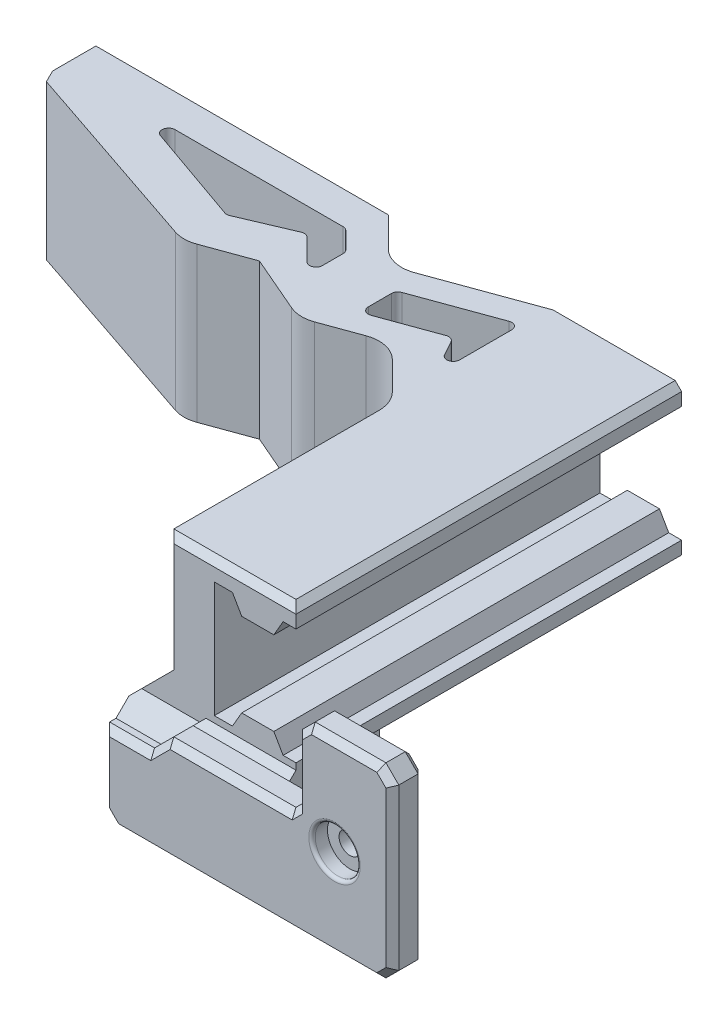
ISO-10303-21;
HEADER;
FILE_DESCRIPTION(('STEP AP214'),'2;1');
FILE_NAME('part.step','',(''),(''),'','','');
FILE_SCHEMA(('AUTOMOTIVE_DESIGN { 1 0 10303 214 1 1 1 1 }'));
ENDSEC;
DATA;
#1=APPLICATION_CONTEXT('core data for automotive mechanical design processes');
#2=APPLICATION_PROTOCOL_DEFINITION('international standard','automotive_design',2000,#1);
#3=PRODUCT_CONTEXT('',#1,'mechanical');
#4=PRODUCT('Part','Part','',(#3));
#5=PRODUCT_RELATED_PRODUCT_CATEGORY('part','',(#4));
#6=PRODUCT_DEFINITION_FORMATION('','',#4);
#7=PRODUCT_DEFINITION_CONTEXT('part definition',#1,'design');
#8=PRODUCT_DEFINITION('design','',#6,#7);
#9=PRODUCT_DEFINITION_SHAPE('','',#8);
#10=(LENGTH_UNIT() NAMED_UNIT(*) SI_UNIT(.MILLI.,.METRE.));
#11=(NAMED_UNIT(*) PLANE_ANGLE_UNIT() SI_UNIT($,.RADIAN.));
#12=(NAMED_UNIT(*) SI_UNIT($,.STERADIAN.) SOLID_ANGLE_UNIT());
#13=UNCERTAINTY_MEASURE_WITH_UNIT(LENGTH_MEASURE(1.E-05),#10,'distance_accuracy_value','');
#14=(GEOMETRIC_REPRESENTATION_CONTEXT(3) GLOBAL_UNCERTAINTY_ASSIGNED_CONTEXT((#13)) GLOBAL_UNIT_ASSIGNED_CONTEXT((#10,
#11,#12)) REPRESENTATION_CONTEXT('',''));
#15=CARTESIAN_POINT('',(0.,0.,0.));
#16=DIRECTION('',(0.,0.,1.));
#17=DIRECTION('',(1.,0.,0.));
#18=AXIS2_PLACEMENT_3D('',#15,#16,#17);
#19=CARTESIAN_POINT('',(0.,-11.0091180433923,0.));
#20=DIRECTION('',(0.,1.,0.));
#21=DIRECTION('',(0.,0.,1.));
#22=AXIS2_PLACEMENT_3D('',#19,#20,#21);
#23=PLANE('',#22);
#24=DIRECTION('',(0.,0.,-1.));
#25=VECTOR('',#24,1.);
#26=CARTESIAN_POINT('',(15.0942575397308,-11.0091180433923,0.));
#27=LINE('',#26,#25);
#28=CARTESIAN_POINT('',(15.0942575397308,-11.0091180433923,64.));
#29=VERTEX_POINT('',#28);
#30=CARTESIAN_POINT('',(15.0942575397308,-11.0091180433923,61.));
#31=VERTEX_POINT('',#30);
#32=EDGE_CURVE('E998',#29,#31,#27,.T.);
#33=ORIENTED_EDGE('',*,*,#32,.T.);
#34=DIRECTION('',(-1.,0.,0.));
#35=VECTOR('',#34,1.);
#36=CARTESIAN_POINT('',(0.,-11.0091180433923,61.));
#37=LINE('',#36,#35);
#38=CARTESIAN_POINT('',(11.0942575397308,-11.0091180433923,61.));
#39=VERTEX_POINT('',#38);
#40=EDGE_CURVE('E1060',#31,#39,#37,.T.);
#41=ORIENTED_EDGE('',*,*,#40,.T.);
#42=DIRECTION('',(-1.,0.,0.));
#43=VECTOR('',#42,1.);
#44=CARTESIAN_POINT('',(0.,-11.0091180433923,61.));
#45=LINE('',#44,#43);
#46=CARTESIAN_POINT('',(-3.90472001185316,-11.0091180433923,61.));
#47=VERTEX_POINT('',#46);
#48=EDGE_CURVE('E1031',#39,#47,#45,.T.);
#49=ORIENTED_EDGE('',*,*,#48,.T.);
#50=DIRECTION('',(0.,0.,1.));
#51=VECTOR('',#50,1.);
#52=CARTESIAN_POINT('',(-3.90472001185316,-11.0091180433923,65.));
#53=LINE('',#52,#51);
#54=CARTESIAN_POINT('',(-3.90472001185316,-11.0091180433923,64.));
#55=VERTEX_POINT('',#54);
#56=EDGE_CURVE('E810',#47,#55,#53,.T.);
#57=ORIENTED_EDGE('',*,*,#56,.T.);
#58=DIRECTION('',(1.,0.,0.));
#59=VECTOR('',#58,1.);
#60=CARTESIAN_POINT('',(15.0942575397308,-11.0091180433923,64.));
#61=LINE('',#60,#59);
#62=EDGE_CURVE('E2006',#55,#29,#61,.T.);
#63=ORIENTED_EDGE('',*,*,#62,.T.);
#64=EDGE_LOOP('',(#33,#41,#49,#57,#63));
#65=FACE_BOUND('',#64,.T.);
#66=ADVANCED_FACE('F37',(#65),#23,.T.);
#67=CARTESIAN_POINT('',(0.,0.,60.));
#68=DIRECTION('',(0.,0.,-1.));
#69=DIRECTION('',(-1.,0.,0.));
#70=AXIS2_PLACEMENT_3D('',#67,#68,#69);
#71=PLANE('',#70);
#72=DIRECTION('',(0.,-1.,0.));
#73=VECTOR('',#72,1.);
#74=CARTESIAN_POINT('',(-7.9057424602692,0.,60.));
#75=LINE('',#74,#73);
#76=CARTESIAN_POINT('',(-7.9057424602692,11.0091180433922,60.));
#77=VERTEX_POINT('',#76);
#78=CARTESIAN_POINT('',(-7.9057424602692,-6.00911804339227,60.));
#79=VERTEX_POINT('',#78);
#80=EDGE_CURVE('E945',#77,#79,#75,.T.);
#81=ORIENTED_EDGE('',*,*,#80,.T.);
#82=DIRECTION('',(0.707106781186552,0.707106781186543,0.));
#83=VECTOR('',#82,1.);
#84=CARTESIAN_POINT('',(-0.948312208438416,0.948312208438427,60.));
#85=LINE('',#84,#83);
#86=CARTESIAN_POINT('',(-12.9057424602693,-11.0091180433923,60.));
#87=VERTEX_POINT('',#86);
#88=EDGE_CURVE('E1315',#79,#87,#85,.F.);
#89=ORIENTED_EDGE('',*,*,#88,.T.);
#90=DIRECTION('',(1.,0.,0.));
#91=VECTOR('',#90,1.);
#92=CARTESIAN_POINT('',(-3.90472001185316,-11.0091180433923,60.));
#93=LINE('',#92,#91);
#94=CARTESIAN_POINT('',(-3.90472001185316,-11.0091180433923,60.));
#95=VERTEX_POINT('',#94);
#96=EDGE_CURVE('E986',#87,#95,#93,.T.);
#97=ORIENTED_EDGE('',*,*,#96,.T.);
#98=DIRECTION('',(-0.707106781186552,-0.707106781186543,0.));
#99=VECTOR('',#98,1.);
#100=CARTESIAN_POINT('',(-3.90472001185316,-11.0091180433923,60.));
#101=LINE('',#100,#99);
#102=CARTESIAN_POINT('',(-2.90472001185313,-10.0091180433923,60.));
#103=VERTEX_POINT('',#102);
#104=EDGE_CURVE('E1036',#95,#103,#101,.F.);
#105=ORIENTED_EDGE('',*,*,#104,.T.);
#106=DIRECTION('',(1.,0.,0.));
#107=VECTOR('',#106,1.);
#108=CARTESIAN_POINT('',(0.,-10.0091180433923,60.));
#109=LINE('',#108,#107);
#110=CARTESIAN_POINT('',(11.0942575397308,-10.0091180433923,60.));
#111=VERTEX_POINT('',#110);
#112=EDGE_CURVE('E1034',#103,#111,#109,.T.);
#113=ORIENTED_EDGE('',*,*,#112,.T.);
#114=DIRECTION('',(0.,1.,0.));
#115=VECTOR('',#114,1.);
#116=CARTESIAN_POINT('',(11.0942575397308,-9.00911804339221,60.));
#117=LINE('',#116,#115);
#118=CARTESIAN_POINT('',(11.0942575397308,-9.00911804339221,60.));
#119=VERTEX_POINT('',#118);
#120=EDGE_CURVE('E842',#111,#119,#117,.T.);
#121=ORIENTED_EDGE('',*,*,#120,.T.);
#122=DIRECTION('',(-1.,0.,0.));
#123=VECTOR('',#122,1.);
#124=CARTESIAN_POINT('',(11.0942575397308,-9.00911804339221,60.));
#125=LINE('',#124,#123);
#126=CARTESIAN_POINT('',(9.09425753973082,-9.00911804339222,60.));
#127=VERTEX_POINT('',#126);
#128=EDGE_CURVE('E846',#119,#127,#125,.T.);
#129=ORIENTED_EDGE('',*,*,#128,.T.);
#130=DIRECTION('',(-0.500000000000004,0.866025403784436,0.));
#131=VECTOR('',#130,1.);
#132=CARTESIAN_POINT('',(9.09425753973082,-9.00911804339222,60.));
#133=LINE('',#132,#131);
#134=CARTESIAN_POINT('',(7.65088186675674,-6.50911804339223,60.));
#135=VERTEX_POINT('',#134);
#136=EDGE_CURVE('E848',#127,#135,#133,.T.);
#137=ORIENTED_EDGE('',*,*,#136,.T.);
#138=DIRECTION('',(-1.,0.,0.));
#139=VECTOR('',#138,1.);
#140=CARTESIAN_POINT('',(7.65088186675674,-6.50911804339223,60.));
#141=LINE('',#140,#139);
#142=CARTESIAN_POINT('',(2.65088186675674,-6.50911804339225,60.));
#143=VERTEX_POINT('',#142);
#144=EDGE_CURVE('E850',#135,#143,#141,.T.);
#145=ORIENTED_EDGE('',*,*,#144,.T.);
#146=DIRECTION('',(-0.499999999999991,-0.866025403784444,0.));
#147=VECTOR('',#146,1.);
#148=CARTESIAN_POINT('',(2.65088186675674,-6.50911804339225,60.));
#149=LINE('',#148,#147);
#150=CARTESIAN_POINT('',(1.20750619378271,-9.00911804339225,60.));
#151=VERTEX_POINT('',#150);
#152=EDGE_CURVE('E821',#143,#151,#149,.T.);
#153=ORIENTED_EDGE('',*,*,#152,.T.);
#154=DIRECTION('',(-1.,0.,0.));
#155=VECTOR('',#154,1.);
#156=CARTESIAN_POINT('',(1.20750619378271,-9.00911804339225,60.));
#157=LINE('',#156,#155);
#158=CARTESIAN_POINT('',(-1.6106949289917,-9.00911804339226,60.));
#159=VERTEX_POINT('',#158);
#160=EDGE_CURVE('E824',#151,#159,#157,.T.);
#161=ORIENTED_EDGE('',*,*,#160,.T.);
#162=DIRECTION('',(0.,1.,0.));
#163=VECTOR('',#162,1.);
#164=CARTESIAN_POINT('',(-1.6106949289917,-9.00911804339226,60.));
#165=LINE('',#164,#163);
#166=CARTESIAN_POINT('',(-1.61069492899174,9.00911804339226,60.));
#167=VERTEX_POINT('',#166);
#168=EDGE_CURVE('E827',#159,#167,#165,.T.);
#169=ORIENTED_EDGE('',*,*,#168,.T.);
#170=DIRECTION('',(1.,0.,0.));
#171=VECTOR('',#170,1.);
#172=CARTESIAN_POINT('',(1.20750619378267,9.00911804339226,60.));
#173=LINE('',#172,#171);
#174=CARTESIAN_POINT('',(1.20750619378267,9.00911804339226,60.));
#175=VERTEX_POINT('',#174);
#176=EDGE_CURVE('E829',#167,#175,#173,.T.);
#177=ORIENTED_EDGE('',*,*,#176,.T.);
#178=DIRECTION('',(0.499999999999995,-0.866025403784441,0.));
#179=VECTOR('',#178,1.);
#180=CARTESIAN_POINT('',(2.65088186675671,6.50911804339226,60.));
#181=LINE('',#180,#179);
#182=CARTESIAN_POINT('',(2.65088186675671,6.50911804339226,60.));
#183=VERTEX_POINT('',#182);
#184=EDGE_CURVE('E831',#175,#183,#181,.T.);
#185=ORIENTED_EDGE('',*,*,#184,.T.);
#186=DIRECTION('',(1.,0.,0.));
#187=VECTOR('',#186,1.);
#188=CARTESIAN_POINT('',(7.65088186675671,6.50911804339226,60.));
#189=LINE('',#188,#187);
#190=CARTESIAN_POINT('',(7.65088186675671,6.50911804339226,60.));
#191=VERTEX_POINT('',#190);
#192=EDGE_CURVE('E833',#183,#191,#189,.T.);
#193=ORIENTED_EDGE('',*,*,#192,.T.);
#194=DIRECTION('',(0.500000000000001,0.866025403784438,0.));
#195=VECTOR('',#194,1.);
#196=CARTESIAN_POINT('',(9.09425753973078,9.00911804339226,60.));
#197=LINE('',#196,#195);
#198=CARTESIAN_POINT('',(9.09425753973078,9.00911804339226,60.));
#199=VERTEX_POINT('',#198);
#200=EDGE_CURVE('E835',#191,#199,#197,.T.);
#201=ORIENTED_EDGE('',*,*,#200,.T.);
#202=DIRECTION('',(1.,0.,0.));
#203=VECTOR('',#202,1.);
#204=CARTESIAN_POINT('',(11.0942575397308,9.00911804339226,60.));
#205=LINE('',#204,#203);
#206=CARTESIAN_POINT('',(11.0942575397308,9.00911804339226,60.));
#207=VERTEX_POINT('',#206);
#208=EDGE_CURVE('E837',#199,#207,#205,.T.);
#209=ORIENTED_EDGE('',*,*,#208,.T.);
#210=DIRECTION('',(0.,1.,0.));
#211=VECTOR('',#210,1.);
#212=CARTESIAN_POINT('',(11.0942575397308,9.00911804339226,60.));
#213=LINE('',#212,#211);
#214=CARTESIAN_POINT('',(11.0942575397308,11.0091180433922,60.));
#215=VERTEX_POINT('',#214);
#216=EDGE_CURVE('E839',#207,#215,#213,.T.);
#217=ORIENTED_EDGE('',*,*,#216,.T.);
#218=DIRECTION('',(-1.,0.,0.));
#219=VECTOR('',#218,1.);
#220=CARTESIAN_POINT('',(0.,11.0091180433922,60.));
#221=LINE('',#220,#219);
#222=EDGE_CURVE('E943',#215,#77,#221,.T.);
#223=ORIENTED_EDGE('',*,*,#222,.T.);
#224=EDGE_LOOP('',(#81,#89,#97,#105,#113,#121,#129,#137,#145,#153,#161,#169,#177,#185,#193,#201,
#209,#217,#223));
#225=FACE_BOUND('',#224,.T.);
#226=ADVANCED_FACE('F1401',(#225),#71,.F.);
#227=CARTESIAN_POINT('',(-13.9057424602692,-14.0091180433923,65.));
#228=DIRECTION('',(0.,-1.,0.));
#229=DIRECTION('',(0.,0.,-1.));
#230=AXIS2_PLACEMENT_3D('',#227,#228,#229);
#231=PLANE('',#230);
#232=DIRECTION('',(0.,0.,-1.));
#233=VECTOR('',#232,1.);
#234=CARTESIAN_POINT('',(-13.9057424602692,-14.0091180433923,65.));
#235=LINE('',#234,#233);
#236=CARTESIAN_POINT('',(-13.9057424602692,-14.0091180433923,64.));
#237=VERTEX_POINT('',#236);
#238=CARTESIAN_POINT('',(-13.9057424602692,-14.0091180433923,63.));
#239=VERTEX_POINT('',#238);
#240=EDGE_CURVE('E813',#237,#239,#235,.T.);
#241=ORIENTED_EDGE('',*,*,#240,.F.);
#242=DIRECTION('',(1.,0.,0.));
#243=VECTOR('',#242,1.);
#244=CARTESIAN_POINT('',(-13.9057424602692,-14.0091180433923,64.));
#245=LINE('',#244,#243);
#246=CARTESIAN_POINT('',(-6.90472001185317,-14.0091180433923,64.));
#247=VERTEX_POINT('',#246);
#248=EDGE_CURVE('E1999',#237,#247,#245,.T.);
#249=ORIENTED_EDGE('',*,*,#248,.T.);
#250=DIRECTION('',(0.,0.,-1.));
#251=VECTOR('',#250,1.);
#252=CARTESIAN_POINT('',(-6.90472001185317,-14.0091180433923,60.));
#253=LINE('',#252,#251);
#254=CARTESIAN_POINT('',(-6.90472001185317,-14.0091180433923,63.));
#255=VERTEX_POINT('',#254);
#256=EDGE_CURVE('E984',#247,#255,#253,.T.);
#257=ORIENTED_EDGE('',*,*,#256,.T.);
#258=DIRECTION('',(-1.,0.,0.));
#259=VECTOR('',#258,1.);
#260=CARTESIAN_POINT('',(-13.9057424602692,-14.0091180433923,63.));
#261=LINE('',#260,#259);
#262=EDGE_CURVE('E981',#255,#239,#261,.T.);
#263=ORIENTED_EDGE('',*,*,#262,.T.);
#264=EDGE_LOOP('',(#241,#249,#257,#263));
#265=FACE_BOUND('',#264,.T.);
#266=ADVANCED_FACE('F1406',(#265),#231,.F.);
#267=CARTESIAN_POINT('',(-8.90574246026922,12.0091180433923,60.));
#268=DIRECTION('',(1.,0.,0.));
#269=DIRECTION('',(0.,1.,0.));
#270=AXIS2_PLACEMENT_3D('',#267,#268,#269);
#271=PLANE('',#270);
#272=DIRECTION('',(0.,0.,-1.));
#273=VECTOR('',#272,1.);
#274=CARTESIAN_POINT('',(-8.90574246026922,12.0091180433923,60.));
#275=LINE('',#274,#273);
#276=CARTESIAN_POINT('',(-8.90574246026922,12.0091180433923,59.));
#277=VERTEX_POINT('',#276);
#278=CARTESIAN_POINT('',(-8.90574246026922,12.0091180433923,27.0710678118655));
#279=VERTEX_POINT('',#278);
#280=EDGE_CURVE('E901',#277,#279,#275,.T.);
#281=ORIENTED_EDGE('',*,*,#280,.T.);
#282=DIRECTION('',(0.,-1.,0.));
#283=VECTOR('',#282,1.);
#284=CARTESIAN_POINT('',(-8.90574246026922,-12.0091180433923,27.0710678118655));
#285=LINE('',#284,#283);
#286=CARTESIAN_POINT('',(-8.90574246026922,-12.0091180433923,27.0710678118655));
#287=VERTEX_POINT('',#286);
#288=EDGE_CURVE('E1211',#279,#287,#285,.T.);
#289=ORIENTED_EDGE('',*,*,#288,.T.);
#290=DIRECTION('',(0.,0.,-1.));
#291=VECTOR('',#290,1.);
#292=CARTESIAN_POINT('',(-8.90574246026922,-12.0091180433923,60.));
#293=LINE('',#292,#291);
#294=CARTESIAN_POINT('',(-8.90574246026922,-12.0091180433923,34.));
#295=VERTEX_POINT('',#294);
#296=EDGE_CURVE('E898',#295,#287,#293,.T.);
#297=ORIENTED_EDGE('',*,*,#296,.F.);
#298=DIRECTION('',(0.,1.,0.));
#299=VECTOR('',#298,1.);
#300=CARTESIAN_POINT('',(-8.90574246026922,-7.00911804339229,34.));
#301=LINE('',#300,#299);
#302=CARTESIAN_POINT('',(-8.90574246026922,-7.00911804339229,34.));
#303=VERTEX_POINT('',#302);
#304=EDGE_CURVE('E909',#295,#303,#301,.T.);
#305=ORIENTED_EDGE('',*,*,#304,.T.);
#306=DIRECTION('',(0.,0.,1.));
#307=VECTOR('',#306,1.);
#308=CARTESIAN_POINT('',(-8.90574246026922,-7.00911804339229,60.));
#309=LINE('',#308,#307);
#310=CARTESIAN_POINT('',(-8.90574246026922,-7.00911804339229,59.));
#311=VERTEX_POINT('',#310);
#312=EDGE_CURVE('E1320',#303,#311,#309,.T.);
#313=ORIENTED_EDGE('',*,*,#312,.T.);
#314=DIRECTION('',(0.,1.,0.));
#315=VECTOR('',#314,1.);
#316=CARTESIAN_POINT('',(-8.90574246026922,12.0091180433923,59.));
#317=LINE('',#316,#315);
#318=EDGE_CURVE('E948',#311,#277,#317,.T.);
#319=ORIENTED_EDGE('',*,*,#318,.T.);
#320=EDGE_LOOP('',(#281,#289,#297,#305,#313,#319));
#321=FACE_BOUND('',#320,.T.);
#322=ADVANCED_FACE('F1355',(#321),#271,.F.);
#323=CARTESIAN_POINT('',(-8.90574246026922,-12.0091180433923,60.));
#324=DIRECTION('',(0.,1.,0.));
#325=DIRECTION('',(0.,0.,1.));
#326=AXIS2_PLACEMENT_3D('',#323,#324,#325);
#327=PLANE('',#326);
#328=DIRECTION('',(0.939692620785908,0.,-0.34202014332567));
#329=VECTOR('',#328,1.);
#330=CARTESIAN_POINT('',(-24.9765396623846,-12.0091180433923,15.8458475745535));
#331=LINE('',#330,#329);
#332=CARTESIAN_POINT('',(-22.3575747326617,-12.0091180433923,14.8926222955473));
#333=VERTEX_POINT('',#332);
#334=CARTESIAN_POINT('',(-13.7746568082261,-12.0091180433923,11.7686956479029));
#335=VERTEX_POINT('',#334);
#336=EDGE_CURVE('E774',#333,#335,#331,.T.);
#337=ORIENTED_EDGE('',*,*,#336,.T.);
#338=CARTESIAN_POINT('',(-13.4326366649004,-12.0091180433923,12.7083882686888));
#339=DIRECTION('',(0.,1.,0.));
#340=DIRECTION('',(0.,0.,1.));
#341=AXIS2_PLACEMENT_3D('',#338,#339,#340);
#342=CIRCLE('',#341,1.);
#343=CARTESIAN_POINT('',(-12.5570358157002,-12.0091180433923,12.2253529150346));
#344=VERTEX_POINT('',#343);
#345=EDGE_CURVE('E1129',#335,#344,#342,.F.);
#346=ORIENTED_EDGE('',*,*,#345,.T.);
#347=DIRECTION('',(0.483035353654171,0.,0.875600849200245));
#348=VECTOR('',#347,1.);
#349=CARTESIAN_POINT('',(8.50099927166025,-12.0091180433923,50.397369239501));
#350=LINE('',#349,#348);
#351=CARTESIAN_POINT('',(-11.3171846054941,-12.0091180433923,14.4728380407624));
#352=VERTEX_POINT('',#351);
#353=EDGE_CURVE('E777',#344,#352,#350,.T.);
#354=ORIENTED_EDGE('',*,*,#353,.T.);
#355=CARTESIAN_POINT('',(-10.4415837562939,-12.0091180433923,13.9898026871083));
#356=DIRECTION('',(0.,1.,0.));
#357=DIRECTION('',(0.,0.,1.));
#358=AXIS2_PLACEMENT_3D('',#355,#356,#357);
#359=CIRCLE('',#358,1.);
#360=CARTESIAN_POINT('',(-9.44158375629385,-12.0091180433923,13.9898026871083));
#361=VERTEX_POINT('',#360);
#362=EDGE_CURVE('E1146',#352,#361,#359,.T.);
#363=ORIENTED_EDGE('',*,*,#362,.T.);
#364=DIRECTION('',(0.,0.,-1.));
#365=VECTOR('',#364,1.);
#366=CARTESIAN_POINT('',(-9.44158375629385,-12.0091180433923,60.));
#367=LINE('',#366,#365);
#368=CARTESIAN_POINT('',(-9.44158375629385,-12.0091180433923,5.87988937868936));
#369=VERTEX_POINT('',#368);
#370=EDGE_CURVE('E780',#361,#369,#367,.T.);
#371=ORIENTED_EDGE('',*,*,#370,.T.);
#372=CARTESIAN_POINT('',(-10.4415837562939,-12.0091180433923,5.87988937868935));
#373=DIRECTION('',(0.,1.,0.));
#374=DIRECTION('',(0.,0.,1.));
#375=AXIS2_PLACEMENT_3D('',#372,#373,#374);
#376=CIRCLE('',#375,1.);
#377=CARTESIAN_POINT('',(-10.7836038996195,-12.0091180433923,4.94019675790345));
#378=VERTEX_POINT('',#377);
#379=EDGE_CURVE('E1150',#369,#378,#376,.T.);
#380=ORIENTED_EDGE('',*,*,#379,.T.);
#381=DIRECTION('',(-0.939692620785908,0.,0.34202014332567));
#382=VECTOR('',#381,1.);
#383=CARTESIAN_POINT('',(-26.8212901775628,-12.0091180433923,10.7774371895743));
#384=LINE('',#383,#382);
#385=CARTESIAN_POINT('',(-23.0416150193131,-12.0091180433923,9.40174793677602));
#386=VERTEX_POINT('',#385);
#387=EDGE_CURVE('E783',#378,#386,#384,.T.);
#388=ORIENTED_EDGE('',*,*,#387,.T.);
#389=CARTESIAN_POINT('',(-22.6995948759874,-12.0091180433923,10.3414405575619));
#390=DIRECTION('',(0.,1.,0.));
#391=DIRECTION('',(0.,0.,1.));
#392=AXIS2_PLACEMENT_3D('',#389,#390,#391);
#393=CIRCLE('',#392,1.);
#394=CARTESIAN_POINT('',(-23.6995948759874,-12.0091180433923,10.3414405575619));
#395=VERTEX_POINT('',#394);
#396=EDGE_CURVE('E1142',#386,#395,#393,.T.);
#397=ORIENTED_EDGE('',*,*,#396,.T.);
#398=DIRECTION('',(0.,0.,1.));
#399=VECTOR('',#398,1.);
#400=CARTESIAN_POINT('',(-23.6995948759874,-12.0091180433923,60.));
#401=LINE('',#400,#399);
#402=CARTESIAN_POINT('',(-23.6995948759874,-12.0091180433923,13.9529296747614));
#403=VERTEX_POINT('',#402);
#404=EDGE_CURVE('E786',#395,#403,#401,.T.);
#405=ORIENTED_EDGE('',*,*,#404,.T.);
#406=CARTESIAN_POINT('',(-22.6995948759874,-12.0091180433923,13.9529296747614));
#407=DIRECTION('',(0.,1.,0.));
#408=DIRECTION('',(0.,0.,1.));
#409=AXIS2_PLACEMENT_3D('',#406,#407,#408);
#410=CIRCLE('',#409,1.);
#411=EDGE_CURVE('E1138',#403,#333,#410,.T.);
#412=ORIENTED_EDGE('',*,*,#411,.T.);
#413=EDGE_LOOP('',(#337,#346,#354,#363,#371,#380,#388,#397,#405,#412));
#414=FACE_BOUND('',#413,.T.);
#415=DIRECTION('',(-0.947438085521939,0.,-0.319939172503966));
#416=VECTOR('',#415,1.);
#417=CARTESIAN_POINT('',(-10.7169185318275,-12.0091180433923,31.7360850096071));
#418=LINE('',#417,#416);
#419=CARTESIAN_POINT('',(-48.798711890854,-12.0091180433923,18.8762922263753));
#420=VERTEX_POINT('',#419);
#421=CARTESIAN_POINT('',(-79.0887894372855,-12.0091180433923,8.64767413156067));
#422=VERTEX_POINT('',#421);
#423=EDGE_CURVE('E752',#420,#422,#418,.T.);
#424=ORIENTED_EDGE('',*,*,#423,.T.);
#425=DIRECTION('',(0.443708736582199,0.,0.896171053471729));
#426=VECTOR('',#425,1.);
#427=CARTESIAN_POINT('',(-80.0362275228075,-12.0091180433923,6.73410670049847));
#428=LINE('',#427,#426);
#429=CARTESIAN_POINT('',(-80.0362275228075,-12.0091180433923,6.73410670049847));
#430=VERTEX_POINT('',#429);
#431=EDGE_CURVE('E11',#422,#430,#428,.F.);
#432=ORIENTED_EDGE('',*,*,#431,.T.);
#433=DIRECTION('',(0.,0.,-1.));
#434=VECTOR('',#433,1.);
#435=CARTESIAN_POINT('',(-80.0362275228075,-12.0091180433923,0.));
#436=LINE('',#435,#434);
#437=CARTESIAN_POINT('',(-80.0362275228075,-12.0091180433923,0.));
#438=VERTEX_POINT('',#437);
#439=EDGE_CURVE('E754',#430,#438,#436,.T.);
#440=ORIENTED_EDGE('',*,*,#439,.T.);
#441=DIRECTION('',(1.,0.,0.));
#442=VECTOR('',#441,1.);
#443=CARTESIAN_POINT('',(0.,-12.0091180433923,0.));
#444=LINE('',#443,#442);
#445=CARTESIAN_POINT('',(-34.5399977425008,-12.0091180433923,0.));
#446=VERTEX_POINT('',#445);
#447=EDGE_CURVE('E756',#438,#446,#444,.T.);
#448=ORIENTED_EDGE('',*,*,#447,.T.);
#449=DIRECTION('',(0.707106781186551,0.,0.707106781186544));
#450=VECTOR('',#449,1.);
#451=CARTESIAN_POINT('',(-17.2699988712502,-12.0091180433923,17.2699988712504));
#452=LINE('',#451,#450);
#453=CARTESIAN_POINT('',(-29.9519783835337,-12.0091180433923,4.5880193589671));
#454=VERTEX_POINT('',#453);
#455=EDGE_CURVE('E730',#446,#454,#452,.T.);
#456=ORIENTED_EDGE('',*,*,#455,.T.);
#457=CARTESIAN_POINT('',(-26.416444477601,-12.0091180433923,1.05248545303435));
#458=DIRECTION('',(0.,1.,0.));
#459=DIRECTION('',(0.,0.,1.));
#460=AXIS2_PLACEMENT_3D('',#457,#458,#459);
#461=CIRCLE('',#460,5.);
#462=CARTESIAN_POINT('',(-24.7063437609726,-12.0091180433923,5.75094855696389));
#463=VERTEX_POINT('',#462);
#464=EDGE_CURVE('E1241',#454,#463,#461,.T.);
#465=ORIENTED_EDGE('',*,*,#464,.T.);
#466=DIRECTION('',(0.939692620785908,0.,-0.342020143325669));
#467=VECTOR('',#466,1.);
#468=CARTESIAN_POINT('',(-8.90574246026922,-12.0091180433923,0.));
#469=LINE('',#468,#467);
#470=CARTESIAN_POINT('',(-8.90574246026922,-12.0091180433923,0.));
#471=VERTEX_POINT('',#470);
#472=EDGE_CURVE('E793',#463,#471,#469,.T.);
#473=ORIENTED_EDGE('',*,*,#472,.T.);
#474=DIRECTION('',(1.,0.,0.));
#475=VECTOR('',#474,1.);
#476=CARTESIAN_POINT('',(-8.90574246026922,-12.0091180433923,0.));
#477=LINE('',#476,#475);
#478=CARTESIAN_POINT('',(10.0942575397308,-12.0091180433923,0.));
#479=VERTEX_POINT('',#478);
#480=EDGE_CURVE('E877',#471,#479,#477,.T.);
#481=ORIENTED_EDGE('',*,*,#480,.T.);
#482=DIRECTION('',(0.,0.,1.));
#483=VECTOR('',#482,1.);
#484=CARTESIAN_POINT('',(10.0942575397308,-12.0091180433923,60.));
#485=LINE('',#484,#483);
#486=CARTESIAN_POINT('',(10.0942575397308,-12.0091180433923,57.));
#487=VERTEX_POINT('',#486);
#488=EDGE_CURVE('E934',#479,#487,#485,.T.);
#489=ORIENTED_EDGE('',*,*,#488,.T.);
#490=DIRECTION('',(-1.,0.,0.));
#491=VECTOR('',#490,1.);
#492=CARTESIAN_POINT('',(-8.90574246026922,-12.0091180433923,57.));
#493=LINE('',#492,#491);
#494=CARTESIAN_POINT('',(4.09425753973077,-12.0091180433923,57.));
#495=VERTEX_POINT('',#494);
#496=EDGE_CURVE('E1024',#487,#495,#493,.T.);
#497=ORIENTED_EDGE('',*,*,#496,.T.);
#498=DIRECTION('',(0.,0.,-1.));
#499=VECTOR('',#498,1.);
#500=CARTESIAN_POINT('',(4.09425753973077,-12.0091180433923,35.));
#501=LINE('',#500,#499);
#502=CARTESIAN_POINT('',(4.09425753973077,-12.0091180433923,34.));
#503=VERTEX_POINT('',#502);
#504=EDGE_CURVE('E1308',#495,#503,#501,.T.);
#505=ORIENTED_EDGE('',*,*,#504,.T.);
#506=DIRECTION('',(-1.,0.,0.));
#507=VECTOR('',#506,1.);
#508=CARTESIAN_POINT('',(-8.90574246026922,-12.0091180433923,34.));
#509=LINE('',#508,#507);
#510=EDGE_CURVE('E916',#503,#295,#509,.T.);
#511=ORIENTED_EDGE('',*,*,#510,.T.);
#512=ORIENTED_EDGE('',*,*,#296,.T.);
#513=CARTESIAN_POINT('',(-13.9057424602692,-12.0091180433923,27.0710678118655));
#514=DIRECTION('',(0.,1.,0.));
#515=DIRECTION('',(0.,0.,1.));
#516=AXIS2_PLACEMENT_3D('',#513,#514,#515);
#517=CIRCLE('',#516,5.);
#518=CARTESIAN_POINT('',(-10.3702085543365,-12.0091180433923,23.5355339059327));
#519=VERTEX_POINT('',#518);
#520=EDGE_CURVE('E1243',#287,#519,#517,.T.);
#521=ORIENTED_EDGE('',*,*,#520,.T.);
#522=DIRECTION('',(-0.707106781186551,0.,-0.707106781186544));
#523=VECTOR('',#522,1.);
#524=CARTESIAN_POINT('',(8.5942575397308,-12.0091180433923,42.4999999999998));
#525=LINE('',#524,#523);
#526=CARTESIAN_POINT('',(-14.7180510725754,-12.0091180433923,19.1876913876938));
#527=VERTEX_POINT('',#526);
#528=EDGE_CURVE('E1104',#519,#527,#525,.T.);
#529=ORIENTED_EDGE('',*,*,#528,.T.);
#530=CARTESIAN_POINT('',(-18.2535849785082,-12.0091180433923,22.7232252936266));
#531=DIRECTION('',(0.,1.,0.));
#532=DIRECTION('',(0.,0.,1.));
#533=AXIS2_PLACEMENT_3D('',#530,#531,#532);
#534=CIRCLE('',#533,5.);
#535=CARTESIAN_POINT('',(-19.9636856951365,-12.0091180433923,18.024762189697));
#536=VERTEX_POINT('',#535);
#537=EDGE_CURVE('E1249',#527,#536,#534,.T.);
#538=ORIENTED_EDGE('',*,*,#537,.T.);
#539=DIRECTION('',(-0.939692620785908,0.,0.34202014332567));
#540=VECTOR('',#539,1.);
#541=CARTESIAN_POINT('',(-8.90574246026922,-12.0091180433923,14.));
#542=LINE('',#541,#540);
#543=CARTESIAN_POINT('',(-25.8317062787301,-12.0091180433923,20.1605470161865));
#544=VERTEX_POINT('',#543);
#545=EDGE_CURVE('E790',#536,#544,#542,.T.);
#546=ORIENTED_EDGE('',*,*,#545,.T.);
#547=CARTESIAN_POINT('',(-27.5418069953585,-12.0091180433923,15.462083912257));
#548=DIRECTION('',(0.,1.,0.));
#549=DIRECTION('',(0.,0.,1.));
#550=AXIS2_PLACEMENT_3D('',#547,#548,#549);
#551=CIRCLE('',#550,5.);
#552=CARTESIAN_POINT('',(-29.5244142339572,-12.0091180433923,20.0522112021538));
#553=VERTEX_POINT('',#552);
#554=EDGE_CURVE('E1232',#544,#553,#551,.F.);
#555=ORIENTED_EDGE('',*,*,#554,.T.);
#556=DIRECTION('',(-0.918025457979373,0.,-0.396521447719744));
#557=VECTOR('',#556,1.);
#558=CARTESIAN_POINT('',(-11.9414431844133,-12.0091180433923,27.6467992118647));
#559=LINE('',#558,#557);
#560=CARTESIAN_POINT('',(-38.351226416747,-12.0091180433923,16.2396586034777));
#561=VERTEX_POINT('',#560);
#562=EDGE_CURVE('E727',#553,#561,#559,.T.);
#563=ORIENTED_EDGE('',*,*,#562,.T.);
#564=DIRECTION('',(-0.939692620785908,0.,0.34202014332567));
#565=VECTOR('',#564,1.);
#566=CARTESIAN_POINT('',(0.733084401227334,-12.0091180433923,2.01413283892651));
#567=LINE('',#566,#565);
#568=CARTESIAN_POINT('',(-45.4889153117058,-12.0091180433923,18.8375649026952));
#569=VERTEX_POINT('',#568);
#570=EDGE_CURVE('E689',#561,#569,#567,.T.);
#571=ORIENTED_EDGE('',*,*,#570,.T.);
#572=CARTESIAN_POINT('',(-47.1990160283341,-12.0091180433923,14.1391017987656));
#573=DIRECTION('',(0.,1.,0.));
#574=DIRECTION('',(0.,0.,1.));
#575=AXIS2_PLACEMENT_3D('',#572,#573,#574);
#576=CIRCLE('',#575,5.);
#577=EDGE_CURVE('E1230',#569,#420,#576,.F.);
#578=ORIENTED_EDGE('',*,*,#577,.T.);
#579=EDGE_LOOP('',(#424,#432,#440,#448,#456,#465,#473,#481,#489,#497,#505,#511,#512,#521,#529,
#538,#546,#555,#563,#571,#578));
#580=FACE_BOUND('',#579,.T.);
#581=DIRECTION('',(-0.92010489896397,0.,0.391672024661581));
#582=VECTOR('',#581,1.);
#583=CARTESIAN_POINT('',(-2.6939744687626,-12.0091180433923,-6.32860901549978));
#584=LINE('',#583,#582);
#585=CARTESIAN_POINT('',(-38.9725295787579,-12.0091180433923,9.11451616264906));
#586=VERTEX_POINT('',#585);
#587=CARTESIAN_POINT('',(-46.780528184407,-12.0091180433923,12.4382400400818));
#588=VERTEX_POINT('',#587);
#589=EDGE_CURVE('E716',#586,#588,#584,.T.);
#590=ORIENTED_EDGE('',*,*,#589,.F.);
#591=CARTESIAN_POINT('',(-38.5808575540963,-12.0091180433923,10.034621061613));
#592=DIRECTION('',(0.,1.,0.));
#593=DIRECTION('',(0.,0.,1.));
#594=AXIS2_PLACEMENT_3D('',#591,#592,#593);
#595=CIRCLE('',#594,1.);
#596=CARTESIAN_POINT('',(-37.8737507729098,-12.0091180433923,9.32751428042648));
#597=VERTEX_POINT('',#596);
#598=EDGE_CURVE('E1184',#586,#597,#595,.F.);
#599=ORIENTED_EDGE('',*,*,#598,.T.);
#600=DIRECTION('',(-0.707106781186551,0.,-0.707106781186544));
#601=VECTOR('',#600,1.);
#602=CARTESIAN_POINT('',(-23.6006325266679,-12.0091180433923,23.6006325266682));
#603=LINE('',#602,#601);
#604=CARTESIAN_POINT('',(-34.5329388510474,-12.0091180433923,12.6683262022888));
#605=VERTEX_POINT('',#604);
#606=EDGE_CURVE('E720',#605,#597,#603,.T.);
#607=ORIENTED_EDGE('',*,*,#606,.F.);
#608=CARTESIAN_POINT('',(-33.8258320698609,-12.0091180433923,11.9612194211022));
#609=DIRECTION('',(0.,1.,0.));
#610=DIRECTION('',(0.,0.,1.));
#611=AXIS2_PLACEMENT_3D('',#608,#609,#610);
#612=CIRCLE('',#611,1.);
#613=CARTESIAN_POINT('',(-32.8258320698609,-12.0091180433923,11.9612194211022));
#614=VERTEX_POINT('',#613);
#615=EDGE_CURVE('E1204',#605,#614,#612,.T.);
#616=ORIENTED_EDGE('',*,*,#615,.T.);
#617=DIRECTION('',(0.,0.,1.));
#618=VECTOR('',#617,1.);
#619=CARTESIAN_POINT('',(-32.8258320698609,-12.0091180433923,0.));
#620=LINE('',#619,#618);
#621=CARTESIAN_POINT('',(-32.8258320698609,-12.0091180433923,8.7419485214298));
#622=VERTEX_POINT('',#621);
#623=EDGE_CURVE('E726',#622,#614,#620,.T.);
#624=ORIENTED_EDGE('',*,*,#623,.F.);
#625=CARTESIAN_POINT('',(-33.8258320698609,-12.0091180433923,8.7419485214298));
#626=DIRECTION('',(0.,1.,0.));
#627=DIRECTION('',(0.,0.,1.));
#628=AXIS2_PLACEMENT_3D('',#625,#626,#627);
#629=CIRCLE('',#628,1.);
#630=CARTESIAN_POINT('',(-33.1187252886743,-12.0091180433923,8.03484174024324));
#631=VERTEX_POINT('',#630);
#632=EDGE_CURVE('E1200',#622,#631,#629,.T.);
#633=ORIENTED_EDGE('',*,*,#632,.T.);
#634=DIRECTION('',(0.707106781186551,0.,0.707106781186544));
#635=VECTOR('',#634,1.);
#636=CARTESIAN_POINT('',(-20.5767835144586,-12.0091180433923,20.5767835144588));
#637=LINE('',#636,#635);
#638=CARTESIAN_POINT('',(-35.750589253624,-12.0091180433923,5.40297777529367));
#639=VERTEX_POINT('',#638);
#640=EDGE_CURVE('E708',#639,#631,#637,.T.);
#641=ORIENTED_EDGE('',*,*,#640,.F.);
#642=CARTESIAN_POINT('',(-36.4576960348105,-12.0091180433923,6.11008455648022));
#643=DIRECTION('',(0.,1.,0.));
#644=DIRECTION('',(0.,0.,1.));
#645=AXIS2_PLACEMENT_3D('',#642,#643,#644);
#646=CIRCLE('',#645,1.);
#647=CARTESIAN_POINT('',(-36.4576960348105,-12.0091180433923,5.11008455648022));
#648=VERTEX_POINT('',#647);
#649=EDGE_CURVE('E1196',#639,#648,#646,.T.);
#650=ORIENTED_EDGE('',*,*,#649,.T.);
#651=DIRECTION('',(1.,0.,0.));
#652=VECTOR('',#651,1.);
#653=CARTESIAN_POINT('',(0.,-12.0091180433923,5.11008455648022));
#654=LINE('',#653,#652);
#655=CARTESIAN_POINT('',(-62.6160546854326,-12.0091180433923,5.11008455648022));
#656=VERTEX_POINT('',#655);
#657=EDGE_CURVE('E707',#656,#648,#654,.T.);
#658=ORIENTED_EDGE('',*,*,#657,.F.);
#659=CARTESIAN_POINT('',(-62.6160546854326,-12.0091180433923,6.11008455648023));
#660=DIRECTION('',(0.,1.,0.));
#661=DIRECTION('',(0.,0.,1.));
#662=AXIS2_PLACEMENT_3D('',#659,#660,#661);
#663=CIRCLE('',#662,1.);
#664=CARTESIAN_POINT('',(-62.9465521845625,-12.0091180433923,7.05389142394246));
#665=VERTEX_POINT('',#664);
#666=EDGE_CURVE('E1192',#656,#665,#663,.T.);
#667=ORIENTED_EDGE('',*,*,#666,.T.);
#668=DIRECTION('',(-0.943806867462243,0.,-0.330497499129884));
#669=VECTOR('',#668,1.);
#670=CARTESIAN_POINT('',(-9.07585436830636,-12.0091180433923,25.9180589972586));
#671=LINE('',#670,#669);
#672=CARTESIAN_POINT('',(-47.5026977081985,-12.0091180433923,12.4619420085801));
#673=VERTEX_POINT('',#672);
#674=EDGE_CURVE('E712',#673,#665,#671,.T.);
#675=ORIENTED_EDGE('',*,*,#674,.F.);
#676=CARTESIAN_POINT('',(-47.1722002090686,-12.0091180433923,11.5181351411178));
#677=DIRECTION('',(0.,1.,0.));
#678=DIRECTION('',(0.,0.,1.));
#679=AXIS2_PLACEMENT_3D('',#676,#677,#678);
#680=CIRCLE('',#679,1.);
#681=EDGE_CURVE('E1188',#673,#588,#680,.T.);
#682=ORIENTED_EDGE('',*,*,#681,.T.);
#683=EDGE_LOOP('',(#590,#599,#607,#616,#624,#633,#641,#650,#658,#667,#675,#682));
#684=FACE_BOUND('',#683,.T.);
#685=ADVANCED_FACE('F1267',(#414,#580,#684),#327,.F.);
#686=CARTESIAN_POINT('',(2.65088186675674,-6.50911804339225,60.));
#687=DIRECTION('',(0.866025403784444,-0.499999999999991,0.));
#688=DIRECTION('',(0.499999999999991,0.866025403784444,0.));
#689=AXIS2_PLACEMENT_3D('',#686,#687,#688);
#690=PLANE('',#689);
#691=DIRECTION('',(-0.499999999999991,-0.866025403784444,0.));
#692=VECTOR('',#691,1.);
#693=CARTESIAN_POINT('',(2.65088186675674,-6.50911804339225,0.));
#694=LINE('',#693,#692);
#695=CARTESIAN_POINT('',(2.65088186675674,-6.50911804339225,0.));
#696=VERTEX_POINT('',#695);
#697=CARTESIAN_POINT('',(1.20750619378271,-9.00911804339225,0.));
#698=VERTEX_POINT('',#697);
#699=EDGE_CURVE('E820',#696,#698,#694,.T.);
#700=ORIENTED_EDGE('',*,*,#699,.T.);
#701=DIRECTION('',(0.,0.,-1.));
#702=VECTOR('',#701,1.);
#703=CARTESIAN_POINT('',(1.20750619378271,-9.00911804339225,60.));
#704=LINE('',#703,#702);
#705=EDGE_CURVE('E1325',#151,#698,#704,.T.);
#706=ORIENTED_EDGE('',*,*,#705,.F.);
#707=ORIENTED_EDGE('',*,*,#152,.F.);
#708=DIRECTION('',(0.,0.,-1.));
#709=VECTOR('',#708,1.);
#710=CARTESIAN_POINT('',(2.65088186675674,-6.50911804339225,60.));
#711=LINE('',#710,#709);
#712=EDGE_CURVE('E852',#143,#696,#711,.T.);
#713=ORIENTED_EDGE('',*,*,#712,.T.);
#714=EDGE_LOOP('',(#700,#706,#707,#713));
#715=FACE_BOUND('',#714,.T.);
#716=ADVANCED_FACE('F1463',(#715),#690,.F.);
#717=CARTESIAN_POINT('',(1.20750619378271,-9.00911804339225,60.));
#718=DIRECTION('',(0.,-1.,0.));
#719=DIRECTION('',(1.,0.,0.));
#720=AXIS2_PLACEMENT_3D('',#717,#718,#719);
#721=PLANE('',#720);
#722=DIRECTION('',(-1.,0.,0.));
#723=VECTOR('',#722,1.);
#724=CARTESIAN_POINT('',(1.20750619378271,-9.00911804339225,0.));
#725=LINE('',#724,#723);
#726=CARTESIAN_POINT('',(-1.6106949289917,-9.00911804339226,0.));
#727=VERTEX_POINT('',#726);
#728=EDGE_CURVE('E855',#698,#727,#725,.T.);
#729=ORIENTED_EDGE('',*,*,#728,.T.);
#730=DIRECTION('',(0.,0.,-1.));
#731=VECTOR('',#730,1.);
#732=CARTESIAN_POINT('',(-1.6106949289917,-9.00911804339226,60.));
#733=LINE('',#732,#731);
#734=EDGE_CURVE('E1328',#159,#727,#733,.T.);
#735=ORIENTED_EDGE('',*,*,#734,.F.);
#736=ORIENTED_EDGE('',*,*,#160,.F.);
#737=ORIENTED_EDGE('',*,*,#705,.T.);
#738=EDGE_LOOP('',(#729,#735,#736,#737));
#739=FACE_BOUND('',#738,.T.);
#740=ADVANCED_FACE('F1496',(#739),#721,.F.);
#741=CARTESIAN_POINT('',(-1.6106949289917,-9.00911804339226,60.));
#742=DIRECTION('',(-1.,0.,0.));
#743=DIRECTION('',(0.,-1.,0.));
#744=AXIS2_PLACEMENT_3D('',#741,#742,#743);
#745=PLANE('',#744);
#746=DIRECTION('',(0.,1.,0.));
#747=VECTOR('',#746,1.);
#748=CARTESIAN_POINT('',(-1.6106949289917,-9.00911804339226,0.));
#749=LINE('',#748,#747);
#750=CARTESIAN_POINT('',(-1.61069492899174,9.00911804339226,0.));
#751=VERTEX_POINT('',#750);
#752=EDGE_CURVE('E857',#727,#751,#749,.T.);
#753=ORIENTED_EDGE('',*,*,#752,.T.);
#754=DIRECTION('',(0.,0.,-1.));
#755=VECTOR('',#754,1.);
#756=CARTESIAN_POINT('',(-1.61069492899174,9.00911804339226,60.));
#757=LINE('',#756,#755);
#758=EDGE_CURVE('E1331',#167,#751,#757,.T.);
#759=ORIENTED_EDGE('',*,*,#758,.F.);
#760=ORIENTED_EDGE('',*,*,#168,.F.);
#761=ORIENTED_EDGE('',*,*,#734,.T.);
#762=EDGE_LOOP('',(#753,#759,#760,#761));
#763=FACE_BOUND('',#762,.T.);
#764=ADVANCED_FACE('F1492',(#763),#745,.F.);
#765=CARTESIAN_POINT('',(1.20750619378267,9.00911804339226,60.));
#766=DIRECTION('',(0.,1.,0.));
#767=DIRECTION('',(0.,0.,1.));
#768=AXIS2_PLACEMENT_3D('',#765,#766,#767);
#769=PLANE('',#768);
#770=DIRECTION('',(1.,0.,0.));
#771=VECTOR('',#770,1.);
#772=CARTESIAN_POINT('',(1.20750619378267,9.00911804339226,0.));
#773=LINE('',#772,#771);
#774=CARTESIAN_POINT('',(1.20750619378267,9.00911804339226,0.));
#775=VERTEX_POINT('',#774);
#776=EDGE_CURVE('E859',#751,#775,#773,.T.);
#777=ORIENTED_EDGE('',*,*,#776,.T.);
#778=DIRECTION('',(0.,0.,-1.));
#779=VECTOR('',#778,1.);
#780=CARTESIAN_POINT('',(1.20750619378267,9.00911804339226,60.));
#781=LINE('',#780,#779);
#782=EDGE_CURVE('E1334',#175,#775,#781,.T.);
#783=ORIENTED_EDGE('',*,*,#782,.F.);
#784=ORIENTED_EDGE('',*,*,#176,.F.);
#785=ORIENTED_EDGE('',*,*,#758,.T.);
#786=EDGE_LOOP('',(#777,#783,#784,#785));
#787=FACE_BOUND('',#786,.T.);
#788=ADVANCED_FACE('F1488',(#787),#769,.F.);
#789=CARTESIAN_POINT('',(2.65088186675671,6.50911804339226,60.));
#790=DIRECTION('',(0.866025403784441,0.499999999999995,0.));
#791=DIRECTION('',(-0.499999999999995,0.866025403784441,0.));
#792=AXIS2_PLACEMENT_3D('',#789,#790,#791);
#793=PLANE('',#792);
#794=DIRECTION('',(0.499999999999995,-0.866025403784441,0.));
#795=VECTOR('',#794,1.);
#796=CARTESIAN_POINT('',(2.65088186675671,6.50911804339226,0.));
#797=LINE('',#796,#795);
#798=CARTESIAN_POINT('',(2.65088186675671,6.50911804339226,0.));
#799=VERTEX_POINT('',#798);
#800=EDGE_CURVE('E861',#775,#799,#797,.T.);
#801=ORIENTED_EDGE('',*,*,#800,.T.);
#802=DIRECTION('',(0.,0.,-1.));
#803=VECTOR('',#802,1.);
#804=CARTESIAN_POINT('',(2.65088186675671,6.50911804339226,60.));
#805=LINE('',#804,#803);
#806=EDGE_CURVE('E1337',#183,#799,#805,.T.);
#807=ORIENTED_EDGE('',*,*,#806,.F.);
#808=ORIENTED_EDGE('',*,*,#184,.F.);
#809=ORIENTED_EDGE('',*,*,#782,.T.);
#810=EDGE_LOOP('',(#801,#807,#808,#809));
#811=FACE_BOUND('',#810,.T.);
#812=ADVANCED_FACE('F1484',(#811),#793,.F.);
#813=CARTESIAN_POINT('',(7.65088186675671,6.50911804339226,60.));
#814=DIRECTION('',(0.,1.,0.));
#815=DIRECTION('',(0.,0.,1.));
#816=AXIS2_PLACEMENT_3D('',#813,#814,#815);
#817=PLANE('',#816);
#818=DIRECTION('',(1.,0.,0.));
#819=VECTOR('',#818,1.);
#820=CARTESIAN_POINT('',(7.65088186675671,6.50911804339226,0.));
#821=LINE('',#820,#819);
#822=CARTESIAN_POINT('',(7.65088186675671,6.50911804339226,0.));
#823=VERTEX_POINT('',#822);
#824=EDGE_CURVE('E863',#799,#823,#821,.T.);
#825=ORIENTED_EDGE('',*,*,#824,.T.);
#826=DIRECTION('',(0.,0.,-1.));
#827=VECTOR('',#826,1.);
#828=CARTESIAN_POINT('',(7.65088186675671,6.50911804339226,60.));
#829=LINE('',#828,#827);
#830=EDGE_CURVE('E1340',#191,#823,#829,.T.);
#831=ORIENTED_EDGE('',*,*,#830,.F.);
#832=ORIENTED_EDGE('',*,*,#192,.F.);
#833=ORIENTED_EDGE('',*,*,#806,.T.);
#834=EDGE_LOOP('',(#825,#831,#832,#833));
#835=FACE_BOUND('',#834,.T.);
#836=ADVANCED_FACE('F1480',(#835),#817,.F.);
#837=CARTESIAN_POINT('',(9.09425753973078,9.00911804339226,60.));
#838=DIRECTION('',(-0.866025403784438,0.500000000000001,0.));
#839=DIRECTION('',(-0.500000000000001,-0.866025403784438,0.));
#840=AXIS2_PLACEMENT_3D('',#837,#838,#839);
#841=PLANE('',#840);
#842=DIRECTION('',(0.500000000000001,0.866025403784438,0.));
#843=VECTOR('',#842,1.);
#844=CARTESIAN_POINT('',(9.09425753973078,9.00911804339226,0.));
#845=LINE('',#844,#843);
#846=CARTESIAN_POINT('',(9.09425753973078,9.00911804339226,0.));
#847=VERTEX_POINT('',#846);
#848=EDGE_CURVE('E865',#823,#847,#845,.T.);
#849=ORIENTED_EDGE('',*,*,#848,.T.);
#850=DIRECTION('',(0.,0.,-1.));
#851=VECTOR('',#850,1.);
#852=CARTESIAN_POINT('',(9.09425753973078,9.00911804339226,60.));
#853=LINE('',#852,#851);
#854=EDGE_CURVE('E1343',#199,#847,#853,.T.);
#855=ORIENTED_EDGE('',*,*,#854,.F.);
#856=ORIENTED_EDGE('',*,*,#200,.F.);
#857=ORIENTED_EDGE('',*,*,#830,.T.);
#858=EDGE_LOOP('',(#849,#855,#856,#857));
#859=FACE_BOUND('',#858,.T.);
#860=ADVANCED_FACE('F1476',(#859),#841,.F.);
#861=CARTESIAN_POINT('',(11.0942575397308,9.00911804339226,60.));
#862=DIRECTION('',(0.,1.,0.));
#863=DIRECTION('',(-1.,0.,0.));
#864=AXIS2_PLACEMENT_3D('',#861,#862,#863);
#865=PLANE('',#864);
#866=DIRECTION('',(1.,0.,0.));
#867=VECTOR('',#866,1.);
#868=CARTESIAN_POINT('',(11.0942575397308,9.00911804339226,0.));
#869=LINE('',#868,#867);
#870=CARTESIAN_POINT('',(11.0942575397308,9.00911804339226,0.));
#871=VERTEX_POINT('',#870);
#872=EDGE_CURVE('E867',#847,#871,#869,.T.);
#873=ORIENTED_EDGE('',*,*,#872,.T.);
#874=DIRECTION('',(0.,0.,-1.));
#875=VECTOR('',#874,1.);
#876=CARTESIAN_POINT('',(11.0942575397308,9.00911804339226,60.));
#877=LINE('',#876,#875);
#878=EDGE_CURVE('E1345',#207,#871,#877,.T.);
#879=ORIENTED_EDGE('',*,*,#878,.F.);
#880=ORIENTED_EDGE('',*,*,#208,.F.);
#881=ORIENTED_EDGE('',*,*,#854,.T.);
#882=EDGE_LOOP('',(#873,#879,#880,#881));
#883=FACE_BOUND('',#882,.T.);
#884=ADVANCED_FACE('F1473',(#883),#865,.F.);
#885=CARTESIAN_POINT('',(11.0942575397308,9.00911804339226,60.));
#886=DIRECTION('',(-1.,0.,0.));
#887=DIRECTION('',(0.,-1.,0.));
#888=AXIS2_PLACEMENT_3D('',#885,#886,#887);
#889=PLANE('',#888);
#890=DIRECTION('',(0.,1.,0.));
#891=VECTOR('',#890,1.);
#892=CARTESIAN_POINT('',(11.0942575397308,9.00911804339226,0.));
#893=LINE('',#892,#891);
#894=CARTESIAN_POINT('',(11.0942575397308,11.0091180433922,0.));
#895=VERTEX_POINT('',#894);
#896=EDGE_CURVE('E869',#871,#895,#893,.T.);
#897=ORIENTED_EDGE('',*,*,#896,.T.);
#898=DIRECTION('',(0.,0.,1.));
#899=VECTOR('',#898,1.);
#900=CARTESIAN_POINT('',(11.0942575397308,11.0091180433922,60.));
#901=LINE('',#900,#899);
#902=EDGE_CURVE('E941',#895,#215,#901,.T.);
#903=ORIENTED_EDGE('',*,*,#902,.T.);
#904=ORIENTED_EDGE('',*,*,#216,.F.);
#905=ORIENTED_EDGE('',*,*,#878,.T.);
#906=EDGE_LOOP('',(#897,#903,#904,#905));
#907=FACE_BOUND('',#906,.T.);
#908=ADVANCED_FACE('F1469',(#907),#889,.F.);
#909=CARTESIAN_POINT('',(11.0942575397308,12.0091180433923,60.));
#910=DIRECTION('',(0.,-1.,0.));
#911=DIRECTION('',(0.,0.,-1.));
#912=AXIS2_PLACEMENT_3D('',#909,#910,#911);
#913=PLANE('',#912);
#914=DIRECTION('',(0.48303535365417,0.,0.875600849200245));
#915=VECTOR('',#914,1.);
#916=CARTESIAN_POINT('',(-12.9704345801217,12.0091180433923,11.4759826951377));
#917=LINE('',#916,#915);
#918=CARTESIAN_POINT('',(-12.5570358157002,12.0091180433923,12.2253529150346));
#919=VERTEX_POINT('',#918);
#920=CARTESIAN_POINT('',(-11.3171846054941,12.0091180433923,14.4728380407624));
#921=VERTEX_POINT('',#920);
#922=EDGE_CURVE('E765',#919,#921,#917,.T.);
#923=ORIENTED_EDGE('',*,*,#922,.F.);
#924=CARTESIAN_POINT('',(-13.4326366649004,12.0091180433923,12.7083882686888));
#925=DIRECTION('',(0.,-1.,0.));
#926=DIRECTION('',(0.,0.,-1.));
#927=AXIS2_PLACEMENT_3D('',#924,#925,#926);
#928=CIRCLE('',#927,1.);
#929=CARTESIAN_POINT('',(-13.7746568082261,12.0091180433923,11.7686956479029));
#930=VERTEX_POINT('',#929);
#931=EDGE_CURVE('E1127',#919,#930,#928,.F.);
#932=ORIENTED_EDGE('',*,*,#931,.T.);
#933=DIRECTION('',(0.939692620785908,0.,-0.34202014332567));
#934=VECTOR('',#933,1.);
#935=CARTESIAN_POINT('',(-23.6995948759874,12.0091180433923,15.3810776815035));
#936=LINE('',#935,#934);
#937=CARTESIAN_POINT('',(-22.3575747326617,12.0091180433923,14.8926222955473));
#938=VERTEX_POINT('',#937);
#939=EDGE_CURVE('E762',#938,#930,#936,.T.);
#940=ORIENTED_EDGE('',*,*,#939,.F.);
#941=CARTESIAN_POINT('',(-22.6995948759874,12.0091180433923,13.9529296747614));
#942=DIRECTION('',(0.,-1.,0.));
#943=DIRECTION('',(0.,0.,-1.));
#944=AXIS2_PLACEMENT_3D('',#941,#942,#943);
#945=CIRCLE('',#944,1.);
#946=CARTESIAN_POINT('',(-23.6995948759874,12.0091180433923,13.9529296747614));
#947=VERTEX_POINT('',#946);
#948=EDGE_CURVE('E1136',#938,#947,#945,.T.);
#949=ORIENTED_EDGE('',*,*,#948,.T.);
#950=DIRECTION('',(0.,0.,1.));
#951=VECTOR('',#950,1.);
#952=CARTESIAN_POINT('',(-23.6995948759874,12.0091180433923,9.64123301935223));
#953=LINE('',#952,#951);
#954=CARTESIAN_POINT('',(-23.6995948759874,12.0091180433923,10.3414405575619));
#955=VERTEX_POINT('',#954);
#956=EDGE_CURVE('E729',#955,#947,#953,.T.);
#957=ORIENTED_EDGE('',*,*,#956,.F.);
#958=CARTESIAN_POINT('',(-22.6995948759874,12.0091180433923,10.3414405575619));
#959=DIRECTION('',(0.,-1.,0.));
#960=DIRECTION('',(0.,0.,-1.));
#961=AXIS2_PLACEMENT_3D('',#958,#959,#960);
#962=CIRCLE('',#961,1.);
#963=CARTESIAN_POINT('',(-23.0416150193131,12.0091180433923,9.40174793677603));
#964=VERTEX_POINT('',#963);
#965=EDGE_CURVE('E1140',#955,#964,#962,.T.);
#966=ORIENTED_EDGE('',*,*,#965,.T.);
#967=DIRECTION('',(-0.939692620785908,0.,0.34202014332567));
#968=VECTOR('',#967,1.);
#969=CARTESIAN_POINT('',(-23.6995948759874,12.0091180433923,9.64123301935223));
#970=LINE('',#969,#968);
#971=CARTESIAN_POINT('',(-10.7836038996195,12.0091180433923,4.94019675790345));
#972=VERTEX_POINT('',#971);
#973=EDGE_CURVE('E771',#972,#964,#970,.T.);
#974=ORIENTED_EDGE('',*,*,#973,.F.);
#975=CARTESIAN_POINT('',(-10.4415837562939,12.0091180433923,5.87988937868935));
#976=DIRECTION('',(0.,-1.,0.));
#977=DIRECTION('',(0.,0.,-1.));
#978=AXIS2_PLACEMENT_3D('',#975,#976,#977);
#979=CIRCLE('',#978,1.);
#980=CARTESIAN_POINT('',(-9.44158375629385,12.0091180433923,5.87988937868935));
#981=VERTEX_POINT('',#980);
#982=EDGE_CURVE('E1148',#972,#981,#979,.T.);
#983=ORIENTED_EDGE('',*,*,#982,.T.);
#984=DIRECTION('',(0.,0.,-1.));
#985=VECTOR('',#984,1.);
#986=CARTESIAN_POINT('',(-9.44158375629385,12.0091180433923,17.8727500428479));
#987=LINE('',#986,#985);
#988=CARTESIAN_POINT('',(-9.44158375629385,12.0091180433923,13.9898026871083));
#989=VERTEX_POINT('',#988);
#990=EDGE_CURVE('E768',#989,#981,#987,.T.);
#991=ORIENTED_EDGE('',*,*,#990,.F.);
#992=CARTESIAN_POINT('',(-10.4415837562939,12.0091180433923,13.9898026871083));
#993=DIRECTION('',(0.,-1.,0.));
#994=DIRECTION('',(0.,0.,-1.));
#995=AXIS2_PLACEMENT_3D('',#992,#993,#994);
#996=CIRCLE('',#995,1.);
#997=EDGE_CURVE('E1144',#989,#921,#996,.T.);
#998=ORIENTED_EDGE('',*,*,#997,.T.);
#999=EDGE_LOOP('',(#923,#932,#940,#949,#957,#966,#974,#983,#991,#998));
#1000=FACE_BOUND('',#999,.T.);
#1001=DIRECTION('',(0.,0.,1.));
#1002=VECTOR('',#1001,1.);
#1003=CARTESIAN_POINT('',(-80.0362275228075,12.0091180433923,0.));
#1004=LINE('',#1003,#1002);
#1005=CARTESIAN_POINT('',(-80.0362275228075,12.0091180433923,0.));
#1006=VERTEX_POINT('',#1005);
#1007=CARTESIAN_POINT('',(-80.0362275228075,12.0091180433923,6.73410670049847));
#1008=VERTEX_POINT('',#1007);
#1009=EDGE_CURVE('E690',#1006,#1008,#1004,.T.);
#1010=ORIENTED_EDGE('',*,*,#1009,.T.);
#1011=DIRECTION('',(-0.443708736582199,0.,-0.896171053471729));
#1012=VECTOR('',#1011,1.);
#1013=CARTESIAN_POINT('',(-80.0362275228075,12.0091180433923,6.73410670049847));
#1014=LINE('',#1013,#1012);
#1015=CARTESIAN_POINT('',(-79.0887894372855,12.0091180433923,8.64767413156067));
#1016=VERTEX_POINT('',#1015);
#1017=EDGE_CURVE('E1254',#1008,#1016,#1014,.F.);
#1018=ORIENTED_EDGE('',*,*,#1017,.T.);
#1019=DIRECTION('',(0.947438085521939,0.,0.319939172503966));
#1020=VECTOR('',#1019,1.);
#1021=CARTESIAN_POINT('',(-10.7169185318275,12.0091180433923,31.7360850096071));
#1022=LINE('',#1021,#1020);
#1023=CARTESIAN_POINT('',(-48.798711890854,12.0091180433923,18.8762922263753));
#1024=VERTEX_POINT('',#1023);
#1025=EDGE_CURVE('E687',#1016,#1024,#1022,.T.);
#1026=ORIENTED_EDGE('',*,*,#1025,.T.);
#1027=CARTESIAN_POINT('',(-47.1990160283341,12.0091180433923,14.1391017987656));
#1028=DIRECTION('',(0.,-1.,0.));
#1029=DIRECTION('',(0.,0.,-1.));
#1030=AXIS2_PLACEMENT_3D('',#1027,#1028,#1029);
#1031=CIRCLE('',#1030,5.);
#1032=CARTESIAN_POINT('',(-45.4889153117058,12.0091180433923,18.8375649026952));
#1033=VERTEX_POINT('',#1032);
#1034=EDGE_CURVE('E1226',#1024,#1033,#1031,.F.);
#1035=ORIENTED_EDGE('',*,*,#1034,.T.);
#1036=DIRECTION('',(0.939692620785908,0.,-0.34202014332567));
#1037=VECTOR('',#1036,1.);
#1038=CARTESIAN_POINT('',(0.733084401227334,12.0091180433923,2.01413283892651));
#1039=LINE('',#1038,#1037);
#1040=CARTESIAN_POINT('',(-38.351226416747,12.0091180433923,16.2396586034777));
#1041=VERTEX_POINT('',#1040);
#1042=EDGE_CURVE('E701',#1033,#1041,#1039,.T.);
#1043=ORIENTED_EDGE('',*,*,#1042,.T.);
#1044=DIRECTION('',(0.918025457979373,0.,0.396521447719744));
#1045=VECTOR('',#1044,1.);
#1046=CARTESIAN_POINT('',(-11.9414431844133,12.0091180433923,27.6467992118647));
#1047=LINE('',#1046,#1045);
#1048=CARTESIAN_POINT('',(-29.5244142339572,12.0091180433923,20.0522112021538));
#1049=VERTEX_POINT('',#1048);
#1050=EDGE_CURVE('E698',#1041,#1049,#1047,.T.);
#1051=ORIENTED_EDGE('',*,*,#1050,.T.);
#1052=CARTESIAN_POINT('',(-27.5418069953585,12.0091180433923,15.462083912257));
#1053=DIRECTION('',(0.,-1.,0.));
#1054=DIRECTION('',(0.,0.,-1.));
#1055=AXIS2_PLACEMENT_3D('',#1052,#1053,#1054);
#1056=CIRCLE('',#1055,5.);
#1057=CARTESIAN_POINT('',(-25.8317062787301,12.0091180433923,20.1605470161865));
#1058=VERTEX_POINT('',#1057);
#1059=EDGE_CURVE('E1228',#1049,#1058,#1056,.F.);
#1060=ORIENTED_EDGE('',*,*,#1059,.T.);
#1061=DIRECTION('',(0.939692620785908,0.,-0.34202014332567));
#1062=VECTOR('',#1061,1.);
#1063=CARTESIAN_POINT('',(-8.90574246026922,12.0091180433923,14.));
#1064=LINE('',#1063,#1062);
#1065=CARTESIAN_POINT('',(-19.9636856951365,12.0091180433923,18.024762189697));
#1066=VERTEX_POINT('',#1065);
#1067=EDGE_CURVE('E794',#1058,#1066,#1064,.T.);
#1068=ORIENTED_EDGE('',*,*,#1067,.T.);
#1069=CARTESIAN_POINT('',(-18.2535849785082,12.0091180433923,22.7232252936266));
#1070=DIRECTION('',(0.,-1.,0.));
#1071=DIRECTION('',(0.,0.,-1.));
#1072=AXIS2_PLACEMENT_3D('',#1069,#1070,#1071);
#1073=CIRCLE('',#1072,5.);
#1074=CARTESIAN_POINT('',(-14.7180510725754,12.0091180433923,19.1876913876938));
#1075=VERTEX_POINT('',#1074);
#1076=EDGE_CURVE('E1247',#1066,#1075,#1073,.T.);
#1077=ORIENTED_EDGE('',*,*,#1076,.T.);
#1078=DIRECTION('',(0.707106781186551,0.,0.707106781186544));
#1079=VECTOR('',#1078,1.);
#1080=CARTESIAN_POINT('',(18.5942575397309,12.0091180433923,52.4999999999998));
#1081=LINE('',#1080,#1079);
#1082=CARTESIAN_POINT('',(-10.3702085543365,12.0091180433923,23.5355339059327));
#1083=VERTEX_POINT('',#1082);
#1084=EDGE_CURVE('E1101',#1075,#1083,#1081,.T.);
#1085=ORIENTED_EDGE('',*,*,#1084,.T.);
#1086=CARTESIAN_POINT('',(-13.9057424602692,12.0091180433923,27.0710678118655));
#1087=DIRECTION('',(0.,-1.,0.));
#1088=DIRECTION('',(0.,0.,-1.));
#1089=AXIS2_PLACEMENT_3D('',#1086,#1087,#1088);
#1090=CIRCLE('',#1089,5.);
#1091=EDGE_CURVE('E1245',#1083,#279,#1090,.T.);
#1092=ORIENTED_EDGE('',*,*,#1091,.T.);
#1093=ORIENTED_EDGE('',*,*,#280,.F.);
#1094=DIRECTION('',(1.,0.,0.));
#1095=VECTOR('',#1094,1.);
#1096=CARTESIAN_POINT('',(11.0942575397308,12.0091180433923,59.));
#1097=LINE('',#1096,#1095);
#1098=CARTESIAN_POINT('',(10.0942575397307,12.0091180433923,59.));
#1099=VERTEX_POINT('',#1098);
#1100=EDGE_CURVE('E936',#277,#1099,#1097,.T.);
#1101=ORIENTED_EDGE('',*,*,#1100,.T.);
#1102=DIRECTION('',(0.,0.,-1.));
#1103=VECTOR('',#1102,1.);
#1104=CARTESIAN_POINT('',(10.0942575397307,12.0091180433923,60.));
#1105=LINE('',#1104,#1103);
#1106=CARTESIAN_POINT('',(10.0942575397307,12.0091180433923,0.));
#1107=VERTEX_POINT('',#1106);
#1108=EDGE_CURVE('E938',#1099,#1107,#1105,.T.);
#1109=ORIENTED_EDGE('',*,*,#1108,.T.);
#1110=DIRECTION('',(-1.,0.,0.));
#1111=VECTOR('',#1110,1.);
#1112=CARTESIAN_POINT('',(11.0942575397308,12.0091180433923,0.));
#1113=LINE('',#1112,#1111);
#1114=CARTESIAN_POINT('',(-8.90574246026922,12.0091180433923,0.));
#1115=VERTEX_POINT('',#1114);
#1116=EDGE_CURVE('E872',#1107,#1115,#1113,.T.);
#1117=ORIENTED_EDGE('',*,*,#1116,.T.);
#1118=DIRECTION('',(-0.939692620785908,0.,0.342020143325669));
#1119=VECTOR('',#1118,1.);
#1120=CARTESIAN_POINT('',(-8.90574246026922,12.0091180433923,0.));
#1121=LINE('',#1120,#1119);
#1122=CARTESIAN_POINT('',(-24.7063437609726,12.0091180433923,5.75094855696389));
#1123=VERTEX_POINT('',#1122);
#1124=EDGE_CURVE('E789',#1115,#1123,#1121,.T.);
#1125=ORIENTED_EDGE('',*,*,#1124,.T.);
#1126=CARTESIAN_POINT('',(-26.416444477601,12.0091180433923,1.05248545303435));
#1127=DIRECTION('',(0.,-1.,0.));
#1128=DIRECTION('',(0.,0.,-1.));
#1129=AXIS2_PLACEMENT_3D('',#1126,#1127,#1128);
#1130=CIRCLE('',#1129,5.);
#1131=CARTESIAN_POINT('',(-29.9519783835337,12.0091180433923,4.5880193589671));
#1132=VERTEX_POINT('',#1131);
#1133=EDGE_CURVE('E1239',#1123,#1132,#1130,.T.);
#1134=ORIENTED_EDGE('',*,*,#1133,.T.);
#1135=DIRECTION('',(-0.707106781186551,0.,-0.707106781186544));
#1136=VECTOR('',#1135,1.);
#1137=CARTESIAN_POINT('',(-17.2699988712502,12.0091180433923,17.2699988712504));
#1138=LINE('',#1137,#1136);
#1139=CARTESIAN_POINT('',(-34.5399977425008,12.0091180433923,0.));
#1140=VERTEX_POINT('',#1139);
#1141=EDGE_CURVE('E696',#1132,#1140,#1138,.T.);
#1142=ORIENTED_EDGE('',*,*,#1141,.T.);
#1143=DIRECTION('',(-1.,0.,0.));
#1144=VECTOR('',#1143,1.);
#1145=CARTESIAN_POINT('',(0.,12.0091180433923,0.));
#1146=LINE('',#1145,#1144);
#1147=EDGE_CURVE('E693',#1140,#1006,#1146,.T.);
#1148=ORIENTED_EDGE('',*,*,#1147,.T.);
#1149=EDGE_LOOP('',(#1010,#1018,#1026,#1035,#1043,#1051,#1060,#1068,#1077,#1085,#1092,#1093,
#1101,#1109,#1117,#1125,#1134,#1142,#1148));
#1150=FACE_BOUND('',#1149,.T.);
#1151=DIRECTION('',(0.707106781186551,0.,0.707106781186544));
#1152=VECTOR('',#1151,1.);
#1153=CARTESIAN_POINT('',(-23.6006325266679,12.0091180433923,23.6006325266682));
#1154=LINE('',#1153,#1152);
#1155=CARTESIAN_POINT('',(-37.8737507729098,12.0091180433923,9.32751428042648));
#1156=VERTEX_POINT('',#1155);
#1157=CARTESIAN_POINT('',(-34.5329388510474,12.0091180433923,12.6683262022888));
#1158=VERTEX_POINT('',#1157);
#1159=EDGE_CURVE('E703',#1156,#1158,#1154,.T.);
#1160=ORIENTED_EDGE('',*,*,#1159,.F.);
#1161=CARTESIAN_POINT('',(-38.5808575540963,12.0091180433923,10.034621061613));
#1162=DIRECTION('',(0.,-1.,0.));
#1163=DIRECTION('',(0.,0.,-1.));
#1164=AXIS2_PLACEMENT_3D('',#1161,#1162,#1163);
#1165=CIRCLE('',#1164,1.);
#1166=CARTESIAN_POINT('',(-38.9725295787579,12.0091180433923,9.11451616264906));
#1167=VERTEX_POINT('',#1166);
#1168=EDGE_CURVE('E1182',#1156,#1167,#1165,.F.);
#1169=ORIENTED_EDGE('',*,*,#1168,.T.);
#1170=DIRECTION('',(0.92010489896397,0.,-0.391672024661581));
#1171=VECTOR('',#1170,1.);
#1172=CARTESIAN_POINT('',(-2.6939744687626,12.0091180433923,-6.32860901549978));
#1173=LINE('',#1172,#1171);
#1174=CARTESIAN_POINT('',(-46.780528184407,12.0091180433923,12.4382400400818));
#1175=VERTEX_POINT('',#1174);
#1176=EDGE_CURVE('E717',#1175,#1167,#1173,.T.);
#1177=ORIENTED_EDGE('',*,*,#1176,.F.);
#1178=CARTESIAN_POINT('',(-47.1722002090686,12.0091180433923,11.5181351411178));
#1179=DIRECTION('',(0.,-1.,0.));
#1180=DIRECTION('',(0.,0.,-1.));
#1181=AXIS2_PLACEMENT_3D('',#1178,#1179,#1180);
#1182=CIRCLE('',#1181,1.);
#1183=CARTESIAN_POINT('',(-47.5026977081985,12.0091180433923,12.4619420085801));
#1184=VERTEX_POINT('',#1183);
#1185=EDGE_CURVE('E1186',#1175,#1184,#1182,.T.);
#1186=ORIENTED_EDGE('',*,*,#1185,.T.);
#1187=DIRECTION('',(0.943806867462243,0.,0.330497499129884));
#1188=VECTOR('',#1187,1.);
#1189=CARTESIAN_POINT('',(-9.07585436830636,12.0091180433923,25.9180589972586));
#1190=LINE('',#1189,#1188);
#1191=CARTESIAN_POINT('',(-62.9465521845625,12.0091180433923,7.05389142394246));
#1192=VERTEX_POINT('',#1191);
#1193=EDGE_CURVE('E713',#1192,#1184,#1190,.T.);
#1194=ORIENTED_EDGE('',*,*,#1193,.F.);
#1195=CARTESIAN_POINT('',(-62.6160546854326,12.0091180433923,6.11008455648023));
#1196=DIRECTION('',(0.,-1.,0.));
#1197=DIRECTION('',(0.,0.,-1.));
#1198=AXIS2_PLACEMENT_3D('',#1195,#1196,#1197);
#1199=CIRCLE('',#1198,1.);
#1200=CARTESIAN_POINT('',(-62.6160546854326,12.0091180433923,5.11008455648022));
#1201=VERTEX_POINT('',#1200);
#1202=EDGE_CURVE('E1190',#1192,#1201,#1199,.T.);
#1203=ORIENTED_EDGE('',*,*,#1202,.T.);
#1204=DIRECTION('',(-1.,0.,0.));
#1205=VECTOR('',#1204,1.);
#1206=CARTESIAN_POINT('',(0.,12.0091180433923,5.11008455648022));
#1207=LINE('',#1206,#1205);
#1208=CARTESIAN_POINT('',(-36.4576960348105,12.0091180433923,5.11008455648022));
#1209=VERTEX_POINT('',#1208);
#1210=EDGE_CURVE('E709',#1209,#1201,#1207,.T.);
#1211=ORIENTED_EDGE('',*,*,#1210,.F.);
#1212=CARTESIAN_POINT('',(-36.4576960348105,12.0091180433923,6.11008455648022));
#1213=DIRECTION('',(0.,-1.,0.));
#1214=DIRECTION('',(0.,0.,-1.));
#1215=AXIS2_PLACEMENT_3D('',#1212,#1213,#1214);
#1216=CIRCLE('',#1215,1.);
#1217=CARTESIAN_POINT('',(-35.750589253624,12.0091180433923,5.40297777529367));
#1218=VERTEX_POINT('',#1217);
#1219=EDGE_CURVE('E1194',#1209,#1218,#1216,.T.);
#1220=ORIENTED_EDGE('',*,*,#1219,.T.);
#1221=DIRECTION('',(-0.707106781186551,0.,-0.707106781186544));
#1222=VECTOR('',#1221,1.);
#1223=CARTESIAN_POINT('',(-20.5767835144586,12.0091180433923,20.5767835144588));
#1224=LINE('',#1223,#1222);
#1225=CARTESIAN_POINT('',(-33.1187252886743,12.0091180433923,8.03484174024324));
#1226=VERTEX_POINT('',#1225);
#1227=EDGE_CURVE('E704',#1226,#1218,#1224,.T.);
#1228=ORIENTED_EDGE('',*,*,#1227,.F.);
#1229=CARTESIAN_POINT('',(-33.8258320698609,12.0091180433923,8.7419485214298));
#1230=DIRECTION('',(0.,-1.,0.));
#1231=DIRECTION('',(0.,0.,-1.));
#1232=AXIS2_PLACEMENT_3D('',#1229,#1230,#1231);
#1233=CIRCLE('',#1232,1.);
#1234=CARTESIAN_POINT('',(-32.8258320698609,12.0091180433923,8.7419485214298));
#1235=VERTEX_POINT('',#1234);
#1236=EDGE_CURVE('E1198',#1226,#1235,#1233,.T.);
#1237=ORIENTED_EDGE('',*,*,#1236,.T.);
#1238=DIRECTION('',(0.,0.,-1.));
#1239=VECTOR('',#1238,1.);
#1240=CARTESIAN_POINT('',(-32.8258320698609,12.0091180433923,0.));
#1241=LINE('',#1240,#1239);
#1242=CARTESIAN_POINT('',(-32.8258320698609,12.0091180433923,11.9612194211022));
#1243=VERTEX_POINT('',#1242);
#1244=EDGE_CURVE('E723',#1243,#1235,#1241,.T.);
#1245=ORIENTED_EDGE('',*,*,#1244,.F.);
#1246=CARTESIAN_POINT('',(-33.8258320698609,12.0091180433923,11.9612194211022));
#1247=DIRECTION('',(0.,-1.,0.));
#1248=DIRECTION('',(0.,0.,-1.));
#1249=AXIS2_PLACEMENT_3D('',#1246,#1247,#1248);
#1250=CIRCLE('',#1249,1.);
#1251=EDGE_CURVE('E1202',#1243,#1158,#1250,.T.);
#1252=ORIENTED_EDGE('',*,*,#1251,.T.);
#1253=EDGE_LOOP('',(#1160,#1169,#1177,#1186,#1194,#1203,#1211,#1220,#1228,#1237,#1245,#1252));
#1254=FACE_BOUND('',#1253,.T.);
#1255=ADVANCED_FACE('F1256',(#1000,#1150,#1254),#913,.F.);
#1256=CARTESIAN_POINT('',(11.0942575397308,-9.00911804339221,60.));
#1257=DIRECTION('',(-1.,0.,0.));
#1258=DIRECTION('',(0.,-1.,0.));
#1259=AXIS2_PLACEMENT_3D('',#1256,#1257,#1258);
#1260=PLANE('',#1259);
#1261=DIRECTION('',(0.,0.707106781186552,-0.707106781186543));
#1262=VECTOR('',#1261,1.);
#1263=CARTESIAN_POINT('',(11.0942575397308,-12.0091180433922,57.));
#1264=LINE('',#1263,#1262);
#1265=CARTESIAN_POINT('',(11.0942575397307,-15.0091180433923,60.));
#1266=VERTEX_POINT('',#1265);
#1267=CARTESIAN_POINT('',(11.0942575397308,-11.0091180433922,56.));
#1268=VERTEX_POINT('',#1267);
#1269=EDGE_CURVE('E1029',#1266,#1268,#1264,.T.);
#1270=ORIENTED_EDGE('',*,*,#1269,.T.);
#1271=DIRECTION('',(0.,0.,-1.));
#1272=VECTOR('',#1271,1.);
#1273=CARTESIAN_POINT('',(11.0942575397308,-11.0091180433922,60.));
#1274=LINE('',#1273,#1272);
#1275=CARTESIAN_POINT('',(11.0942575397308,-11.0091180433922,0.));
#1276=VERTEX_POINT('',#1275);
#1277=EDGE_CURVE('E923',#1268,#1276,#1274,.T.);
#1278=ORIENTED_EDGE('',*,*,#1277,.T.);
#1279=DIRECTION('',(0.,1.,0.));
#1280=VECTOR('',#1279,1.);
#1281=CARTESIAN_POINT('',(11.0942575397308,-9.00911804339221,0.));
#1282=LINE('',#1281,#1280);
#1283=CARTESIAN_POINT('',(11.0942575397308,-9.00911804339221,0.));
#1284=VERTEX_POINT('',#1283);
#1285=EDGE_CURVE('E880',#1276,#1284,#1282,.T.);
#1286=ORIENTED_EDGE('',*,*,#1285,.T.);
#1287=DIRECTION('',(0.,0.,-1.));
#1288=VECTOR('',#1287,1.);
#1289=CARTESIAN_POINT('',(11.0942575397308,-9.00911804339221,60.));
#1290=LINE('',#1289,#1288);
#1291=EDGE_CURVE('E895',#119,#1284,#1290,.T.);
#1292=ORIENTED_EDGE('',*,*,#1291,.F.);
#1293=ORIENTED_EDGE('',*,*,#120,.F.);
#1294=DIRECTION('',(0.,-0.70710678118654,0.707106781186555));
#1295=VECTOR('',#1294,1.);
#1296=CARTESIAN_POINT('',(11.0942575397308,-9.50911804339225,59.5));
#1297=LINE('',#1296,#1295);
#1298=EDGE_CURVE('E907',#111,#39,#1297,.T.);
#1299=ORIENTED_EDGE('',*,*,#1298,.T.);
#1300=DIRECTION('',(0.,0.70710678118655,0.707106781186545));
#1301=VECTOR('',#1300,1.);
#1302=CARTESIAN_POINT('',(11.0942575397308,-10.5091180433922,61.5));
#1303=LINE('',#1302,#1301);
#1304=CARTESIAN_POINT('',(11.0942575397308,-12.0091180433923,60.));
#1305=VERTEX_POINT('',#1304);
#1306=EDGE_CURVE('E1049',#39,#1305,#1303,.F.);
#1307=ORIENTED_EDGE('',*,*,#1306,.T.);
#1308=EDGE_CURVE('E843',#1266,#1305,#117,.T.);
#1309=ORIENTED_EDGE('',*,*,#1308,.F.);
#1310=EDGE_LOOP('',(#1270,#1278,#1286,#1292,#1293,#1299,#1307,#1309));
#1311=FACE_BOUND('',#1310,.T.);
#1312=ADVANCED_FACE('F1046',(#1311),#1260,.F.);
#1313=CARTESIAN_POINT('',(11.0942575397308,-9.00911804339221,60.));
#1314=DIRECTION('',(0.,-1.,0.));
#1315=DIRECTION('',(1.,0.,0.));
#1316=AXIS2_PLACEMENT_3D('',#1313,#1314,#1315);
#1317=PLANE('',#1316);
#1318=DIRECTION('',(-1.,0.,0.));
#1319=VECTOR('',#1318,1.);
#1320=CARTESIAN_POINT('',(11.0942575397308,-9.00911804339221,0.));
#1321=LINE('',#1320,#1319);
#1322=CARTESIAN_POINT('',(9.09425753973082,-9.00911804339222,0.));
#1323=VERTEX_POINT('',#1322);
#1324=EDGE_CURVE('E882',#1284,#1323,#1321,.T.);
#1325=ORIENTED_EDGE('',*,*,#1324,.T.);
#1326=DIRECTION('',(0.,0.,-1.));
#1327=VECTOR('',#1326,1.);
#1328=CARTESIAN_POINT('',(9.09425753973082,-9.00911804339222,60.));
#1329=LINE('',#1328,#1327);
#1330=EDGE_CURVE('E892',#127,#1323,#1329,.T.);
#1331=ORIENTED_EDGE('',*,*,#1330,.F.);
#1332=ORIENTED_EDGE('',*,*,#128,.F.);
#1333=ORIENTED_EDGE('',*,*,#1291,.T.);
#1334=EDGE_LOOP('',(#1325,#1331,#1332,#1333));
#1335=FACE_BOUND('',#1334,.T.);
#1336=ADVANCED_FACE('F1454',(#1335),#1317,.F.);
#1337=CARTESIAN_POINT('',(9.09425753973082,-9.00911804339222,60.));
#1338=DIRECTION('',(-0.866025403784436,-0.500000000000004,0.));
#1339=DIRECTION('',(0.500000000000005,-0.866025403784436,0.));
#1340=AXIS2_PLACEMENT_3D('',#1337,#1338,#1339);
#1341=PLANE('',#1340);
#1342=DIRECTION('',(-0.500000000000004,0.866025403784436,0.));
#1343=VECTOR('',#1342,1.);
#1344=CARTESIAN_POINT('',(9.09425753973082,-9.00911804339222,0.));
#1345=LINE('',#1344,#1343);
#1346=CARTESIAN_POINT('',(7.65088186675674,-6.50911804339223,0.));
#1347=VERTEX_POINT('',#1346);
#1348=EDGE_CURVE('E884',#1323,#1347,#1345,.T.);
#1349=ORIENTED_EDGE('',*,*,#1348,.T.);
#1350=DIRECTION('',(0.,0.,-1.));
#1351=VECTOR('',#1350,1.);
#1352=CARTESIAN_POINT('',(7.65088186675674,-6.50911804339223,60.));
#1353=LINE('',#1352,#1351);
#1354=EDGE_CURVE('E889',#135,#1347,#1353,.T.);
#1355=ORIENTED_EDGE('',*,*,#1354,.F.);
#1356=ORIENTED_EDGE('',*,*,#136,.F.);
#1357=ORIENTED_EDGE('',*,*,#1330,.T.);
#1358=EDGE_LOOP('',(#1349,#1355,#1356,#1357));
#1359=FACE_BOUND('',#1358,.T.);
#1360=ADVANCED_FACE('F1450',(#1359),#1341,.F.);
#1361=CARTESIAN_POINT('',(7.65088186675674,-6.50911804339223,60.));
#1362=DIRECTION('',(0.,-1.,0.));
#1363=DIRECTION('',(1.,0.,0.));
#1364=AXIS2_PLACEMENT_3D('',#1361,#1362,#1363);
#1365=PLANE('',#1364);
#1366=DIRECTION('',(-1.,0.,0.));
#1367=VECTOR('',#1366,1.);
#1368=CARTESIAN_POINT('',(7.65088186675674,-6.50911804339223,0.));
#1369=LINE('',#1368,#1367);
#1370=EDGE_CURVE('E825',#1347,#696,#1369,.T.);
#1371=ORIENTED_EDGE('',*,*,#1370,.T.);
#1372=ORIENTED_EDGE('',*,*,#712,.F.);
#1373=ORIENTED_EDGE('',*,*,#144,.F.);
#1374=ORIENTED_EDGE('',*,*,#1354,.T.);
#1375=EDGE_LOOP('',(#1371,#1372,#1373,#1374));
#1376=FACE_BOUND('',#1375,.T.);
#1377=ADVANCED_FACE('F1447',(#1376),#1365,.F.);
#1378=CARTESIAN_POINT('',(0.,0.,0.));
#1379=DIRECTION('',(0.,0.,-1.));
#1380=DIRECTION('',(-1.,0.,0.));
#1381=AXIS2_PLACEMENT_3D('',#1378,#1379,#1380);
#1382=PLANE('',#1381);
#1383=ORIENTED_EDGE('',*,*,#1285,.F.);
#1384=DIRECTION('',(0.70710678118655,0.707106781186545,0.));
#1385=VECTOR('',#1384,1.);
#1386=CARTESIAN_POINT('',(11.0516877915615,-11.0516877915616,0.));
#1387=LINE('',#1386,#1385);
#1388=EDGE_CURVE('E932',#1276,#479,#1387,.F.);
#1389=ORIENTED_EDGE('',*,*,#1388,.T.);
#1390=ORIENTED_EDGE('',*,*,#480,.F.);
#1391=DIRECTION('',(0.,-1.,0.));
#1392=VECTOR('',#1391,1.);
#1393=CARTESIAN_POINT('',(-8.90574246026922,12.0091180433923,0.));
#1394=LINE('',#1393,#1392);
#1395=EDGE_CURVE('E874',#1115,#471,#1394,.T.);
#1396=ORIENTED_EDGE('',*,*,#1395,.F.);
#1397=ORIENTED_EDGE('',*,*,#1116,.F.);
#1398=DIRECTION('',(-0.707106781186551,0.707106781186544,0.));
#1399=VECTOR('',#1398,1.);
#1400=CARTESIAN_POINT('',(11.0516877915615,11.0516877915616,0.));
#1401=LINE('',#1400,#1399);
#1402=EDGE_CURVE('E930',#1107,#895,#1401,.F.);
#1403=ORIENTED_EDGE('',*,*,#1402,.T.);
#1404=ORIENTED_EDGE('',*,*,#896,.F.);
#1405=ORIENTED_EDGE('',*,*,#872,.F.);
#1406=ORIENTED_EDGE('',*,*,#848,.F.);
#1407=ORIENTED_EDGE('',*,*,#824,.F.);
#1408=ORIENTED_EDGE('',*,*,#800,.F.);
#1409=ORIENTED_EDGE('',*,*,#776,.F.);
#1410=ORIENTED_EDGE('',*,*,#752,.F.);
#1411=ORIENTED_EDGE('',*,*,#728,.F.);
#1412=ORIENTED_EDGE('',*,*,#699,.F.);
#1413=ORIENTED_EDGE('',*,*,#1370,.F.);
#1414=ORIENTED_EDGE('',*,*,#1348,.F.);
#1415=ORIENTED_EDGE('',*,*,#1324,.F.);
#1416=EDGE_LOOP('',(#1383,#1389,#1390,#1396,#1397,#1403,#1404,#1405,#1406,#1407,#1408,#1409,
#1410,#1411,#1412,#1413,#1414,#1415));
#1417=FACE_BOUND('',#1416,.T.);
#1418=ADVANCED_FACE('F1295',(#1417),#1382,.T.);
#1419=CARTESIAN_POINT('',(-8.90574246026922,-27.0091180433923,35.));
#1420=DIRECTION('',(0.,0.,1.));
#1421=DIRECTION('',(1.,0.,0.));
#1422=AXIS2_PLACEMENT_3D('',#1419,#1420,#1421);
#1423=PLANE('',#1422);
#1424=DIRECTION('',(0.,1.,0.));
#1425=VECTOR('',#1424,1.);
#1426=CARTESIAN_POINT('',(-12.9057424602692,-12.0091180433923,35.));
#1427=LINE('',#1426,#1425);
#1428=CARTESIAN_POINT('',(-12.9057424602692,-24.5949044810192,35.));
#1429=VERTEX_POINT('',#1428);
#1430=CARTESIAN_POINT('',(-12.9057424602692,-12.4233316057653,35.));
#1431=VERTEX_POINT('',#1430);
#1432=EDGE_CURVE('E965',#1429,#1431,#1427,.T.);
#1433=ORIENTED_EDGE('',*,*,#1432,.T.);
#1434=DIRECTION('',(0.707106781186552,0.707106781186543,0.));
#1435=VECTOR('',#1434,1.);
#1436=CARTESIAN_POINT('',(-18.1986356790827,-17.7162248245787,35.));
#1437=LINE('',#1436,#1435);
#1438=CARTESIAN_POINT('',(-9.90574246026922,-9.42333160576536,35.));
#1439=VERTEX_POINT('',#1438);
#1440=EDGE_CURVE('E967',#1431,#1439,#1437,.T.);
#1441=ORIENTED_EDGE('',*,*,#1440,.T.);
#1442=DIRECTION('',(0.,-1.,0.));
#1443=VECTOR('',#1442,1.);
#1444=CARTESIAN_POINT('',(-9.90574246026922,-12.0091180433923,35.));
#1445=LINE('',#1444,#1443);
#1446=CARTESIAN_POINT('',(-9.90574246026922,-13.0091180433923,35.));
#1447=VERTEX_POINT('',#1446);
#1448=EDGE_CURVE('E914',#1439,#1447,#1445,.T.);
#1449=ORIENTED_EDGE('',*,*,#1448,.T.);
#1450=DIRECTION('',(1.,0.,0.));
#1451=VECTOR('',#1450,1.);
#1452=CARTESIAN_POINT('',(4.09425753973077,-13.0091180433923,35.));
#1453=LINE('',#1452,#1451);
#1454=CARTESIAN_POINT('',(3.09425753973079,-13.0091180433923,35.));
#1455=VERTEX_POINT('',#1454);
#1456=EDGE_CURVE('E912',#1447,#1455,#1453,.T.);
#1457=ORIENTED_EDGE('',*,*,#1456,.T.);
#1458=DIRECTION('',(0.707106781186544,0.707106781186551,0.));
#1459=VECTOR('',#1458,1.);
#1460=CARTESIAN_POINT('',(-9.90574246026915,-26.0091180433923,35.));
#1461=LINE('',#1460,#1459);
#1462=CARTESIAN_POINT('',(-0.905742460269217,-17.0091180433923,35.));
#1463=VERTEX_POINT('',#1462);
#1464=EDGE_CURVE('E979',#1455,#1463,#1461,.F.);
#1465=ORIENTED_EDGE('',*,*,#1464,.T.);
#1466=DIRECTION('',(0.,1.,0.));
#1467=VECTOR('',#1466,1.);
#1468=CARTESIAN_POINT('',(-0.905742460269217,-27.0091180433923,35.));
#1469=LINE('',#1468,#1467);
#1470=CARTESIAN_POINT('',(-0.905742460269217,-26.0091180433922,35.));
#1471=VERTEX_POINT('',#1470);
#1472=EDGE_CURVE('E818',#1471,#1463,#1469,.T.);
#1473=ORIENTED_EDGE('',*,*,#1472,.F.);
#1474=DIRECTION('',(-1.,0.,0.));
#1475=VECTOR('',#1474,1.);
#1476=CARTESIAN_POINT('',(-11.9057424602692,-26.0091180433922,35.));
#1477=LINE('',#1476,#1475);
#1478=CARTESIAN_POINT('',(-11.4915288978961,-26.0091180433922,35.));
#1479=VERTEX_POINT('',#1478);
#1480=EDGE_CURVE('E955',#1471,#1479,#1477,.T.);
#1481=ORIENTED_EDGE('',*,*,#1480,.T.);
#1482=DIRECTION('',(-0.707106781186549,0.707106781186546,0.));
#1483=VECTOR('',#1482,1.);
#1484=CARTESIAN_POINT('',(-13.1986356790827,-24.3020112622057,35.));
#1485=LINE('',#1484,#1483);
#1486=EDGE_CURVE('E963',#1479,#1429,#1485,.T.);
#1487=ORIENTED_EDGE('',*,*,#1486,.T.);
#1488=EDGE_LOOP('',(#1433,#1441,#1449,#1457,#1465,#1473,#1481,#1487));
#1489=FACE_BOUND('',#1488,.T.);
#1490=ADVANCED_FACE('F1440',(#1489),#1423,.F.);
#1491=CARTESIAN_POINT('',(-0.90574246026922,-27.0091180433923,60.));
#1492=DIRECTION('',(-1.,0.,0.));
#1493=DIRECTION('',(0.,0.,1.));
#1494=AXIS2_PLACEMENT_3D('',#1491,#1492,#1493);
#1495=PLANE('',#1494);
#1496=DIRECTION('',(0.,0.,1.));
#1497=VECTOR('',#1496,1.);
#1498=CARTESIAN_POINT('',(-0.90574246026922,-17.0091180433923,60.));
#1499=LINE('',#1498,#1497);
#1500=CARTESIAN_POINT('',(-0.90574246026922,-17.0091180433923,59.));
#1501=VERTEX_POINT('',#1500);
#1502=EDGE_CURVE('E1316',#1463,#1501,#1499,.T.);
#1503=ORIENTED_EDGE('',*,*,#1502,.T.);
#1504=DIRECTION('',(0.,-1.,0.));
#1505=VECTOR('',#1504,1.);
#1506=CARTESIAN_POINT('',(-0.90574246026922,-27.0091180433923,59.));
#1507=LINE('',#1506,#1505);
#1508=CARTESIAN_POINT('',(-0.90574246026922,-26.0091180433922,59.));
#1509=VERTEX_POINT('',#1508);
#1510=EDGE_CURVE('E1956',#1501,#1509,#1507,.T.);
#1511=ORIENTED_EDGE('',*,*,#1510,.T.);
#1512=DIRECTION('',(0.,0.,-1.));
#1513=VECTOR('',#1512,1.);
#1514=CARTESIAN_POINT('',(-0.905742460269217,-26.0091180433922,35.));
#1515=LINE('',#1514,#1513);
#1516=EDGE_CURVE('E1974',#1509,#1471,#1515,.T.);
#1517=ORIENTED_EDGE('',*,*,#1516,.T.);
#1518=ORIENTED_EDGE('',*,*,#1472,.T.);
#1519=EDGE_LOOP('',(#1503,#1511,#1517,#1518));
#1520=FACE_BOUND('',#1519,.T.);
#1521=ADVANCED_FACE('F1436',(#1520),#1495,.F.);
#1522=CARTESIAN_POINT('',(0.,-27.0091180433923,0.));
#1523=DIRECTION('',(0.,-1.,0.));
#1524=DIRECTION('',(0.,0.,-1.));
#1525=AXIS2_PLACEMENT_3D('',#1522,#1523,#1524);
#1526=PLANE('',#1525);
#1527=DIRECTION('',(0.,0.,1.));
#1528=VECTOR('',#1527,1.);
#1529=CARTESIAN_POINT('',(-1.90574246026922,-27.0091180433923,60.));
#1530=LINE('',#1529,#1528);
#1531=CARTESIAN_POINT('',(-1.90574246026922,-27.0091180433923,36.));
#1532=VERTEX_POINT('',#1531);
#1533=CARTESIAN_POINT('',(-1.90574246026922,-27.0091180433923,61.));
#1534=VERTEX_POINT('',#1533);
#1535=EDGE_CURVE('E2160',#1532,#1534,#1530,.T.);
#1536=ORIENTED_EDGE('',*,*,#1535,.T.);
#1537=DIRECTION('',(1.,0.,0.));
#1538=VECTOR('',#1537,1.);
#1539=CARTESIAN_POINT('',(0.,-27.0091180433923,61.));
#1540=LINE('',#1539,#1538);
#1541=CARTESIAN_POINT('',(29.0942575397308,-27.0091180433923,61.));
#1542=VERTEX_POINT('',#1541);
#1543=EDGE_CURVE('E1958',#1534,#1542,#1540,.T.);
#1544=ORIENTED_EDGE('',*,*,#1543,.T.);
#1545=DIRECTION('',(0.,0.,1.));
#1546=VECTOR('',#1545,1.);
#1547=CARTESIAN_POINT('',(29.0942575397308,-27.0091180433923,65.));
#1548=LINE('',#1547,#1546);
#1549=CARTESIAN_POINT('',(29.0942575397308,-27.0091180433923,64.));
#1550=VERTEX_POINT('',#1549);
#1551=EDGE_CURVE('E1004',#1542,#1550,#1548,.T.);
#1552=ORIENTED_EDGE('',*,*,#1551,.T.);
#1553=DIRECTION('',(-1.,0.,0.));
#1554=VECTOR('',#1553,1.);
#1555=CARTESIAN_POINT('',(-11.9057424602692,-27.0091180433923,64.));
#1556=LINE('',#1555,#1554);
#1557=CARTESIAN_POINT('',(-11.9057424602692,-27.0091180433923,64.));
#1558=VERTEX_POINT('',#1557);
#1559=EDGE_CURVE('E2131',#1550,#1558,#1556,.T.);
#1560=ORIENTED_EDGE('',*,*,#1559,.T.);
#1561=DIRECTION('',(0.,0.,-1.));
#1562=VECTOR('',#1561,1.);
#1563=CARTESIAN_POINT('',(-11.9057424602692,-27.0091180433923,0.));
#1564=LINE('',#1563,#1562);
#1565=CARTESIAN_POINT('',(-11.9057424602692,-27.0091180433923,36.));
#1566=VERTEX_POINT('',#1565);
#1567=EDGE_CURVE('E1006',#1558,#1566,#1564,.T.);
#1568=ORIENTED_EDGE('',*,*,#1567,.T.);
#1569=DIRECTION('',(1.,0.,0.));
#1570=VECTOR('',#1569,1.);
#1571=CARTESIAN_POINT('',(-0.905742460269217,-27.0091180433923,36.));
#1572=LINE('',#1571,#1570);
#1573=EDGE_CURVE('E2143',#1566,#1532,#1572,.T.);
#1574=ORIENTED_EDGE('',*,*,#1573,.T.);
#1575=EDGE_LOOP('',(#1536,#1544,#1552,#1560,#1568,#1574));
#1576=FACE_BOUND('',#1575,.T.);
#1577=ADVANCED_FACE('F1432',(#1576),#1526,.T.);
#1578=CARTESIAN_POINT('',(-13.9057424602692,0.,0.));
#1579=DIRECTION('',(-1.,0.,0.));
#1580=DIRECTION('',(0.,-1.,0.));
#1581=AXIS2_PLACEMENT_3D('',#1578,#1579,#1580);
#1582=PLANE('',#1581);
#1583=DIRECTION('',(0.,0.,-1.));
#1584=VECTOR('',#1583,1.);
#1585=CARTESIAN_POINT('',(-13.9057424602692,-12.0091180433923,60.));
#1586=LINE('',#1585,#1584);
#1587=CARTESIAN_POINT('',(-13.9057424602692,-12.0091180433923,61.));
#1588=VERTEX_POINT('',#1587);
#1589=CARTESIAN_POINT('',(-13.9057424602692,-12.0091180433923,36.));
#1590=VERTEX_POINT('',#1589);
#1591=EDGE_CURVE('E815',#1588,#1590,#1586,.T.);
#1592=ORIENTED_EDGE('',*,*,#1591,.T.);
#1593=DIRECTION('',(0.,-1.,0.));
#1594=VECTOR('',#1593,1.);
#1595=CARTESIAN_POINT('',(-13.9057424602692,-25.0091180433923,36.));
#1596=LINE('',#1595,#1594);
#1597=CARTESIAN_POINT('',(-13.9057424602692,-25.0091180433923,36.));
#1598=VERTEX_POINT('',#1597);
#1599=EDGE_CURVE('E2206',#1590,#1598,#1596,.T.);
#1600=ORIENTED_EDGE('',*,*,#1599,.T.);
#1601=DIRECTION('',(0.,0.,1.));
#1602=VECTOR('',#1601,1.);
#1603=CARTESIAN_POINT('',(-13.9057424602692,-25.0091180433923,0.));
#1604=LINE('',#1603,#1602);
#1605=CARTESIAN_POINT('',(-13.9057424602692,-25.0091180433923,64.));
#1606=VERTEX_POINT('',#1605);
#1607=EDGE_CURVE('E1001',#1598,#1606,#1604,.T.);
#1608=ORIENTED_EDGE('',*,*,#1607,.T.);
#1609=DIRECTION('',(0.,1.,0.));
#1610=VECTOR('',#1609,1.);
#1611=CARTESIAN_POINT('',(-13.9057424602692,-14.0091180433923,64.));
#1612=LINE('',#1611,#1610);
#1613=EDGE_CURVE('E972',#1606,#237,#1612,.T.);
#1614=ORIENTED_EDGE('',*,*,#1613,.T.);
#1615=ORIENTED_EDGE('',*,*,#240,.T.);
#1616=DIRECTION('',(0.,-0.707106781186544,0.707106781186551));
#1617=VECTOR('',#1616,1.);
#1618=CARTESIAN_POINT('',(-13.9057424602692,-14.0091180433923,63.));
#1619=LINE('',#1618,#1617);
#1620=EDGE_CURVE('E989',#239,#1588,#1619,.F.);
#1621=ORIENTED_EDGE('',*,*,#1620,.T.);
#1622=EDGE_LOOP('',(#1592,#1600,#1608,#1614,#1615,#1621));
#1623=FACE_BOUND('',#1622,.T.);
#1624=ADVANCED_FACE('F1428',(#1623),#1582,.T.);
#1625=CARTESIAN_POINT('',(-13.9057424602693,-12.0091180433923,60.));
#1626=DIRECTION('',(-0.707106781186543,0.707106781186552,0.));
#1627=DIRECTION('',(0.,0.,1.));
#1628=AXIS2_PLACEMENT_3D('',#1625,#1626,#1627);
#1629=PLANE('',#1628);
#1630=DIRECTION('',(-0.577350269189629,-0.577350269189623,0.577350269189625));
#1631=VECTOR('',#1630,1.);
#1632=CARTESIAN_POINT('',(-20.9057424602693,-19.0091180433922,46.));
#1633=LINE('',#1632,#1631);
#1634=CARTESIAN_POINT('',(-10.9057424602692,-9.00911804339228,36.));
#1635=VERTEX_POINT('',#1634);
#1636=EDGE_CURVE('E918',#303,#1635,#1633,.T.);
#1637=ORIENTED_EDGE('',*,*,#1636,.T.);
#1638=DIRECTION('',(0.707106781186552,0.707106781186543,0.));
#1639=VECTOR('',#1638,1.);
#1640=CARTESIAN_POINT('',(-13.9057424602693,-12.0091180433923,36.));
#1641=LINE('',#1640,#1639);
#1642=EDGE_CURVE('E970',#1635,#1590,#1641,.F.);
#1643=ORIENTED_EDGE('',*,*,#1642,.T.);
#1644=ORIENTED_EDGE('',*,*,#1591,.F.);
#1645=DIRECTION('',(0.577350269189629,0.577350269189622,-0.577350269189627));
#1646=VECTOR('',#1645,1.);
#1647=CARTESIAN_POINT('',(-13.5724091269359,-11.6757847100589,60.6666666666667));
#1648=LINE('',#1647,#1646);
#1649=EDGE_CURVE('E992',#1588,#87,#1648,.T.);
#1650=ORIENTED_EDGE('',*,*,#1649,.T.);
#1651=ORIENTED_EDGE('',*,*,#88,.F.);
#1652=DIRECTION('',(-0.577350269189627,-0.57735026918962,-0.577350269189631));
#1653=VECTOR('',#1652,1.);
#1654=CARTESIAN_POINT('',(-11.9057424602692,-10.0091180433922,56.));
#1655=LINE('',#1654,#1653);
#1656=EDGE_CURVE('E953',#79,#311,#1655,.T.);
#1657=ORIENTED_EDGE('',*,*,#1656,.T.);
#1658=ORIENTED_EDGE('',*,*,#312,.F.);
#1659=EDGE_LOOP('',(#1637,#1643,#1644,#1650,#1651,#1657,#1658));
#1660=FACE_BOUND('',#1659,.T.);
#1661=ADVANCED_FACE('F1431',(#1660),#1629,.T.);
#1662=CARTESIAN_POINT('',(-0.90574246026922,-17.0091180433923,60.));
#1663=DIRECTION('',(0.707106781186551,-0.707106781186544,0.));
#1664=DIRECTION('',(0.,0.,-1.));
#1665=AXIS2_PLACEMENT_3D('',#1662,#1663,#1664);
#1666=PLANE('',#1665);
#1667=DIRECTION('',(0.577350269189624,0.57735026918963,-0.577350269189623));
#1668=VECTOR('',#1667,1.);
#1669=CARTESIAN_POINT('',(0.729505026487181,-15.3738705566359,60.3647525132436));
#1670=LINE('',#1669,#1668);
#1671=CARTESIAN_POINT('',(2.09425753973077,-14.0091180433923,59.));
#1672=VERTEX_POINT('',#1671);
#1673=EDGE_CURVE('E1026',#495,#1672,#1670,.F.);
#1674=ORIENTED_EDGE('',*,*,#1673,.T.);
#1675=DIRECTION('',(0.707106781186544,0.707106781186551,0.));
#1676=VECTOR('',#1675,1.);
#1677=CARTESIAN_POINT('',(-0.90574246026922,-17.0091180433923,59.));
#1678=LINE('',#1677,#1676);
#1679=EDGE_CURVE('E1954',#1672,#1501,#1678,.F.);
#1680=ORIENTED_EDGE('',*,*,#1679,.T.);
#1681=ORIENTED_EDGE('',*,*,#1502,.F.);
#1682=ORIENTED_EDGE('',*,*,#1464,.F.);
#1683=DIRECTION('',(0.577350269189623,0.577350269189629,-0.577350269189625));
#1684=VECTOR('',#1683,1.);
#1685=CARTESIAN_POINT('',(-7.90574246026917,-24.0091180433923,46.));
#1686=LINE('',#1685,#1684);
#1687=EDGE_CURVE('E920',#1455,#503,#1686,.T.);
#1688=ORIENTED_EDGE('',*,*,#1687,.T.);
#1689=ORIENTED_EDGE('',*,*,#504,.F.);
#1690=EDGE_LOOP('',(#1674,#1680,#1681,#1682,#1688,#1689));
#1691=FACE_BOUND('',#1690,.T.);
#1692=ADVANCED_FACE('F1310',(#1691),#1666,.T.);
#1693=CARTESIAN_POINT('',(31.0942575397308,-27.0091180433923,65.));
#1694=DIRECTION('',(-1.,0.,0.));
#1695=DIRECTION('',(0.,0.,1.));
#1696=AXIS2_PLACEMENT_3D('',#1693,#1694,#1695);
#1697=PLANE('',#1696);
#1698=DIRECTION('',(0.,0.,-1.));
#1699=VECTOR('',#1698,1.);
#1700=CARTESIAN_POINT('',(31.0942575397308,-25.0091180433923,60.));
#1701=LINE('',#1700,#1699);
#1702=CARTESIAN_POINT('',(31.0942575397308,-25.0091180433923,64.));
#1703=VERTEX_POINT('',#1702);
#1704=CARTESIAN_POINT('',(31.0942575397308,-25.0091180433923,61.));
#1705=VERTEX_POINT('',#1704);
#1706=EDGE_CURVE('E1011',#1703,#1705,#1701,.T.);
#1707=ORIENTED_EDGE('',*,*,#1706,.T.);
#1708=DIRECTION('',(0.,1.,0.));
#1709=VECTOR('',#1708,1.);
#1710=CARTESIAN_POINT('',(31.0942575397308,-0.009118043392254,61.));
#1711=LINE('',#1710,#1709);
#1712=CARTESIAN_POINT('',(31.0942575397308,-0.00911804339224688,61.));
#1713=VERTEX_POINT('',#1712);
#1714=EDGE_CURVE('E1963',#1705,#1713,#1711,.T.);
#1715=ORIENTED_EDGE('',*,*,#1714,.T.);
#1716=DIRECTION('',(0.,0.,1.));
#1717=VECTOR('',#1716,1.);
#1718=CARTESIAN_POINT('',(31.0942575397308,-0.00911804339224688,65.));
#1719=LINE('',#1718,#1717);
#1720=CARTESIAN_POINT('',(31.0942575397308,-0.00911804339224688,64.));
#1721=VERTEX_POINT('',#1720);
#1722=EDGE_CURVE('E1009',#1713,#1721,#1719,.T.);
#1723=ORIENTED_EDGE('',*,*,#1722,.T.);
#1724=DIRECTION('',(0.,-1.,0.));
#1725=VECTOR('',#1724,1.);
#1726=CARTESIAN_POINT('',(31.0942575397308,-27.0091180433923,64.));
#1727=LINE('',#1726,#1725);
#1728=EDGE_CURVE('E2025',#1721,#1703,#1727,.T.);
#1729=ORIENTED_EDGE('',*,*,#1728,.T.);
#1730=EDGE_LOOP('',(#1707,#1715,#1723,#1729));
#1731=FACE_BOUND('',#1730,.T.);
#1732=ADVANCED_FACE('F1417',(#1731),#1697,.F.);
#1733=CARTESIAN_POINT('',(0.,0.,65.));
#1734=DIRECTION('',(0.,0.,-1.));
#1735=DIRECTION('',(-1.,0.,0.));
#1736=AXIS2_PLACEMENT_3D('',#1733,#1734,#1735);
#1737=PLANE('',#1736);
#1738=CARTESIAN_POINT('',(22.0942575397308,-13.0091180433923,65.));
#1739=DIRECTION('',(0.,0.,-1.));
#1740=DIRECTION('',(-1.,0.,0.));
#1741=AXIS2_PLACEMENT_3D('',#1738,#1739,#1740);
#1742=CIRCLE('',#1741,4.);
#1743=CARTESIAN_POINT('',(18.0942575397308,-13.0091180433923,65.));
#1744=VERTEX_POINT('',#1743);
#1745=EDGE_CURVE('E1067',#1744,#1744,#1742,.T.);
#1746=ORIENTED_EDGE('',*,*,#1745,.T.);
#1747=EDGE_LOOP('',(#1746));
#1748=FACE_BOUND('',#1747,.T.);
#1749=DIRECTION('',(0.,-1.,0.));
#1750=VECTOR('',#1749,1.);
#1751=CARTESIAN_POINT('',(-12.9057424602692,-25.0091180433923,65.));
#1752=LINE('',#1751,#1750);
#1753=CARTESIAN_POINT('',(-12.9057424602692,-15.0091180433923,65.));
#1754=VERTEX_POINT('',#1753);
#1755=CARTESIAN_POINT('',(-12.9057424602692,-24.5949044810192,65.));
#1756=VERTEX_POINT('',#1755);
#1757=EDGE_CURVE('E2113',#1754,#1756,#1752,.T.);
#1758=ORIENTED_EDGE('',*,*,#1757,.T.);
#1759=DIRECTION('',(0.707106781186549,-0.707106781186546,0.));
#1760=VECTOR('',#1759,1.);
#1761=CARTESIAN_POINT('',(-11.1986356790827,-26.3020112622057,65.));
#1762=LINE('',#1761,#1760);
#1763=CARTESIAN_POINT('',(-11.4915288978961,-26.0091180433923,65.));
#1764=VERTEX_POINT('',#1763);
#1765=EDGE_CURVE('E2009',#1756,#1764,#1762,.T.);
#1766=ORIENTED_EDGE('',*,*,#1765,.T.);
#1767=DIRECTION('',(1.,0.,0.));
#1768=VECTOR('',#1767,1.);
#1769=CARTESIAN_POINT('',(29.0942575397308,-26.0091180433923,65.));
#1770=LINE('',#1769,#1768);
#1771=CARTESIAN_POINT('',(28.6800439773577,-26.0091180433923,65.));
#1772=VERTEX_POINT('',#1771);
#1773=EDGE_CURVE('E2117',#1764,#1772,#1770,.T.);
#1774=ORIENTED_EDGE('',*,*,#1773,.T.);
#1775=DIRECTION('',(0.707106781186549,0.707106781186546,0.));
#1776=VECTOR('',#1775,1.);
#1777=CARTESIAN_POINT('',(30.3871507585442,-24.3020112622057,65.));
#1778=LINE('',#1777,#1776);
#1779=CARTESIAN_POINT('',(30.0942575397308,-24.5949044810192,65.));
#1780=VERTEX_POINT('',#1779);
#1781=EDGE_CURVE('E2115',#1772,#1780,#1778,.T.);
#1782=ORIENTED_EDGE('',*,*,#1781,.T.);
#1783=DIRECTION('',(0.,1.,0.));
#1784=VECTOR('',#1783,1.);
#1785=CARTESIAN_POINT('',(30.0942575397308,0.,65.));
#1786=LINE('',#1785,#1784);
#1787=CARTESIAN_POINT('',(30.0942575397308,-0.423331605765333,65.));
#1788=VERTEX_POINT('',#1787);
#1789=EDGE_CURVE('E2135',#1780,#1788,#1786,.T.);
#1790=ORIENTED_EDGE('',*,*,#1789,.T.);
#1791=DIRECTION('',(-0.707106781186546,0.707106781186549,0.));
#1792=VECTOR('',#1791,1.);
#1793=CARTESIAN_POINT('',(28.3871507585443,1.28377517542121,65.));
#1794=LINE('',#1793,#1792);
#1795=CARTESIAN_POINT('',(28.6800439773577,0.990881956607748,65.));
#1796=VERTEX_POINT('',#1795);
#1797=EDGE_CURVE('E2139',#1788,#1796,#1794,.T.);
#1798=ORIENTED_EDGE('',*,*,#1797,.T.);
#1799=DIRECTION('',(-1.,0.,0.));
#1800=VECTOR('',#1799,1.);
#1801=CARTESIAN_POINT('',(18.0942575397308,0.990881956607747,65.));
#1802=LINE('',#1801,#1800);
#1803=CARTESIAN_POINT('',(18.5084711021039,0.990881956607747,65.));
#1804=VERTEX_POINT('',#1803);
#1805=EDGE_CURVE('E2141',#1796,#1804,#1802,.T.);
#1806=ORIENTED_EDGE('',*,*,#1805,.T.);
#1807=DIRECTION('',(-0.707106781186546,-0.707106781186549,0.));
#1808=VECTOR('',#1807,1.);
#1809=CARTESIAN_POINT('',(16.8013643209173,-0.716224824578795,65.));
#1810=LINE('',#1809,#1808);
#1811=CARTESIAN_POINT('',(17.0942575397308,-0.423331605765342,65.));
#1812=VERTEX_POINT('',#1811);
#1813=EDGE_CURVE('E2106',#1804,#1812,#1810,.T.);
#1814=ORIENTED_EDGE('',*,*,#1813,.T.);
#1815=DIRECTION('',(0.,-1.,0.));
#1816=VECTOR('',#1815,1.);
#1817=CARTESIAN_POINT('',(17.0942575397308,0.,65.));
#1818=LINE('',#1817,#1816);
#1819=CARTESIAN_POINT('',(17.0942575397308,-10.4233316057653,65.));
#1820=VERTEX_POINT('',#1819);
#1821=EDGE_CURVE('E2102',#1812,#1820,#1818,.T.);
#1822=ORIENTED_EDGE('',*,*,#1821,.T.);
#1823=DIRECTION('',(-0.707106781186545,-0.70710678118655,0.));
#1824=VECTOR('',#1823,1.);
#1825=CARTESIAN_POINT('',(13.7587945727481,-13.758794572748,65.));
#1826=LINE('',#1825,#1824);
#1827=CARTESIAN_POINT('',(15.5084711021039,-12.0091180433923,65.));
#1828=VERTEX_POINT('',#1827);
#1829=EDGE_CURVE('E2098',#1820,#1828,#1826,.T.);
#1830=ORIENTED_EDGE('',*,*,#1829,.T.);
#1831=DIRECTION('',(-1.,0.,0.));
#1832=VECTOR('',#1831,1.);
#1833=CARTESIAN_POINT('',(-3.90472001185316,-12.0091180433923,65.));
#1834=LINE('',#1833,#1832);
#1835=CARTESIAN_POINT('',(-3.49050644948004,-12.0091180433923,65.));
#1836=VERTEX_POINT('',#1835);
#1837=EDGE_CURVE('E2101',#1828,#1836,#1834,.T.);
#1838=ORIENTED_EDGE('',*,*,#1837,.T.);
#1839=DIRECTION('',(-0.707106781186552,-0.707106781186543,0.));
#1840=VECTOR('',#1839,1.);
#1841=CARTESIAN_POINT('',(4.25930579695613,-4.25930579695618,65.));
#1842=LINE('',#1841,#1840);
#1843=CARTESIAN_POINT('',(-6.49050644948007,-15.0091180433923,65.));
#1844=VERTEX_POINT('',#1843);
#1845=EDGE_CURVE('E2104',#1836,#1844,#1842,.T.);
#1846=ORIENTED_EDGE('',*,*,#1845,.T.);
#1847=DIRECTION('',(-1.,0.,0.));
#1848=VECTOR('',#1847,1.);
#1849=CARTESIAN_POINT('',(0.,-15.0091180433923,65.));
#1850=LINE('',#1849,#1848);
#1851=EDGE_CURVE('E2111',#1844,#1754,#1850,.T.);
#1852=ORIENTED_EDGE('',*,*,#1851,.T.);
#1853=EDGE_LOOP('',(#1758,#1766,#1774,#1782,#1790,#1798,#1806,#1814,#1822,#1830,#1838,#1846,#1852));
#1854=FACE_BOUND('',#1853,.T.);
#1855=ADVANCED_FACE('F1413',(#1748,#1854),#1737,.F.);
#1856=CARTESIAN_POINT('',(0.,0.,60.));
#1857=DIRECTION('',(0.,0.,-1.));
#1858=DIRECTION('',(-1.,0.,0.));
#1859=AXIS2_PLACEMENT_3D('',#1856,#1857,#1858);
#1860=PLANE('',#1859);
#1861=CARTESIAN_POINT('',(22.0942575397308,-13.0091180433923,60.));
#1862=DIRECTION('',(0.,0.,-1.));
#1863=DIRECTION('',(-1.,0.,0.));
#1864=AXIS2_PLACEMENT_3D('',#1861,#1862,#1863);
#1865=CIRCLE('',#1864,1.70000000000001);
#1866=CARTESIAN_POINT('',(20.3942575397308,-13.0091180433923,60.));
#1867=VERTEX_POINT('',#1866);
#1868=EDGE_CURVE('E806',#1867,#1867,#1865,.T.);
#1869=ORIENTED_EDGE('',*,*,#1868,.F.);
#1870=EDGE_LOOP('',(#1869));
#1871=FACE_BOUND('',#1870,.T.);
#1872=DIRECTION('',(0.,1.,0.));
#1873=VECTOR('',#1872,1.);
#1874=CARTESIAN_POINT('',(0.0942575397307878,0.,60.));
#1875=LINE('',#1874,#1873);
#1876=CARTESIAN_POINT('',(0.0942575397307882,-25.0091180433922,60.));
#1877=VERTEX_POINT('',#1876);
#1878=CARTESIAN_POINT('',(0.0942575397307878,-17.4233316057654,60.));
#1879=VERTEX_POINT('',#1878);
#1880=EDGE_CURVE('E1947',#1877,#1879,#1875,.T.);
#1881=ORIENTED_EDGE('',*,*,#1880,.T.);
#1882=DIRECTION('',(0.707106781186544,0.707106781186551,0.));
#1883=VECTOR('',#1882,1.);
#1884=CARTESIAN_POINT('',(8.75879457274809,-8.758794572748,60.));
#1885=LINE('',#1884,#1883);
#1886=CARTESIAN_POINT('',(2.50847110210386,-15.0091180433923,60.));
#1887=VERTEX_POINT('',#1886);
#1888=EDGE_CURVE('E1949',#1879,#1887,#1885,.T.);
#1889=ORIENTED_EDGE('',*,*,#1888,.T.);
#1890=DIRECTION('',(1.,0.,0.));
#1891=VECTOR('',#1890,1.);
#1892=CARTESIAN_POINT('',(0.,-15.0091180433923,60.));
#1893=LINE('',#1892,#1891);
#1894=EDGE_CURVE('E1022',#1887,#1266,#1893,.T.);
#1895=ORIENTED_EDGE('',*,*,#1894,.T.);
#1896=ORIENTED_EDGE('',*,*,#1308,.T.);
#1897=DIRECTION('',(1.,0.,0.));
#1898=VECTOR('',#1897,1.);
#1899=CARTESIAN_POINT('',(0.,-12.0091180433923,60.));
#1900=LINE('',#1899,#1898);
#1901=CARTESIAN_POINT('',(15.5084711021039,-12.0091180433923,60.));
#1902=VERTEX_POINT('',#1901);
#1903=EDGE_CURVE('E1062',#1305,#1902,#1900,.T.);
#1904=ORIENTED_EDGE('',*,*,#1903,.T.);
#1905=DIRECTION('',(0.707106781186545,0.70710678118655,0.));
#1906=VECTOR('',#1905,1.);
#1907=CARTESIAN_POINT('',(16.8013643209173,-10.7162248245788,60.));
#1908=LINE('',#1907,#1906);
#1909=CARTESIAN_POINT('',(17.0942575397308,-10.4233316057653,60.));
#1910=VERTEX_POINT('',#1909);
#1911=EDGE_CURVE('E1936',#1902,#1910,#1908,.T.);
#1912=ORIENTED_EDGE('',*,*,#1911,.T.);
#1913=DIRECTION('',(0.,1.,0.));
#1914=VECTOR('',#1913,1.);
#1915=CARTESIAN_POINT('',(17.0942575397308,-0.00911804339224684,60.));
#1916=LINE('',#1915,#1914);
#1917=CARTESIAN_POINT('',(17.0942575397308,-0.423331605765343,60.));
#1918=VERTEX_POINT('',#1917);
#1919=EDGE_CURVE('E2079',#1910,#1918,#1916,.T.);
#1920=ORIENTED_EDGE('',*,*,#1919,.T.);
#1921=DIRECTION('',(0.707106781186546,0.707106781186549,0.));
#1922=VECTOR('',#1921,1.);
#1923=CARTESIAN_POINT('',(8.7587945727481,-8.75879457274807,60.));
#1924=LINE('',#1923,#1922);
#1925=CARTESIAN_POINT('',(18.5084711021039,0.990881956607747,60.));
#1926=VERTEX_POINT('',#1925);
#1927=EDGE_CURVE('E2077',#1918,#1926,#1924,.T.);
#1928=ORIENTED_EDGE('',*,*,#1927,.T.);
#1929=DIRECTION('',(1.,0.,0.));
#1930=VECTOR('',#1929,1.);
#1931=CARTESIAN_POINT('',(0.,0.990881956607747,60.));
#1932=LINE('',#1931,#1930);
#1933=CARTESIAN_POINT('',(28.6800439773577,0.990881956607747,60.));
#1934=VERTEX_POINT('',#1933);
#1935=EDGE_CURVE('E2030',#1926,#1934,#1932,.T.);
#1936=ORIENTED_EDGE('',*,*,#1935,.T.);
#1937=DIRECTION('',(0.707106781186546,-0.707106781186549,0.));
#1938=VECTOR('',#1937,1.);
#1939=CARTESIAN_POINT('',(14.8354629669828,14.8354629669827,60.));
#1940=LINE('',#1939,#1938);
#1941=CARTESIAN_POINT('',(30.0942575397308,-0.423331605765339,60.));
#1942=VERTEX_POINT('',#1941);
#1943=EDGE_CURVE('E1929',#1934,#1942,#1940,.T.);
#1944=ORIENTED_EDGE('',*,*,#1943,.T.);
#1945=DIRECTION('',(0.,-1.,0.));
#1946=VECTOR('',#1945,1.);
#1947=CARTESIAN_POINT('',(30.0942575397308,-25.0091180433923,60.));
#1948=LINE('',#1947,#1946);
#1949=CARTESIAN_POINT('',(30.0942575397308,-24.5949044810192,60.));
#1950=VERTEX_POINT('',#1949);
#1951=EDGE_CURVE('E1932',#1942,#1950,#1948,.T.);
#1952=ORIENTED_EDGE('',*,*,#1951,.T.);
#1953=DIRECTION('',(-0.707106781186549,-0.707106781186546,0.));
#1954=VECTOR('',#1953,1.);
#1955=CARTESIAN_POINT('',(27.3445810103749,-27.344581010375,60.));
#1956=LINE('',#1955,#1954);
#1957=CARTESIAN_POINT('',(28.6800439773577,-26.0091180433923,60.));
#1958=VERTEX_POINT('',#1957);
#1959=EDGE_CURVE('E1934',#1950,#1958,#1956,.T.);
#1960=ORIENTED_EDGE('',*,*,#1959,.T.);
#1961=DIRECTION('',(-1.,0.,0.));
#1962=VECTOR('',#1961,1.);
#1963=CARTESIAN_POINT('',(0.,-26.0091180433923,60.));
#1964=LINE('',#1963,#1962);
#1965=CARTESIAN_POINT('',(-0.90574246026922,-26.0091180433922,60.));
#1966=VERTEX_POINT('',#1965);
#1967=EDGE_CURVE('E1941',#1958,#1966,#1964,.T.);
#1968=ORIENTED_EDGE('',*,*,#1967,.T.);
#1969=DIRECTION('',(0.707106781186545,0.70710678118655,0.));
#1970=VECTOR('',#1969,1.);
#1971=CARTESIAN_POINT('',(-1.90574246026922,-27.0091180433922,60.));
#1972=LINE('',#1971,#1970);
#1973=EDGE_CURVE('E1944',#1966,#1877,#1972,.T.);
#1974=ORIENTED_EDGE('',*,*,#1973,.T.);
#1975=EDGE_LOOP('',(#1881,#1889,#1895,#1896,#1904,#1912,#1920,#1928,#1936,#1944,#1952,#1960,
#1968,#1974));
#1976=FACE_BOUND('',#1975,.T.);
#1977=ADVANCED_FACE('F1416',(#1871,#1976),#1860,.T.);
#1978=CARTESIAN_POINT('',(16.0942575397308,1.99088195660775,65.));
#1979=DIRECTION('',(1.,0.,0.));
#1980=DIRECTION('',(0.,0.,-1.));
#1981=AXIS2_PLACEMENT_3D('',#1978,#1979,#1980);
#1982=PLANE('',#1981);
#1983=DIRECTION('',(0.,0.,-1.));
#1984=VECTOR('',#1983,1.);
#1985=CARTESIAN_POINT('',(16.0942575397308,-0.00911804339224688,60.));
#1986=LINE('',#1985,#1984);
#1987=CARTESIAN_POINT('',(16.0942575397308,-0.00911804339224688,64.));
#1988=VERTEX_POINT('',#1987);
#1989=CARTESIAN_POINT('',(16.0942575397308,-0.00911804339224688,61.));
#1990=VERTEX_POINT('',#1989);
#1991=EDGE_CURVE('E1019',#1988,#1990,#1986,.T.);
#1992=ORIENTED_EDGE('',*,*,#1991,.T.);
#1993=DIRECTION('',(0.,-1.,0.));
#1994=VECTOR('',#1993,1.);
#1995=CARTESIAN_POINT('',(16.0942575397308,-10.0091180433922,61.));
#1996=LINE('',#1995,#1994);
#1997=CARTESIAN_POINT('',(16.0942575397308,-10.0091180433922,61.));
#1998=VERTEX_POINT('',#1997);
#1999=EDGE_CURVE('E1969',#1990,#1998,#1996,.T.);
#2000=ORIENTED_EDGE('',*,*,#1999,.T.);
#2001=DIRECTION('',(0.,0.,1.));
#2002=VECTOR('',#2001,1.);
#2003=CARTESIAN_POINT('',(16.0942575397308,-10.0091180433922,65.));
#2004=LINE('',#2003,#2002);
#2005=CARTESIAN_POINT('',(16.0942575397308,-10.0091180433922,64.));
#2006=VERTEX_POINT('',#2005);
#2007=EDGE_CURVE('E994',#1998,#2006,#2004,.T.);
#2008=ORIENTED_EDGE('',*,*,#2007,.T.);
#2009=DIRECTION('',(0.,1.,0.));
#2010=VECTOR('',#2009,1.);
#2011=CARTESIAN_POINT('',(16.0942575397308,1.99088195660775,64.));
#2012=LINE('',#2011,#2010);
#2013=EDGE_CURVE('E2017',#2006,#1988,#2012,.T.);
#2014=ORIENTED_EDGE('',*,*,#2013,.T.);
#2015=EDGE_LOOP('',(#1992,#2000,#2008,#2014));
#2016=FACE_BOUND('',#2015,.T.);
#2017=ADVANCED_FACE('F1411',(#2016),#1982,.F.);
#2018=CARTESIAN_POINT('',(0.,1.99088195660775,0.));
#2019=DIRECTION('',(0.,1.,0.));
#2020=DIRECTION('',(0.,0.,1.));
#2021=AXIS2_PLACEMENT_3D('',#2018,#2019,#2020);
#2022=PLANE('',#2021);
#2023=DIRECTION('',(0.,0.,-1.));
#2024=VECTOR('',#2023,1.);
#2025=CARTESIAN_POINT('',(29.0942575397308,1.99088195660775,60.));
#2026=LINE('',#2025,#2024);
#2027=CARTESIAN_POINT('',(29.0942575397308,1.99088195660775,64.));
#2028=VERTEX_POINT('',#2027);
#2029=CARTESIAN_POINT('',(29.0942575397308,1.99088195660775,61.));
#2030=VERTEX_POINT('',#2029);
#2031=EDGE_CURVE('E1016',#2028,#2030,#2026,.T.);
#2032=ORIENTED_EDGE('',*,*,#2031,.T.);
#2033=DIRECTION('',(-1.,0.,0.));
#2034=VECTOR('',#2033,1.);
#2035=CARTESIAN_POINT('',(0.,1.99088195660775,61.));
#2036=LINE('',#2035,#2034);
#2037=CARTESIAN_POINT('',(18.0942575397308,1.99088195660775,61.));
#2038=VERTEX_POINT('',#2037);
#2039=EDGE_CURVE('E1914',#2030,#2038,#2036,.T.);
#2040=ORIENTED_EDGE('',*,*,#2039,.T.);
#2041=DIRECTION('',(0.,0.,1.));
#2042=VECTOR('',#2041,1.);
#2043=CARTESIAN_POINT('',(18.0942575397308,1.99088195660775,65.));
#2044=LINE('',#2043,#2042);
#2045=CARTESIAN_POINT('',(18.0942575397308,1.99088195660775,64.));
#2046=VERTEX_POINT('',#2045);
#2047=EDGE_CURVE('E1014',#2038,#2046,#2044,.T.);
#2048=ORIENTED_EDGE('',*,*,#2047,.T.);
#2049=DIRECTION('',(1.,0.,0.));
#2050=VECTOR('',#2049,1.);
#2051=CARTESIAN_POINT('',(29.0942575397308,1.99088195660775,64.));
#2052=LINE('',#2051,#2050);
#2053=EDGE_CURVE('E1917',#2046,#2028,#2052,.T.);
#2054=ORIENTED_EDGE('',*,*,#2053,.T.);
#2055=EDGE_LOOP('',(#2032,#2040,#2048,#2054));
#2056=FACE_BOUND('',#2055,.T.);
#2057=ADVANCED_FACE('F1516',(#2056),#2022,.T.);
#2058=CARTESIAN_POINT('',(-13.9057424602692,-14.0091180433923,63.));
#2059=DIRECTION('',(0.,0.707106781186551,0.707106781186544));
#2060=DIRECTION('',(1.,0.,0.));
#2061=AXIS2_PLACEMENT_3D('',#2058,#2059,#2060);
#2062=PLANE('',#2061);
#2063=ORIENTED_EDGE('',*,*,#1620,.F.);
#2064=ORIENTED_EDGE('',*,*,#262,.F.);
#2065=DIRECTION('',(0.577350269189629,0.577350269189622,-0.577350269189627));
#2066=VECTOR('',#2065,1.);
#2067=CARTESIAN_POINT('',(-5.57138667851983,-12.6757847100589,61.6666666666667));
#2068=LINE('',#2067,#2066);
#2069=EDGE_CURVE('E814',#95,#255,#2068,.F.);
#2070=ORIENTED_EDGE('',*,*,#2069,.F.);
#2071=ORIENTED_EDGE('',*,*,#96,.F.);
#2072=ORIENTED_EDGE('',*,*,#1649,.F.);
#2073=EDGE_LOOP('',(#2063,#2064,#2070,#2071,#2072));
#2074=FACE_BOUND('',#2073,.T.);
#2075=ADVANCED_FACE('F1513',(#2074),#2062,.T.);
#2076=CARTESIAN_POINT('',(-3.90472001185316,-11.0091180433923,65.));
#2077=DIRECTION('',(-0.707106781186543,0.707106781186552,0.));
#2078=DIRECTION('',(0.,0.,-1.));
#2079=AXIS2_PLACEMENT_3D('',#2076,#2077,#2078);
#2080=PLANE('',#2079);
#2081=ORIENTED_EDGE('',*,*,#256,.F.);
#2082=DIRECTION('',(-0.707106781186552,-0.707106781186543,0.));
#2083=VECTOR('',#2082,1.);
#2084=CARTESIAN_POINT('',(-3.90472001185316,-11.0091180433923,64.));
#2085=LINE('',#2084,#2083);
#2086=EDGE_CURVE('E2003',#247,#55,#2085,.F.);
#2087=ORIENTED_EDGE('',*,*,#2086,.T.);
#2088=ORIENTED_EDGE('',*,*,#56,.F.);
#2089=DIRECTION('',(-0.577350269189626,-0.57735026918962,0.577350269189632));
#2090=VECTOR('',#2089,1.);
#2091=CARTESIAN_POINT('',(-5.23805334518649,-12.3424513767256,62.3333333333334));
#2092=LINE('',#2091,#2090);
#2093=EDGE_CURVE('E1038',#47,#103,#2092,.F.);
#2094=ORIENTED_EDGE('',*,*,#2093,.T.);
#2095=ORIENTED_EDGE('',*,*,#104,.F.);
#2096=ORIENTED_EDGE('',*,*,#2069,.T.);
#2097=EDGE_LOOP('',(#2081,#2087,#2088,#2094,#2095,#2096));
#2098=FACE_BOUND('',#2097,.T.);
#2099=ADVANCED_FACE('F1509',(#2098),#2080,.T.);
#2100=CARTESIAN_POINT('',(16.0942575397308,-10.0091180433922,65.));
#2101=DIRECTION('',(0.70710678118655,-0.707106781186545,0.));
#2102=DIRECTION('',(0.,0.,1.));
#2103=AXIS2_PLACEMENT_3D('',#2100,#2101,#2102);
#2104=PLANE('',#2103);
#2105=ORIENTED_EDGE('',*,*,#2007,.F.);
#2106=DIRECTION('',(-0.707106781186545,-0.70710678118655,0.));
#2107=VECTOR('',#2106,1.);
#2108=CARTESIAN_POINT('',(15.0942575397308,-11.0091180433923,61.));
#2109=LINE('',#2108,#2107);
#2110=EDGE_CURVE('E1967',#1998,#31,#2109,.T.);
#2111=ORIENTED_EDGE('',*,*,#2110,.T.);
#2112=ORIENTED_EDGE('',*,*,#32,.F.);
#2113=DIRECTION('',(0.707106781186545,0.70710678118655,0.));
#2114=VECTOR('',#2113,1.);
#2115=CARTESIAN_POINT('',(16.0942575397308,-10.0091180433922,64.));
#2116=LINE('',#2115,#2114);
#2117=EDGE_CURVE('E2014',#29,#2006,#2116,.T.);
#2118=ORIENTED_EDGE('',*,*,#2117,.T.);
#2119=EDGE_LOOP('',(#2105,#2111,#2112,#2118));
#2120=FACE_BOUND('',#2119,.T.);
#2121=ADVANCED_FACE('F1512',(#2120),#2104,.F.);
#2122=CARTESIAN_POINT('',(-13.9057424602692,-25.0091180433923,0.));
#2123=DIRECTION('',(0.707106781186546,0.707106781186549,0.));
#2124=DIRECTION('',(0.,0.,1.));
#2125=AXIS2_PLACEMENT_3D('',#2122,#2123,#2124);
#2126=PLANE('',#2125);
#2127=ORIENTED_EDGE('',*,*,#1607,.F.);
#2128=DIRECTION('',(-0.707106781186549,0.707106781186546,0.));
#2129=VECTOR('',#2128,1.);
#2130=CARTESIAN_POINT('',(-11.9057424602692,-27.0091180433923,36.));
#2131=LINE('',#2130,#2129);
#2132=EDGE_CURVE('E2207',#1598,#1566,#2131,.F.);
#2133=ORIENTED_EDGE('',*,*,#2132,.T.);
#2134=ORIENTED_EDGE('',*,*,#1567,.F.);
#2135=DIRECTION('',(0.707106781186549,-0.707106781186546,0.));
#2136=VECTOR('',#2135,1.);
#2137=CARTESIAN_POINT('',(-13.9057424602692,-25.0091180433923,64.));
#2138=LINE('',#2137,#2136);
#2139=EDGE_CURVE('E2128',#1558,#1606,#2138,.F.);
#2140=ORIENTED_EDGE('',*,*,#2139,.T.);
#2141=EDGE_LOOP('',(#2127,#2133,#2134,#2140));
#2142=FACE_BOUND('',#2141,.T.);
#2143=ADVANCED_FACE('F1520',(#2142),#2126,.F.);
#2144=CARTESIAN_POINT('',(31.0942575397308,-25.0091180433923,65.));
#2145=DIRECTION('',(0.707106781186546,-0.707106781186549,0.));
#2146=DIRECTION('',(0.,0.,1.));
#2147=AXIS2_PLACEMENT_3D('',#2144,#2145,#2146);
#2148=PLANE('',#2147);
#2149=ORIENTED_EDGE('',*,*,#1551,.F.);
#2150=DIRECTION('',(0.707106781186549,0.707106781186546,0.));
#2151=VECTOR('',#2150,1.);
#2152=CARTESIAN_POINT('',(31.0942575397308,-25.0091180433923,61.));
#2153=LINE('',#2152,#2151);
#2154=EDGE_CURVE('E1961',#1542,#1705,#2153,.T.);
#2155=ORIENTED_EDGE('',*,*,#2154,.T.);
#2156=ORIENTED_EDGE('',*,*,#1706,.F.);
#2157=DIRECTION('',(-0.707106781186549,-0.707106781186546,0.));
#2158=VECTOR('',#2157,1.);
#2159=CARTESIAN_POINT('',(29.0942575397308,-27.0091180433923,64.));
#2160=LINE('',#2159,#2158);
#2161=EDGE_CURVE('E2004',#1703,#1550,#2160,.T.);
#2162=ORIENTED_EDGE('',*,*,#2161,.T.);
#2163=EDGE_LOOP('',(#2149,#2155,#2156,#2162));
#2164=FACE_BOUND('',#2163,.T.);
#2165=ADVANCED_FACE('F1524',(#2164),#2148,.T.);
#2166=CARTESIAN_POINT('',(29.0942575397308,1.99088195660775,0.));
#2167=DIRECTION('',(0.707106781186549,0.707106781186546,0.));
#2168=DIRECTION('',(0.,0.,1.));
#2169=AXIS2_PLACEMENT_3D('',#2166,#2167,#2168);
#2170=PLANE('',#2169);
#2171=ORIENTED_EDGE('',*,*,#1722,.F.);
#2172=DIRECTION('',(-0.707106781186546,0.707106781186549,0.));
#2173=VECTOR('',#2172,1.);
#2174=CARTESIAN_POINT('',(29.0942575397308,1.99088195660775,61.));
#2175=LINE('',#2174,#2173);
#2176=EDGE_CURVE('E1928',#1713,#2030,#2175,.T.);
#2177=ORIENTED_EDGE('',*,*,#2176,.T.);
#2178=ORIENTED_EDGE('',*,*,#2031,.F.);
#2179=DIRECTION('',(0.707106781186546,-0.707106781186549,0.));
#2180=VECTOR('',#2179,1.);
#2181=CARTESIAN_POINT('',(31.0942575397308,-0.00911804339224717,64.));
#2182=LINE('',#2181,#2180);
#2183=EDGE_CURVE('E2023',#2028,#1721,#2182,.T.);
#2184=ORIENTED_EDGE('',*,*,#2183,.T.);
#2185=EDGE_LOOP('',(#2171,#2177,#2178,#2184));
#2186=FACE_BOUND('',#2185,.T.);
#2187=ADVANCED_FACE('F1528',(#2186),#2170,.T.);
#2188=CARTESIAN_POINT('',(18.0942575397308,1.99088195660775,0.));
#2189=DIRECTION('',(-0.707106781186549,0.707106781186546,0.));
#2190=DIRECTION('',(0.,0.,-1.));
#2191=AXIS2_PLACEMENT_3D('',#2188,#2189,#2190);
#2192=PLANE('',#2191);
#2193=ORIENTED_EDGE('',*,*,#2047,.F.);
#2194=DIRECTION('',(-0.707106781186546,-0.707106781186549,0.));
#2195=VECTOR('',#2194,1.);
#2196=CARTESIAN_POINT('',(18.0942575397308,1.99088195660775,61.));
#2197=LINE('',#2196,#2195);
#2198=EDGE_CURVE('E1924',#2038,#1990,#2197,.T.);
#2199=ORIENTED_EDGE('',*,*,#2198,.T.);
#2200=ORIENTED_EDGE('',*,*,#1991,.F.);
#2201=DIRECTION('',(0.707106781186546,0.707106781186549,0.));
#2202=VECTOR('',#2201,1.);
#2203=CARTESIAN_POINT('',(18.0942575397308,1.99088195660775,64.));
#2204=LINE('',#2203,#2202);
#2205=EDGE_CURVE('E2019',#1988,#2046,#2204,.T.);
#2206=ORIENTED_EDGE('',*,*,#2205,.T.);
#2207=EDGE_LOOP('',(#2193,#2199,#2200,#2206));
#2208=FACE_BOUND('',#2207,.T.);
#2209=ADVANCED_FACE('F1532',(#2208),#2192,.T.);
#2210=CARTESIAN_POINT('',(0.,-15.0091180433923,60.));
#2211=DIRECTION('',(0.,0.707106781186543,0.707106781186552));
#2212=DIRECTION('',(1.,0.,0.));
#2213=AXIS2_PLACEMENT_3D('',#2210,#2211,#2212);
#2214=PLANE('',#2213);
#2215=ORIENTED_EDGE('',*,*,#1894,.F.);
#2216=DIRECTION('',(0.281084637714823,-0.67859834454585,0.678598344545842));
#2217=VECTOR('',#2216,1.);
#2218=CARTESIAN_POINT('',(1.81009123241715,-13.3230798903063,58.313961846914));
#2219=LINE('',#2218,#2217);
#2220=EDGE_CURVE('E1952',#1887,#1672,#2219,.F.);
#2221=ORIENTED_EDGE('',*,*,#2220,.T.);
#2222=ORIENTED_EDGE('',*,*,#1673,.F.);
#2223=ORIENTED_EDGE('',*,*,#496,.F.);
#2224=DIRECTION('',(-0.577350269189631,-0.577350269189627,0.57735026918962));
#2225=VECTOR('',#2224,1.);
#2226=CARTESIAN_POINT('',(4.7295050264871,-17.3738705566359,62.3647525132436));
#2227=LINE('',#2226,#2225);
#2228=EDGE_CURVE('E950',#487,#1268,#2227,.F.);
#2229=ORIENTED_EDGE('',*,*,#2228,.T.);
#2230=ORIENTED_EDGE('',*,*,#1269,.F.);
#2231=EDGE_LOOP('',(#2215,#2221,#2222,#2223,#2229,#2230));
#2232=FACE_BOUND('',#2231,.T.);
#2233=ADVANCED_FACE('F1305',(#2232),#2214,.F.);
#2234=CARTESIAN_POINT('',(0.,-11.0091180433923,61.));
#2235=DIRECTION('',(0.,-0.707106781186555,-0.70710678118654));
#2236=DIRECTION('',(-1.,0.,0.));
#2237=AXIS2_PLACEMENT_3D('',#2234,#2235,#2236);
#2238=PLANE('',#2237);
#2239=ORIENTED_EDGE('',*,*,#1298,.F.);
#2240=ORIENTED_EDGE('',*,*,#112,.F.);
#2241=ORIENTED_EDGE('',*,*,#2093,.F.);
#2242=ORIENTED_EDGE('',*,*,#48,.F.);
#2243=EDGE_LOOP('',(#2239,#2240,#2241,#2242));
#2244=FACE_BOUND('',#2243,.T.);
#2245=ADVANCED_FACE('F1053',(#2244),#2238,.F.);
#2246=CARTESIAN_POINT('',(-8.90574246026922,-13.0091180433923,35.));
#2247=DIRECTION('',(0.,-0.707106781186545,-0.70710678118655));
#2248=DIRECTION('',(-1.,0.,0.));
#2249=AXIS2_PLACEMENT_3D('',#2246,#2247,#2248);
#2250=PLANE('',#2249);
#2251=ORIENTED_EDGE('',*,*,#1687,.F.);
#2252=ORIENTED_EDGE('',*,*,#1456,.F.);
#2253=DIRECTION('',(0.577350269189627,0.577350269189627,-0.577350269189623));
#2254=VECTOR('',#2253,1.);
#2255=CARTESIAN_POINT('',(-9.57240912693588,-12.6757847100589,34.6666666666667));
#2256=LINE('',#2255,#2254);
#2257=EDGE_CURVE('E924',#295,#1447,#2256,.F.);
#2258=ORIENTED_EDGE('',*,*,#2257,.F.);
#2259=ORIENTED_EDGE('',*,*,#510,.F.);
#2260=EDGE_LOOP('',(#2251,#2252,#2258,#2259));
#2261=FACE_BOUND('',#2260,.T.);
#2262=ADVANCED_FACE('F1541',(#2261),#2250,.T.);
#2263=CARTESIAN_POINT('',(-8.90574246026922,12.0091180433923,34.));
#2264=DIRECTION('',(-0.707106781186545,0.,-0.70710678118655));
#2265=DIRECTION('',(0.,-1.,0.));
#2266=AXIS2_PLACEMENT_3D('',#2263,#2264,#2265);
#2267=PLANE('',#2266);
#2268=ORIENTED_EDGE('',*,*,#2257,.T.);
#2269=ORIENTED_EDGE('',*,*,#1448,.F.);
#2270=DIRECTION('',(0.678598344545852,-0.281084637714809,-0.678598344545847));
#2271=VECTOR('',#2270,1.);
#2272=CARTESIAN_POINT('',(-13.0728529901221,-8.11147147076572,38.1671105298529));
#2273=LINE('',#2272,#2271);
#2274=EDGE_CURVE('E2027',#1439,#1635,#2273,.F.);
#2275=ORIENTED_EDGE('',*,*,#2274,.T.);
#2276=ORIENTED_EDGE('',*,*,#1636,.F.);
#2277=ORIENTED_EDGE('',*,*,#304,.F.);
#2278=EDGE_LOOP('',(#2268,#2269,#2275,#2276,#2277));
#2279=FACE_BOUND('',#2278,.T.);
#2280=ADVANCED_FACE('F1542',(#2279),#2267,.T.);
#2281=CARTESIAN_POINT('',(11.0942575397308,-11.0091180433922,60.));
#2282=DIRECTION('',(-0.707106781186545,0.70710678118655,0.));
#2283=DIRECTION('',(0.,0.,-1.));
#2284=AXIS2_PLACEMENT_3D('',#2281,#2282,#2283);
#2285=PLANE('',#2284);
#2286=ORIENTED_EDGE('',*,*,#2228,.F.);
#2287=ORIENTED_EDGE('',*,*,#488,.F.);
#2288=ORIENTED_EDGE('',*,*,#1388,.F.);
#2289=ORIENTED_EDGE('',*,*,#1277,.F.);
#2290=EDGE_LOOP('',(#2286,#2287,#2288,#2289));
#2291=FACE_BOUND('',#2290,.T.);
#2292=ADVANCED_FACE('F1300',(#2291),#2285,.F.);
#2293=CARTESIAN_POINT('',(-7.9057424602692,0.,60.));
#2294=DIRECTION('',(0.70710678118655,0.,-0.707106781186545));
#2295=DIRECTION('',(0.,-1.,0.));
#2296=AXIS2_PLACEMENT_3D('',#2293,#2294,#2295);
#2297=PLANE('',#2296);
#2298=ORIENTED_EDGE('',*,*,#1656,.F.);
#2299=ORIENTED_EDGE('',*,*,#80,.F.);
#2300=DIRECTION('',(0.577350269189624,-0.577350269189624,0.577350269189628));
#2301=VECTOR('',#2300,1.);
#2302=CARTESIAN_POINT('',(-5.27049497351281,8.37387055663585,62.6352474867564));
#2303=LINE('',#2302,#2301);
#2304=EDGE_CURVE('E927',#277,#77,#2303,.T.);
#2305=ORIENTED_EDGE('',*,*,#2304,.F.);
#2306=ORIENTED_EDGE('',*,*,#318,.F.);
#2307=EDGE_LOOP('',(#2298,#2299,#2305,#2306));
#2308=FACE_BOUND('',#2307,.T.);
#2309=ADVANCED_FACE('F1551',(#2308),#2297,.F.);
#2310=CARTESIAN_POINT('',(0.,11.0091180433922,60.));
#2311=DIRECTION('',(0.,-0.70710678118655,-0.707106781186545));
#2312=DIRECTION('',(-1.,0.,0.));
#2313=AXIS2_PLACEMENT_3D('',#2310,#2311,#2312);
#2314=PLANE('',#2313);
#2315=ORIENTED_EDGE('',*,*,#2304,.T.);
#2316=ORIENTED_EDGE('',*,*,#222,.F.);
#2317=DIRECTION('',(-0.577350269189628,0.577350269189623,-0.577350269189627));
#2318=VECTOR('',#2317,1.);
#2319=CARTESIAN_POINT('',(7.39617169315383,14.7072038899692,56.3019141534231));
#2320=LINE('',#2319,#2318);
#2321=EDGE_CURVE('E956',#1099,#215,#2320,.F.);
#2322=ORIENTED_EDGE('',*,*,#2321,.F.);
#2323=ORIENTED_EDGE('',*,*,#1100,.F.);
#2324=EDGE_LOOP('',(#2315,#2316,#2322,#2323));
#2325=FACE_BOUND('',#2324,.T.);
#2326=ADVANCED_FACE('F1556',(#2325),#2314,.F.);
#2327=CARTESIAN_POINT('',(10.0942575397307,12.0091180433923,60.));
#2328=DIRECTION('',(-0.707106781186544,-0.707106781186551,0.));
#2329=DIRECTION('',(0.,0.,-1.));
#2330=AXIS2_PLACEMENT_3D('',#2327,#2328,#2329);
#2331=PLANE('',#2330);
#2332=ORIENTED_EDGE('',*,*,#2321,.T.);
#2333=ORIENTED_EDGE('',*,*,#902,.F.);
#2334=ORIENTED_EDGE('',*,*,#1402,.F.);
#2335=ORIENTED_EDGE('',*,*,#1108,.F.);
#2336=EDGE_LOOP('',(#2332,#2333,#2334,#2335));
#2337=FACE_BOUND('',#2336,.T.);
#2338=ADVANCED_FACE('F1552',(#2337),#2331,.F.);
#2339=CARTESIAN_POINT('',(-1.90574246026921,-27.0091180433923,0.));
#2340=DIRECTION('',(0.70710678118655,-0.707106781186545,0.));
#2341=DIRECTION('',(0.,0.,-1.));
#2342=AXIS2_PLACEMENT_3D('',#2339,#2340,#2341);
#2343=PLANE('',#2342);
#2344=DIRECTION('',(0.577350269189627,0.577350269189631,0.577350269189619));
#2345=VECTOR('',#2344,1.);
#2346=CARTESIAN_POINT('',(8.43063022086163,-16.6727453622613,68.3363726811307));
#2347=LINE('',#2346,#2345);
#2348=EDGE_CURVE('E1070',#1509,#1877,#2347,.T.);
#2349=ORIENTED_EDGE('',*,*,#2348,.T.);
#2350=ORIENTED_EDGE('',*,*,#1973,.F.);
#2351=DIRECTION('',(0.577350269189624,0.577350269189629,-0.577350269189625));
#2352=VECTOR('',#2351,1.);
#2353=CARTESIAN_POINT('',(-1.27049497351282,-26.3738705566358,60.3647525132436));
#2354=LINE('',#2353,#2352);
#2355=EDGE_CURVE('E1064',#1966,#1534,#2354,.F.);
#2356=ORIENTED_EDGE('',*,*,#2355,.T.);
#2357=ORIENTED_EDGE('',*,*,#1535,.F.);
#2358=DIRECTION('',(0.577350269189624,0.577350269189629,-0.577350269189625));
#2359=VECTOR('',#2358,1.);
#2360=CARTESIAN_POINT('',(10.0942575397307,-15.0091180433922,24.));
#2361=LINE('',#2360,#2359);
#2362=EDGE_CURVE('E959',#1471,#1532,#2361,.F.);
#2363=ORIENTED_EDGE('',*,*,#2362,.F.);
#2364=ORIENTED_EDGE('',*,*,#1516,.F.);
#2365=EDGE_LOOP('',(#2349,#2350,#2356,#2357,#2363,#2364));
#2366=FACE_BOUND('',#2365,.T.);
#2367=ADVANCED_FACE('F1555',(#2366),#2343,.T.);
#2368=CARTESIAN_POINT('',(0.,-27.0091180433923,36.));
#2369=DIRECTION('',(0.,-0.707106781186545,-0.70710678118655));
#2370=DIRECTION('',(-1.,0.,0.));
#2371=AXIS2_PLACEMENT_3D('',#2368,#2369,#2370);
#2372=PLANE('',#2371);
#2373=ORIENTED_EDGE('',*,*,#2362,.T.);
#2374=ORIENTED_EDGE('',*,*,#1573,.F.);
#2375=DIRECTION('',(-0.281084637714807,-0.678598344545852,0.678598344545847));
#2376=VECTOR('',#2375,1.);
#2377=CARTESIAN_POINT('',(-10.9650867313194,-24.7381742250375,33.7290561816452));
#2378=LINE('',#2377,#2376);
#2379=EDGE_CURVE('E2038',#1479,#1566,#2378,.T.);
#2380=ORIENTED_EDGE('',*,*,#2379,.F.);
#2381=ORIENTED_EDGE('',*,*,#1480,.F.);
#2382=EDGE_LOOP('',(#2373,#2374,#2380,#2381));
#2383=FACE_BOUND('',#2382,.T.);
#2384=ADVANCED_FACE('F1576',(#2383),#2372,.T.);
#2385=CARTESIAN_POINT('',(-9.69863567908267,-27.8020112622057,35.));
#2386=DIRECTION('',(0.500000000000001,0.500000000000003,0.707106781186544));
#2387=DIRECTION('',(-0.707106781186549,0.707106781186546,0.));
#2388=AXIS2_PLACEMENT_3D('',#2385,#2386,#2387);
#2389=PLANE('',#2388);
#2390=ORIENTED_EDGE('',*,*,#2379,.T.);
#2391=ORIENTED_EDGE('',*,*,#2132,.F.);
#2392=DIRECTION('',(-0.678598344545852,-0.281084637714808,0.678598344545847));
#2393=VECTOR('',#2392,1.);
#2394=CARTESIAN_POINT('',(-12.0406185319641,-24.2365584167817,34.1348760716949));
#2395=LINE('',#2394,#2393);
#2396=EDGE_CURVE('E2034',#1429,#1598,#2395,.T.);
#2397=ORIENTED_EDGE('',*,*,#2396,.F.);
#2398=ORIENTED_EDGE('',*,*,#1486,.F.);
#2399=EDGE_LOOP('',(#2390,#2391,#2397,#2398));
#2400=FACE_BOUND('',#2399,.T.);
#2401=ADVANCED_FACE('F1572',(#2400),#2389,.F.);
#2402=CARTESIAN_POINT('',(-13.9057424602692,0.,36.));
#2403=DIRECTION('',(-0.707106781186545,0.,-0.70710678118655));
#2404=DIRECTION('',(0.,1.,0.));
#2405=AXIS2_PLACEMENT_3D('',#2402,#2403,#2404);
#2406=PLANE('',#2405);
#2407=ORIENTED_EDGE('',*,*,#2396,.T.);
#2408=ORIENTED_EDGE('',*,*,#1599,.F.);
#2409=DIRECTION('',(0.678598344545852,-0.281084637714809,-0.678598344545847));
#2410=VECTOR('',#2409,1.);
#2411=CARTESIAN_POINT('',(-16.1964045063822,-11.060294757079,38.290662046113));
#2412=LINE('',#2411,#2410);
#2413=EDGE_CURVE('E2031',#1431,#1590,#2412,.F.);
#2414=ORIENTED_EDGE('',*,*,#2413,.F.);
#2415=ORIENTED_EDGE('',*,*,#1432,.F.);
#2416=EDGE_LOOP('',(#2407,#2408,#2414,#2415));
#2417=FACE_BOUND('',#2416,.T.);
#2418=ADVANCED_FACE('F1568',(#2417),#2406,.T.);
#2419=CARTESIAN_POINT('',(-18.1986356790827,-17.7162248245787,35.));
#2420=DIRECTION('',(-0.499999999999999,0.500000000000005,-0.707106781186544));
#2421=DIRECTION('',(-0.707106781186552,-0.707106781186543,0.));
#2422=AXIS2_PLACEMENT_3D('',#2419,#2420,#2421);
#2423=PLANE('',#2422);
#2424=ORIENTED_EDGE('',*,*,#2413,.T.);
#2425=ORIENTED_EDGE('',*,*,#1642,.F.);
#2426=ORIENTED_EDGE('',*,*,#2274,.F.);
#2427=ORIENTED_EDGE('',*,*,#1440,.F.);
#2428=EDGE_LOOP('',(#2424,#2425,#2426,#2427));
#2429=FACE_BOUND('',#2428,.T.);
#2430=ADVANCED_FACE('F1564',(#2429),#2423,.T.);
#2431=CARTESIAN_POINT('',(17.0942575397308,0.,65.));
#2432=DIRECTION('',(0.707106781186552,0.,-0.707106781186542));
#2433=DIRECTION('',(0.,-1.,0.));
#2434=AXIS2_PLACEMENT_3D('',#2431,#2432,#2433);
#2435=PLANE('',#2434);
#2436=DIRECTION('',(0.678598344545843,-0.281084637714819,0.678598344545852));
#2437=VECTOR('',#2436,1.);
#2438=CARTESIAN_POINT('',(16.1945092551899,-10.0506436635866,64.1002517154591));
#2439=LINE('',#2438,#2437);
#2440=EDGE_CURVE('E2071',#1820,#2006,#2439,.F.);
#2441=ORIENTED_EDGE('',*,*,#2440,.F.);
#2442=ORIENTED_EDGE('',*,*,#1821,.F.);
#2443=DIRECTION('',(-0.678598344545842,0.281084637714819,-0.678598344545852));
#2444=VECTOR('',#2443,1.);
#2445=CARTESIAN_POINT('',(14.8457485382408,0.508031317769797,62.75149099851));
#2446=LINE('',#2445,#2444);
#2447=EDGE_CURVE('E2035',#1988,#1812,#2446,.F.);
#2448=ORIENTED_EDGE('',*,*,#2447,.F.);
#2449=ORIENTED_EDGE('',*,*,#2013,.F.);
#2450=EDGE_LOOP('',(#2441,#2442,#2448,#2449));
#2451=FACE_BOUND('',#2450,.T.);
#2452=ADVANCED_FACE('F1567',(#2451),#2435,.F.);
#2453=CARTESIAN_POINT('',(8.7587945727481,-8.75879457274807,65.));
#2454=DIRECTION('',(-0.500000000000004,0.500000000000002,0.707106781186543));
#2455=DIRECTION('',(0.707106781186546,0.707106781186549,0.));
#2456=AXIS2_PLACEMENT_3D('',#2453,#2454,#2455);
#2457=PLANE('',#2456);
#2458=ORIENTED_EDGE('',*,*,#2447,.T.);
#2459=ORIENTED_EDGE('',*,*,#1813,.F.);
#2460=DIRECTION('',(0.281084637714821,-0.678598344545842,0.678598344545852));
#2461=VECTOR('',#2460,1.);
#2462=CARTESIAN_POINT('',(16.6646560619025,5.44224523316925,60.5486367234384));
#2463=LINE('',#2462,#2461);
#2464=EDGE_CURVE('E2068',#2046,#1804,#2463,.T.);
#2465=ORIENTED_EDGE('',*,*,#2464,.F.);
#2466=ORIENTED_EDGE('',*,*,#2205,.F.);
#2467=EDGE_LOOP('',(#2458,#2459,#2465,#2466));
#2468=FACE_BOUND('',#2467,.T.);
#2469=ADVANCED_FACE('F1628',(#2468),#2457,.T.);
#2470=CARTESIAN_POINT('',(13.7587945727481,-13.758794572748,65.));
#2471=DIRECTION('',(0.500000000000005,-0.500000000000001,-0.707106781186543));
#2472=DIRECTION('',(-0.707106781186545,-0.70710678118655,0.));
#2473=AXIS2_PLACEMENT_3D('',#2470,#2471,#2472);
#2474=PLANE('',#2473);
#2475=ORIENTED_EDGE('',*,*,#2440,.T.);
#2476=ORIENTED_EDGE('',*,*,#2117,.F.);
#2477=DIRECTION('',(-0.281084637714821,0.678598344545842,-0.678598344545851));
#2478=VECTOR('',#2477,1.);
#2479=CARTESIAN_POINT('',(13.9016817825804,-8.12998547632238,61.1208674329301));
#2480=LINE('',#2479,#2478);
#2481=EDGE_CURVE('E2065',#1828,#29,#2480,.T.);
#2482=ORIENTED_EDGE('',*,*,#2481,.F.);
#2483=ORIENTED_EDGE('',*,*,#1829,.F.);
#2484=EDGE_LOOP('',(#2475,#2476,#2482,#2483));
#2485=FACE_BOUND('',#2484,.T.);
#2486=ADVANCED_FACE('F1624',(#2485),#2474,.F.);
#2487=CARTESIAN_POINT('',(0.,1.99088195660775,64.));
#2488=DIRECTION('',(0.,0.707106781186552,0.707106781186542));
#2489=DIRECTION('',(-1.,0.,0.));
#2490=AXIS2_PLACEMENT_3D('',#2487,#2488,#2489);
#2491=PLANE('',#2490);
#2492=ORIENTED_EDGE('',*,*,#2464,.T.);
#2493=ORIENTED_EDGE('',*,*,#1805,.F.);
#2494=DIRECTION('',(-0.281084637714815,-0.678598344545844,0.678598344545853));
#2495=VECTOR('',#2494,1.);
#2496=CARTESIAN_POINT('',(30.2269681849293,4.72548735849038,61.2653945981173));
#2497=LINE('',#2496,#2495);
#2498=EDGE_CURVE('E2062',#2028,#1796,#2497,.T.);
#2499=ORIENTED_EDGE('',*,*,#2498,.F.);
#2500=ORIENTED_EDGE('',*,*,#2053,.F.);
#2501=EDGE_LOOP('',(#2492,#2493,#2499,#2500));
#2502=FACE_BOUND('',#2501,.T.);
#2503=ADVANCED_FACE('F1620',(#2502),#2491,.T.);
#2504=CARTESIAN_POINT('',(0.,-11.0091180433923,64.));
#2505=DIRECTION('',(0.,0.707106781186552,0.707106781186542));
#2506=DIRECTION('',(-1.,0.,0.));
#2507=AXIS2_PLACEMENT_3D('',#2504,#2505,#2506);
#2508=PLANE('',#2507);
#2509=ORIENTED_EDGE('',*,*,#2481,.T.);
#2510=ORIENTED_EDGE('',*,*,#62,.F.);
#2511=DIRECTION('',(0.281084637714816,-0.678598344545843,0.678598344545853));
#2512=VECTOR('',#2511,1.);
#2513=CARTESIAN_POINT('',(-3.59621365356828,-11.7539182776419,64.7448002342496));
#2514=LINE('',#2513,#2512);
#2515=EDGE_CURVE('E2059',#1836,#55,#2514,.F.);
#2516=ORIENTED_EDGE('',*,*,#2515,.F.);
#2517=ORIENTED_EDGE('',*,*,#1837,.F.);
#2518=EDGE_LOOP('',(#2509,#2510,#2516,#2517));
#2519=FACE_BOUND('',#2518,.T.);
#2520=ADVANCED_FACE('F1616',(#2519),#2508,.T.);
#2521=CARTESIAN_POINT('',(14.8354629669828,14.8354629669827,65.));
#2522=DIRECTION('',(0.500000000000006,0.500000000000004,0.707106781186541));
#2523=DIRECTION('',(0.707106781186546,-0.707106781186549,0.));
#2524=AXIS2_PLACEMENT_3D('',#2521,#2522,#2523);
#2525=PLANE('',#2524);
#2526=ORIENTED_EDGE('',*,*,#2498,.T.);
#2527=ORIENTED_EDGE('',*,*,#1797,.F.);
#2528=DIRECTION('',(0.678598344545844,0.281084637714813,-0.678598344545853));
#2529=VECTOR('',#2528,1.);
#2530=CARTESIAN_POINT('',(30.1750053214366,-0.38988477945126,64.9192522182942));
#2531=LINE('',#2530,#2529);
#2532=EDGE_CURVE('E2056',#1721,#1788,#2531,.F.);
#2533=ORIENTED_EDGE('',*,*,#2532,.F.);
#2534=ORIENTED_EDGE('',*,*,#2183,.F.);
#2535=EDGE_LOOP('',(#2526,#2527,#2533,#2534));
#2536=FACE_BOUND('',#2535,.T.);
#2537=ADVANCED_FACE('F1612',(#2536),#2525,.T.);
#2538=CARTESIAN_POINT('',(4.25930579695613,-4.25930579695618,65.));
#2539=DIRECTION('',(-0.500000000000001,0.500000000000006,0.707106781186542));
#2540=DIRECTION('',(0.707106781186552,0.707106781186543,0.));
#2541=AXIS2_PLACEMENT_3D('',#2538,#2539,#2540);
#2542=PLANE('',#2541);
#2543=ORIENTED_EDGE('',*,*,#2515,.T.);
#2544=ORIENTED_EDGE('',*,*,#2086,.F.);
#2545=DIRECTION('',(-0.281084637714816,0.678598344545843,-0.678598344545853));
#2546=VECTOR('',#2545,1.);
#2547=CARTESIAN_POINT('',(-5.97770079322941,-16.2471404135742,66.238022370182));
#2548=LINE('',#2547,#2546);
#2549=EDGE_CURVE('E2054',#1844,#247,#2548,.T.);
#2550=ORIENTED_EDGE('',*,*,#2549,.F.);
#2551=ORIENTED_EDGE('',*,*,#1845,.F.);
#2552=EDGE_LOOP('',(#2543,#2544,#2550,#2551));
#2553=FACE_BOUND('',#2552,.T.);
#2554=ADVANCED_FACE('F1608',(#2553),#2542,.T.);
#2555=CARTESIAN_POINT('',(30.0942575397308,0.,65.));
#2556=DIRECTION('',(-0.707106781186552,0.,-0.707106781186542));
#2557=DIRECTION('',(0.,1.,0.));
#2558=AXIS2_PLACEMENT_3D('',#2555,#2556,#2557);
#2559=PLANE('',#2558);
#2560=ORIENTED_EDGE('',*,*,#2532,.T.);
#2561=ORIENTED_EDGE('',*,*,#1789,.F.);
#2562=DIRECTION('',(-0.678598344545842,0.28108463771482,0.678598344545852));
#2563=VECTOR('',#2562,1.);
#2564=CARTESIAN_POINT('',(25.4029376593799,-22.6516961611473,69.6913198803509));
#2565=LINE('',#2564,#2563);
#2566=EDGE_CURVE('E2051',#1703,#1780,#2565,.T.);
#2567=ORIENTED_EDGE('',*,*,#2566,.F.);
#2568=ORIENTED_EDGE('',*,*,#1728,.F.);
#2569=EDGE_LOOP('',(#2560,#2561,#2567,#2568));
#2570=FACE_BOUND('',#2569,.T.);
#2571=ADVANCED_FACE('F1604',(#2570),#2559,.F.);
#2572=CARTESIAN_POINT('',(0.,-15.0091180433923,65.));
#2573=DIRECTION('',(0.,-0.707106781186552,-0.707106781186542));
#2574=DIRECTION('',(-1.,0.,0.));
#2575=AXIS2_PLACEMENT_3D('',#2572,#2573,#2574);
#2576=PLANE('',#2575);
#2577=ORIENTED_EDGE('',*,*,#2549,.T.);
#2578=ORIENTED_EDGE('',*,*,#248,.F.);
#2579=DIRECTION('',(-0.577350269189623,0.577350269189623,-0.577350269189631));
#2580=VECTOR('',#2579,1.);
#2581=CARTESIAN_POINT('',(-8.60382830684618,-19.3110321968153,69.3019141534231));
#2582=LINE('',#2581,#2580);
#2583=EDGE_CURVE('E2049',#1754,#237,#2582,.T.);
#2584=ORIENTED_EDGE('',*,*,#2583,.F.);
#2585=ORIENTED_EDGE('',*,*,#1851,.F.);
#2586=EDGE_LOOP('',(#2577,#2578,#2584,#2585));
#2587=FACE_BOUND('',#2586,.T.);
#2588=ADVANCED_FACE('F1600',(#2587),#2576,.F.);
#2589=CARTESIAN_POINT('',(27.3445810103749,-27.344581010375,65.));
#2590=DIRECTION('',(0.500000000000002,-0.500000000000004,0.707106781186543));
#2591=DIRECTION('',(-0.707106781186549,-0.707106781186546,0.));
#2592=AXIS2_PLACEMENT_3D('',#2589,#2590,#2591);
#2593=PLANE('',#2592);
#2594=ORIENTED_EDGE('',*,*,#2566,.T.);
#2595=ORIENTED_EDGE('',*,*,#1781,.F.);
#2596=DIRECTION('',(0.281084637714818,-0.678598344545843,-0.678598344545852));
#2597=VECTOR('',#2596,1.);
#2598=CARTESIAN_POINT('',(28.8292619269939,-26.3693620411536,64.6397560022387));
#2599=LINE('',#2598,#2597);
#2600=EDGE_CURVE('E2046',#1550,#1772,#2599,.F.);
#2601=ORIENTED_EDGE('',*,*,#2600,.F.);
#2602=ORIENTED_EDGE('',*,*,#2161,.F.);
#2603=EDGE_LOOP('',(#2594,#2595,#2601,#2602));
#2604=FACE_BOUND('',#2603,.T.);
#2605=ADVANCED_FACE('F1596',(#2604),#2593,.T.);
#2606=CARTESIAN_POINT('',(-12.9057424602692,0.,65.));
#2607=DIRECTION('',(-0.707106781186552,0.,0.707106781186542));
#2608=DIRECTION('',(0.,1.,0.));
#2609=AXIS2_PLACEMENT_3D('',#2606,#2607,#2608);
#2610=PLANE('',#2609);
#2611=ORIENTED_EDGE('',*,*,#2583,.T.);
#2612=ORIENTED_EDGE('',*,*,#1613,.F.);
#2613=DIRECTION('',(-0.678598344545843,-0.281084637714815,-0.678598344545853));
#2614=VECTOR('',#2613,1.);
#2615=CARTESIAN_POINT('',(-8.21442257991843,-22.6516961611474,69.6913198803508));
#2616=LINE('',#2615,#2614);
#2617=EDGE_CURVE('E2044',#1756,#1606,#2616,.T.);
#2618=ORIENTED_EDGE('',*,*,#2617,.F.);
#2619=ORIENTED_EDGE('',*,*,#1757,.F.);
#2620=EDGE_LOOP('',(#2611,#2612,#2618,#2619));
#2621=FACE_BOUND('',#2620,.T.);
#2622=ADVANCED_FACE('F1592',(#2621),#2610,.T.);
#2623=CARTESIAN_POINT('',(0.,-26.0091180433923,65.));
#2624=DIRECTION('',(0.,-0.707106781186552,0.707106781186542));
#2625=DIRECTION('',(-1.,0.,0.));
#2626=AXIS2_PLACEMENT_3D('',#2623,#2624,#2625);
#2627=PLANE('',#2626);
#2628=ORIENTED_EDGE('',*,*,#2600,.T.);
#2629=ORIENTED_EDGE('',*,*,#1773,.F.);
#2630=DIRECTION('',(0.281084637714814,0.678598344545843,0.678598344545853));
#2631=VECTOR('',#2630,1.);
#2632=CARTESIAN_POINT('',(-10.5835995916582,-23.8171827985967,67.1919352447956));
#2633=LINE('',#2632,#2631);
#2634=EDGE_CURVE('E1077',#1558,#1764,#2633,.T.);
#2635=ORIENTED_EDGE('',*,*,#2634,.F.);
#2636=ORIENTED_EDGE('',*,*,#1559,.F.);
#2637=EDGE_LOOP('',(#2628,#2629,#2635,#2636));
#2638=FACE_BOUND('',#2637,.T.);
#2639=ADVANCED_FACE('F1588',(#2638),#2627,.T.);
#2640=CARTESIAN_POINT('',(-18.7503234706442,-18.7503234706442,65.));
#2641=DIRECTION('',(0.500000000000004,0.500000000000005,-0.707106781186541));
#2642=DIRECTION('',(0.707106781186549,-0.707106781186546,0.));
#2643=AXIS2_PLACEMENT_3D('',#2640,#2641,#2642);
#2644=PLANE('',#2643);
#2645=ORIENTED_EDGE('',*,*,#2617,.T.);
#2646=ORIENTED_EDGE('',*,*,#2139,.F.);
#2647=ORIENTED_EDGE('',*,*,#2634,.T.);
#2648=ORIENTED_EDGE('',*,*,#1765,.F.);
#2649=EDGE_LOOP('',(#2645,#2646,#2647,#2648));
#2650=FACE_BOUND('',#2649,.T.);
#2651=ADVANCED_FACE('F1584',(#2650),#2644,.F.);
#2652=CARTESIAN_POINT('',(0.0942575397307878,0.,60.));
#2653=DIRECTION('',(-0.707106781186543,0.,0.707106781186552));
#2654=DIRECTION('',(0.,1.,0.));
#2655=AXIS2_PLACEMENT_3D('',#2652,#2653,#2654);
#2656=PLANE('',#2655);
#2657=ORIENTED_EDGE('',*,*,#2348,.F.);
#2658=ORIENTED_EDGE('',*,*,#1510,.F.);
#2659=DIRECTION('',(-0.678598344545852,0.281084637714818,-0.678598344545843));
#2660=VECTOR('',#2659,1.);
#2661=CARTESIAN_POINT('',(2.4315349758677,-18.3914636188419,62.3372774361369));
#2662=LINE('',#2661,#2660);
#2663=EDGE_CURVE('E1074',#1879,#1501,#2662,.T.);
#2664=ORIENTED_EDGE('',*,*,#2663,.F.);
#2665=ORIENTED_EDGE('',*,*,#1880,.F.);
#2666=EDGE_LOOP('',(#2657,#2658,#2664,#2665));
#2667=FACE_BOUND('',#2666,.T.);
#2668=ADVANCED_FACE('F1587',(#2667),#2656,.F.);
#2669=CARTESIAN_POINT('',(8.75879457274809,-8.758794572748,60.));
#2670=DIRECTION('',(0.5,-0.499999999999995,-0.707106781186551));
#2671=DIRECTION('',(-0.707106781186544,-0.707106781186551,0.));
#2672=AXIS2_PLACEMENT_3D('',#2669,#2670,#2671);
#2673=PLANE('',#2672);
#2674=ORIENTED_EDGE('',*,*,#2663,.T.);
#2675=ORIENTED_EDGE('',*,*,#1679,.F.);
#2676=ORIENTED_EDGE('',*,*,#2220,.F.);
#2677=ORIENTED_EDGE('',*,*,#1888,.F.);
#2678=EDGE_LOOP('',(#2674,#2675,#2676,#2677));
#2679=FACE_BOUND('',#2678,.T.);
#2680=ADVANCED_FACE('F1636',(#2679),#2673,.T.);
#2681=CARTESIAN_POINT('',(0.,-11.0091180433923,61.));
#2682=DIRECTION('',(0.,-0.707106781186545,0.70710678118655));
#2683=DIRECTION('',(-1.,0.,0.));
#2684=AXIS2_PLACEMENT_3D('',#2681,#2682,#2683);
#2685=PLANE('',#2684);
#2686=ORIENTED_EDGE('',*,*,#1306,.F.);
#2687=ORIENTED_EDGE('',*,*,#40,.F.);
#2688=DIRECTION('',(0.281084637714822,-0.678598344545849,-0.678598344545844));
#2689=VECTOR('',#2688,1.);
#2690=CARTESIAN_POINT('',(13.9016817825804,-8.12998547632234,63.8791325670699));
#2691=LINE('',#2690,#2689);
#2692=EDGE_CURVE('E1078',#1902,#31,#2691,.F.);
#2693=ORIENTED_EDGE('',*,*,#2692,.F.);
#2694=ORIENTED_EDGE('',*,*,#1903,.F.);
#2695=EDGE_LOOP('',(#2686,#2687,#2693,#2694));
#2696=FACE_BOUND('',#2695,.T.);
#2697=ADVANCED_FACE('F1058',(#2696),#2685,.F.);
#2698=CARTESIAN_POINT('',(13.7587945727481,-13.758794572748,60.));
#2699=DIRECTION('',(-0.5,0.499999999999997,-0.70710678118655));
#2700=DIRECTION('',(-0.707106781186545,-0.70710678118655,0.));
#2701=AXIS2_PLACEMENT_3D('',#2698,#2699,#2700);
#2702=PLANE('',#2701);
#2703=ORIENTED_EDGE('',*,*,#2692,.T.);
#2704=ORIENTED_EDGE('',*,*,#2110,.F.);
#2705=DIRECTION('',(-0.67859834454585,0.281084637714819,0.678598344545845));
#2706=VECTOR('',#2705,1.);
#2707=CARTESIAN_POINT('',(16.1945092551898,-10.0506436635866,60.8997482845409));
#2708=LINE('',#2707,#2706);
#2709=EDGE_CURVE('E1095',#1910,#1998,#2708,.T.);
#2710=ORIENTED_EDGE('',*,*,#2709,.F.);
#2711=ORIENTED_EDGE('',*,*,#1911,.F.);
#2712=EDGE_LOOP('',(#2703,#2704,#2710,#2711));
#2713=FACE_BOUND('',#2712,.T.);
#2714=ADVANCED_FACE('F1671',(#2713),#2702,.T.);
#2715=CARTESIAN_POINT('',(16.0942575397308,1.99088195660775,61.));
#2716=DIRECTION('',(-0.707106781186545,0.,-0.70710678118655));
#2717=DIRECTION('',(0.,1.,0.));
#2718=AXIS2_PLACEMENT_3D('',#2715,#2716,#2717);
#2719=PLANE('',#2718);
#2720=ORIENTED_EDGE('',*,*,#2709,.T.);
#2721=ORIENTED_EDGE('',*,*,#1999,.F.);
#2722=DIRECTION('',(0.678598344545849,-0.281084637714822,-0.678598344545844));
#2723=VECTOR('',#2722,1.);
#2724=CARTESIAN_POINT('',(14.8457485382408,0.50803131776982,62.24850900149));
#2725=LINE('',#2724,#2723);
#2726=EDGE_CURVE('E1092',#1918,#1990,#2725,.F.);
#2727=ORIENTED_EDGE('',*,*,#2726,.F.);
#2728=ORIENTED_EDGE('',*,*,#1919,.F.);
#2729=EDGE_LOOP('',(#2720,#2721,#2727,#2728));
#2730=FACE_BOUND('',#2729,.T.);
#2731=ADVANCED_FACE('F1667',(#2730),#2719,.T.);
#2732=CARTESIAN_POINT('',(8.7587945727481,-8.75879457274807,60.));
#2733=DIRECTION('',(0.499999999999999,-0.499999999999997,0.70710678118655));
#2734=DIRECTION('',(0.707106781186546,0.707106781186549,0.));
#2735=AXIS2_PLACEMENT_3D('',#2732,#2733,#2734);
#2736=PLANE('',#2735);
#2737=ORIENTED_EDGE('',*,*,#2726,.T.);
#2738=ORIENTED_EDGE('',*,*,#2198,.F.);
#2739=DIRECTION('',(-0.281084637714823,0.678598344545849,0.678598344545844));
#2740=VECTOR('',#2739,1.);
#2741=CARTESIAN_POINT('',(16.6646560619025,5.44224523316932,64.4513632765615));
#2742=LINE('',#2741,#2740);
#2743=EDGE_CURVE('E1089',#1926,#2038,#2742,.T.);
#2744=ORIENTED_EDGE('',*,*,#2743,.F.);
#2745=ORIENTED_EDGE('',*,*,#1927,.F.);
#2746=EDGE_LOOP('',(#2737,#2738,#2744,#2745));
#2747=FACE_BOUND('',#2746,.T.);
#2748=ADVANCED_FACE('F1663',(#2747),#2736,.F.);
#2749=CARTESIAN_POINT('',(0.,1.99088195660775,61.));
#2750=DIRECTION('',(0.,-0.707106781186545,0.70710678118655));
#2751=DIRECTION('',(-1.,0.,0.));
#2752=AXIS2_PLACEMENT_3D('',#2749,#2750,#2751);
#2753=PLANE('',#2752);
#2754=ORIENTED_EDGE('',*,*,#2743,.T.);
#2755=ORIENTED_EDGE('',*,*,#2039,.F.);
#2756=DIRECTION('',(-0.28108463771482,-0.678598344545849,-0.678598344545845));
#2757=VECTOR('',#2756,1.);
#2758=CARTESIAN_POINT('',(26.7955617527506,-3.55866058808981,55.4504574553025));
#2759=LINE('',#2758,#2757);
#2760=EDGE_CURVE('E1086',#1934,#2030,#2759,.F.);
#2761=ORIENTED_EDGE('',*,*,#2760,.F.);
#2762=ORIENTED_EDGE('',*,*,#1935,.F.);
#2763=EDGE_LOOP('',(#2754,#2755,#2761,#2762));
#2764=FACE_BOUND('',#2763,.T.);
#2765=ADVANCED_FACE('F1659',(#2764),#2753,.F.);
#2766=CARTESIAN_POINT('',(14.8354629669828,14.8354629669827,60.));
#2767=DIRECTION('',(-0.5,-0.499999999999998,0.707106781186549));
#2768=DIRECTION('',(0.707106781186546,-0.707106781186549,0.));
#2769=AXIS2_PLACEMENT_3D('',#2766,#2767,#2768);
#2770=PLANE('',#2769);
#2771=ORIENTED_EDGE('',*,*,#2760,.T.);
#2772=ORIENTED_EDGE('',*,*,#2176,.F.);
#2773=DIRECTION('',(0.67859834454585,0.281084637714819,0.678598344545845));
#2774=VECTOR('',#2773,1.);
#2775=CARTESIAN_POINT('',(25.978164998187,-2.12827296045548,55.8839074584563));
#2776=LINE('',#2775,#2774);
#2777=EDGE_CURVE('E1083',#1942,#1713,#2776,.T.);
#2778=ORIENTED_EDGE('',*,*,#2777,.F.);
#2779=ORIENTED_EDGE('',*,*,#1943,.F.);
#2780=EDGE_LOOP('',(#2771,#2772,#2778,#2779));
#2781=FACE_BOUND('',#2780,.T.);
#2782=ADVANCED_FACE('F1655',(#2781),#2770,.F.);
#2783=CARTESIAN_POINT('',(31.0942575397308,-27.0091180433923,61.));
#2784=DIRECTION('',(0.707106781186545,0.,-0.70710678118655));
#2785=DIRECTION('',(0.,-1.,0.));
#2786=AXIS2_PLACEMENT_3D('',#2783,#2784,#2785);
#2787=PLANE('',#2786);
#2788=ORIENTED_EDGE('',*,*,#2777,.T.);
#2789=ORIENTED_EDGE('',*,*,#1714,.F.);
#2790=DIRECTION('',(0.678598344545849,-0.281084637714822,0.678598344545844));
#2791=VECTOR('',#2790,1.);
#2792=CARTESIAN_POINT('',(31.4757446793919,-25.1671351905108,61.3814871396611));
#2793=LINE('',#2792,#2791);
#2794=EDGE_CURVE('E1080',#1950,#1705,#2793,.T.);
#2795=ORIENTED_EDGE('',*,*,#2794,.F.);
#2796=ORIENTED_EDGE('',*,*,#1951,.F.);
#2797=EDGE_LOOP('',(#2788,#2789,#2795,#2796));
#2798=FACE_BOUND('',#2797,.T.);
#2799=ADVANCED_FACE('F1651',(#2798),#2787,.T.);
#2800=CARTESIAN_POINT('',(27.3445810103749,-27.344581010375,60.));
#2801=DIRECTION('',(-0.499999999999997,0.499999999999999,0.70710678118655));
#2802=DIRECTION('',(-0.707106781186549,-0.707106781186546,0.));
#2803=AXIS2_PLACEMENT_3D('',#2800,#2801,#2802);
#2804=PLANE('',#2803);
#2805=ORIENTED_EDGE('',*,*,#2794,.T.);
#2806=ORIENTED_EDGE('',*,*,#2154,.F.);
#2807=DIRECTION('',(-0.281084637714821,0.678598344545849,-0.678598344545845));
#2808=VECTOR('',#2807,1.);
#2809=CARTESIAN_POINT('',(28.8292619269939,-26.3693620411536,60.3602439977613));
#2810=LINE('',#2809,#2808);
#2811=EDGE_CURVE('E809',#1958,#1542,#2810,.F.);
#2812=ORIENTED_EDGE('',*,*,#2811,.F.);
#2813=ORIENTED_EDGE('',*,*,#1959,.F.);
#2814=EDGE_LOOP('',(#2805,#2806,#2812,#2813));
#2815=FACE_BOUND('',#2814,.T.);
#2816=ADVANCED_FACE('F1647',(#2815),#2804,.F.);
#2817=CARTESIAN_POINT('',(0.,-27.0091180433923,61.));
#2818=DIRECTION('',(0.,0.707106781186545,0.70710678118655));
#2819=DIRECTION('',(1.,0.,0.));
#2820=AXIS2_PLACEMENT_3D('',#2817,#2818,#2819);
#2821=PLANE('',#2820);
#2822=ORIENTED_EDGE('',*,*,#2355,.F.);
#2823=ORIENTED_EDGE('',*,*,#1967,.F.);
#2824=ORIENTED_EDGE('',*,*,#2811,.T.);
#2825=ORIENTED_EDGE('',*,*,#1543,.F.);
#2826=EDGE_LOOP('',(#2822,#2823,#2824,#2825));
#2827=FACE_BOUND('',#2826,.T.);
#2828=ADVANCED_FACE('F1643',(#2827),#2821,.F.);
#2829=CARTESIAN_POINT('',(22.0942575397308,-13.0091180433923,65.));
#2830=DIRECTION('',(0.,0.,1.));
#2831=DIRECTION('',(1.,0.,0.));
#2832=AXIS2_PLACEMENT_3D('',#2829,#2830,#2831);
#2833=CYLINDRICAL_SURFACE('',#2832,1.70000000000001);
#2834=CARTESIAN_POINT('',(22.0942575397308,-13.0091180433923,62.6));
#2835=DIRECTION('',(0.,0.,1.));
#2836=DIRECTION('',(1.,0.,0.));
#2837=AXIS2_PLACEMENT_3D('',#2834,#2835,#2836);
#2838=CIRCLE('',#2837,1.70000000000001);
#2839=CARTESIAN_POINT('',(23.7942575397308,-13.0091180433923,62.6));
#2840=VERTEX_POINT('',#2839);
#2841=EDGE_CURVE('E803',#2840,#2840,#2838,.T.);
#2842=ORIENTED_EDGE('',*,*,#2841,.T.);
#2843=EDGE_LOOP('',(#2842));
#2844=FACE_BOUND('',#2843,.T.);
#2845=ORIENTED_EDGE('',*,*,#1868,.T.);
#2846=EDGE_LOOP('',(#2845));
#2847=FACE_BOUND('',#2846,.T.);
#2848=ADVANCED_FACE('F1646',(#2844,#2847),#2833,.F.);
#2849=CARTESIAN_POINT('',(23.7942575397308,-13.0091180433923,62.6));
#2850=DIRECTION('',(0.,0.,-1.));
#2851=DIRECTION('',(-1.,0.,0.));
#2852=AXIS2_PLACEMENT_3D('',#2849,#2850,#2851);
#2853=PLANE('',#2852);
#2854=ORIENTED_EDGE('',*,*,#2841,.F.);
#2855=EDGE_LOOP('',(#2854));
#2856=FACE_BOUND('',#2855,.T.);
#2857=CARTESIAN_POINT('',(22.0942575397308,-13.0091180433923,62.6));
#2858=DIRECTION('',(0.,0.,1.));
#2859=DIRECTION('',(1.,0.,0.));
#2860=AXIS2_PLACEMENT_3D('',#2857,#2858,#2859);
#2861=CIRCLE('',#2860,3.5);
#2862=CARTESIAN_POINT('',(25.5942575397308,-13.0091180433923,62.6));
#2863=VERTEX_POINT('',#2862);
#2864=EDGE_CURVE('E800',#2863,#2863,#2861,.T.);
#2865=ORIENTED_EDGE('',*,*,#2864,.T.);
#2866=EDGE_LOOP('',(#2865));
#2867=FACE_BOUND('',#2866,.T.);
#2868=ADVANCED_FACE('F1899',(#2856,#2867),#2853,.F.);
#2869=CARTESIAN_POINT('',(22.0942575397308,-13.0091180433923,65.));
#2870=DIRECTION('',(0.,0.,1.));
#2871=DIRECTION('',(1.,0.,0.));
#2872=AXIS2_PLACEMENT_3D('',#2869,#2870,#2871);
#2873=CYLINDRICAL_SURFACE('',#2872,3.5);
#2874=CARTESIAN_POINT('',(22.0942575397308,-13.0091180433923,64.5));
#2875=DIRECTION('',(0.,0.,-1.));
#2876=DIRECTION('',(-1.,0.,0.));
#2877=AXIS2_PLACEMENT_3D('',#2874,#2875,#2876);
#2878=CIRCLE('',#2877,3.5);
#2879=CARTESIAN_POINT('',(18.5942575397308,-13.0091180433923,64.5));
#2880=VERTEX_POINT('',#2879);
#2881=EDGE_CURVE('E1063',#2880,#2880,#2878,.F.);
#2882=ORIENTED_EDGE('',*,*,#2881,.T.);
#2883=EDGE_LOOP('',(#2882));
#2884=FACE_BOUND('',#2883,.T.);
#2885=ORIENTED_EDGE('',*,*,#2864,.F.);
#2886=EDGE_LOOP('',(#2885));
#2887=FACE_BOUND('',#2886,.T.);
#2888=ADVANCED_FACE('F1681',(#2884,#2887),#2873,.F.);
#2889=CARTESIAN_POINT('',(22.0942575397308,-13.0091180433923,64.5));
#2890=DIRECTION('',(0.,0.,-1.));
#2891=DIRECTION('',(-1.,0.,0.));
#2892=AXIS2_PLACEMENT_3D('',#2889,#2890,#2891);
#2893=TOROIDAL_SURFACE('',#2892,4.,0.5);
#2894=ORIENTED_EDGE('',*,*,#1745,.F.);
#2895=EDGE_LOOP('',(#2894));
#2896=FACE_BOUND('',#2895,.T.);
#2897=ORIENTED_EDGE('',*,*,#2881,.F.);
#2898=EDGE_LOOP('',(#2897));
#2899=FACE_BOUND('',#2898,.T.);
#2900=ADVANCED_FACE('F1678',(#2896,#2899),#2893,.T.);
#2901=CARTESIAN_POINT('',(-8.90574246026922,-40.0721057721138,14.));
#2902=DIRECTION('',(0.34202014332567,0.,0.939692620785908));
#2903=DIRECTION('',(0.939692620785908,0.,-0.34202014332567));
#2904=AXIS2_PLACEMENT_3D('',#2901,#2902,#2903);
#2905=PLANE('',#2904);
#2906=ORIENTED_EDGE('',*,*,#545,.F.);
#2907=DIRECTION('',(0.,1.,0.));
#2908=VECTOR('',#2907,1.);
#2909=CARTESIAN_POINT('',(-19.9636856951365,-40.0721057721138,18.024762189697));
#2910=LINE('',#2909,#2908);
#2911=EDGE_CURVE('E1220',#536,#1066,#2910,.T.);
#2912=ORIENTED_EDGE('',*,*,#2911,.T.);
#2913=ORIENTED_EDGE('',*,*,#1067,.F.);
#2914=DIRECTION('',(0.,1.,0.));
#2915=VECTOR('',#2914,1.);
#2916=CARTESIAN_POINT('',(-25.8317062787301,-40.0721057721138,20.1605470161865));
#2917=LINE('',#2916,#2915);
#2918=EDGE_CURVE('E1218',#1058,#544,#2917,.F.);
#2919=ORIENTED_EDGE('',*,*,#2918,.T.);
#2920=EDGE_LOOP('',(#2906,#2912,#2913,#2919));
#2921=FACE_BOUND('',#2920,.T.);
#2922=ADVANCED_FACE('F1375',(#2921),#2905,.T.);
#2923=CARTESIAN_POINT('',(-8.90574246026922,-40.0721057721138,0.));
#2924=DIRECTION('',(-0.342020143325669,0.,-0.939692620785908));
#2925=DIRECTION('',(-0.939692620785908,0.,0.342020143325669));
#2926=AXIS2_PLACEMENT_3D('',#2923,#2924,#2925);
#2927=PLANE('',#2926);
#2928=ORIENTED_EDGE('',*,*,#472,.F.);
#2929=DIRECTION('',(0.,1.,0.));
#2930=VECTOR('',#2929,1.);
#2931=CARTESIAN_POINT('',(-24.7063437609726,12.0091180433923,5.75094855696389));
#2932=LINE('',#2931,#2930);
#2933=EDGE_CURVE('E1206',#463,#1123,#2932,.T.);
#2934=ORIENTED_EDGE('',*,*,#2933,.T.);
#2935=ORIENTED_EDGE('',*,*,#1124,.F.);
#2936=ORIENTED_EDGE('',*,*,#1395,.T.);
#2937=EDGE_LOOP('',(#2928,#2934,#2935,#2936));
#2938=FACE_BOUND('',#2937,.T.);
#2939=ADVANCED_FACE('F1289',(#2938),#2927,.T.);
#2940=CARTESIAN_POINT('',(-16.9704345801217,-40.0721057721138,16.9353078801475));
#2941=DIRECTION('',(0.707106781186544,0.,-0.707106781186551));
#2942=DIRECTION('',(0.,1.,0.));
#2943=AXIS2_PLACEMENT_3D('',#2940,#2941,#2942);
#2944=PLANE('',#2943);
#2945=ORIENTED_EDGE('',*,*,#528,.F.);
#2946=DIRECTION('',(0.,-1.,0.));
#2947=VECTOR('',#2946,1.);
#2948=CARTESIAN_POINT('',(-10.3702085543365,12.0091180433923,23.5355339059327));
#2949=LINE('',#2948,#2947);
#2950=EDGE_CURVE('E1216',#519,#1083,#2949,.F.);
#2951=ORIENTED_EDGE('',*,*,#2950,.T.);
#2952=ORIENTED_EDGE('',*,*,#1084,.F.);
#2953=DIRECTION('',(0.,1.,0.));
#2954=VECTOR('',#2953,1.);
#2955=CARTESIAN_POINT('',(-14.7180510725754,-40.0721057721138,19.1876913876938));
#2956=LINE('',#2955,#2954);
#2957=EDGE_CURVE('E1214',#1075,#527,#2956,.F.);
#2958=ORIENTED_EDGE('',*,*,#2957,.T.);
#2959=EDGE_LOOP('',(#2945,#2951,#2952,#2958));
#2960=FACE_BOUND('',#2959,.T.);
#2961=ADVANCED_FACE('F1366',(#2960),#2944,.F.);
#2962=CARTESIAN_POINT('',(-23.6995948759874,-27.0091180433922,9.64123301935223));
#2963=DIRECTION('',(-1.,0.,0.));
#2964=DIRECTION('',(0.,0.,1.));
#2965=AXIS2_PLACEMENT_3D('',#2962,#2963,#2964);
#2966=PLANE('',#2965);
#2967=ORIENTED_EDGE('',*,*,#956,.T.);
#2968=DIRECTION('',(0.,1.,0.));
#2969=VECTOR('',#2968,1.);
#2970=CARTESIAN_POINT('',(-23.6995948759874,-12.0091180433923,13.9529296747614));
#2971=LINE('',#2970,#2969);
#2972=EDGE_CURVE('E1115',#947,#403,#2971,.F.);
#2973=ORIENTED_EDGE('',*,*,#2972,.T.);
#2974=ORIENTED_EDGE('',*,*,#404,.F.);
#2975=DIRECTION('',(0.,1.,0.));
#2976=VECTOR('',#2975,1.);
#2977=CARTESIAN_POINT('',(-23.6995948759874,12.0091180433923,10.3414405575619));
#2978=LINE('',#2977,#2976);
#2979=EDGE_CURVE('E1112',#395,#955,#2978,.T.);
#2980=ORIENTED_EDGE('',*,*,#2979,.T.);
#2981=EDGE_LOOP('',(#2967,#2973,#2974,#2980));
#2982=FACE_BOUND('',#2981,.T.);
#2983=ADVANCED_FACE('F1685',(#2982),#2966,.F.);
#2984=CARTESIAN_POINT('',(-23.6995948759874,-27.0091180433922,9.64123301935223));
#2985=DIRECTION('',(-0.34202014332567,0.,-0.939692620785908));
#2986=DIRECTION('',(-0.939692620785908,0.,0.34202014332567));
#2987=AXIS2_PLACEMENT_3D('',#2984,#2985,#2986);
#2988=PLANE('',#2987);
#2989=ORIENTED_EDGE('',*,*,#973,.T.);
#2990=DIRECTION('',(0.,1.,0.));
#2991=VECTOR('',#2990,1.);
#2992=CARTESIAN_POINT('',(-23.0416150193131,-12.0091180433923,9.40174793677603));
#2993=LINE('',#2992,#2991);
#2994=EDGE_CURVE('E1120',#964,#386,#2993,.F.);
#2995=ORIENTED_EDGE('',*,*,#2994,.T.);
#2996=ORIENTED_EDGE('',*,*,#387,.F.);
#2997=DIRECTION('',(0.,1.,0.));
#2998=VECTOR('',#2997,1.);
#2999=CARTESIAN_POINT('',(-10.7836038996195,12.0091180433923,4.94019675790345));
#3000=LINE('',#2999,#2998);
#3001=EDGE_CURVE('E1117',#378,#972,#3000,.T.);
#3002=ORIENTED_EDGE('',*,*,#3001,.T.);
#3003=EDGE_LOOP('',(#2989,#2995,#2996,#3002));
#3004=FACE_BOUND('',#3003,.T.);
#3005=ADVANCED_FACE('F1875',(#3004),#2988,.F.);
#3006=CARTESIAN_POINT('',(-9.44158375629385,-27.0091180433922,17.8727500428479));
#3007=DIRECTION('',(1.,0.,0.));
#3008=DIRECTION('',(0.,0.,-1.));
#3009=AXIS2_PLACEMENT_3D('',#3006,#3007,#3008);
#3010=PLANE('',#3009);
#3011=ORIENTED_EDGE('',*,*,#370,.F.);
#3012=DIRECTION('',(0.,1.,0.));
#3013=VECTOR('',#3012,1.);
#3014=CARTESIAN_POINT('',(-9.44158375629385,12.0091180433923,13.9898026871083));
#3015=LINE('',#3014,#3013);
#3016=EDGE_CURVE('E1133',#361,#989,#3015,.T.);
#3017=ORIENTED_EDGE('',*,*,#3016,.T.);
#3018=ORIENTED_EDGE('',*,*,#990,.T.);
#3019=DIRECTION('',(0.,1.,0.));
#3020=VECTOR('',#3019,1.);
#3021=CARTESIAN_POINT('',(-9.44158375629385,-12.0091180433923,5.87988937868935));
#3022=LINE('',#3021,#3020);
#3023=EDGE_CURVE('E1131',#981,#369,#3022,.F.);
#3024=ORIENTED_EDGE('',*,*,#3023,.T.);
#3025=EDGE_LOOP('',(#3011,#3017,#3018,#3024));
#3026=FACE_BOUND('',#3025,.T.);
#3027=ADVANCED_FACE('F1878',(#3026),#3010,.F.);
#3028=CARTESIAN_POINT('',(-12.9704345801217,-27.0091180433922,11.4759826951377));
#3029=DIRECTION('',(-0.875600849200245,0.,0.48303535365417));
#3030=DIRECTION('',(0.483035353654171,0.,0.875600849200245));
#3031=AXIS2_PLACEMENT_3D('',#3028,#3029,#3030);
#3032=PLANE('',#3031);
#3033=ORIENTED_EDGE('',*,*,#353,.F.);
#3034=DIRECTION('',(0.,1.,0.));
#3035=VECTOR('',#3034,1.);
#3036=CARTESIAN_POINT('',(-12.5570358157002,-27.0091180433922,12.2253529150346));
#3037=LINE('',#3036,#3035);
#3038=EDGE_CURVE('E1124',#344,#919,#3037,.T.);
#3039=ORIENTED_EDGE('',*,*,#3038,.T.);
#3040=ORIENTED_EDGE('',*,*,#922,.T.);
#3041=DIRECTION('',(0.,1.,0.));
#3042=VECTOR('',#3041,1.);
#3043=CARTESIAN_POINT('',(-11.3171846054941,-12.0091180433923,14.4728380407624));
#3044=LINE('',#3043,#3042);
#3045=EDGE_CURVE('E1122',#921,#352,#3044,.F.);
#3046=ORIENTED_EDGE('',*,*,#3045,.T.);
#3047=EDGE_LOOP('',(#3033,#3039,#3040,#3046));
#3048=FACE_BOUND('',#3047,.T.);
#3049=ADVANCED_FACE('F1882',(#3048),#3032,.F.);
#3050=CARTESIAN_POINT('',(-23.6995948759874,-27.0091180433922,15.3810776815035));
#3051=DIRECTION('',(0.34202014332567,0.,0.939692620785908));
#3052=DIRECTION('',(0.939692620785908,0.,-0.34202014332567));
#3053=AXIS2_PLACEMENT_3D('',#3050,#3051,#3052);
#3054=PLANE('',#3053);
#3055=ORIENTED_EDGE('',*,*,#336,.F.);
#3056=DIRECTION('',(0.,1.,0.));
#3057=VECTOR('',#3056,1.);
#3058=CARTESIAN_POINT('',(-22.3575747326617,12.0091180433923,14.8926222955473));
#3059=LINE('',#3058,#3057);
#3060=EDGE_CURVE('E1109',#333,#938,#3059,.T.);
#3061=ORIENTED_EDGE('',*,*,#3060,.T.);
#3062=ORIENTED_EDGE('',*,*,#939,.T.);
#3063=DIRECTION('',(0.,1.,0.));
#3064=VECTOR('',#3063,1.);
#3065=CARTESIAN_POINT('',(-13.7746568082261,-27.0091180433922,11.7686956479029));
#3066=LINE('',#3065,#3064);
#3067=EDGE_CURVE('E1107',#930,#335,#3066,.F.);
#3068=ORIENTED_EDGE('',*,*,#3067,.T.);
#3069=EDGE_LOOP('',(#3055,#3061,#3062,#3068));
#3070=FACE_BOUND('',#3069,.T.);
#3071=ADVANCED_FACE('F1690',(#3070),#3054,.F.);
#3072=CARTESIAN_POINT('',(-22.6995948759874,-27.0091180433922,13.9529296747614));
#3073=DIRECTION('',(0.,-1.,0.));
#3074=DIRECTION('',(0.,0.,-1.));
#3075=AXIS2_PLACEMENT_3D('',#3072,#3073,#3074);
#3076=CYLINDRICAL_SURFACE('',#3075,1.);
#3077=ORIENTED_EDGE('',*,*,#411,.F.);
#3078=ORIENTED_EDGE('',*,*,#2972,.F.);
#3079=ORIENTED_EDGE('',*,*,#948,.F.);
#3080=ORIENTED_EDGE('',*,*,#3060,.F.);
#3081=EDGE_LOOP('',(#3077,#3078,#3079,#3080));
#3082=FACE_BOUND('',#3081,.T.);
#3083=ADVANCED_FACE('F1686',(#3082),#3076,.F.);
#3084=CARTESIAN_POINT('',(-22.6995948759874,-27.0091180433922,10.3414405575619));
#3085=DIRECTION('',(0.,-1.,0.));
#3086=DIRECTION('',(0.,0.,-1.));
#3087=AXIS2_PLACEMENT_3D('',#3084,#3085,#3086);
#3088=CYLINDRICAL_SURFACE('',#3087,1.);
#3089=ORIENTED_EDGE('',*,*,#396,.F.);
#3090=ORIENTED_EDGE('',*,*,#2994,.F.);
#3091=ORIENTED_EDGE('',*,*,#965,.F.);
#3092=ORIENTED_EDGE('',*,*,#2979,.F.);
#3093=EDGE_LOOP('',(#3089,#3090,#3091,#3092));
#3094=FACE_BOUND('',#3093,.T.);
#3095=ADVANCED_FACE('F1689',(#3094),#3088,.F.);
#3096=CARTESIAN_POINT('',(-13.4326366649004,-27.0091180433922,12.7083882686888));
#3097=DIRECTION('',(0.,1.,0.));
#3098=DIRECTION('',(0.,0.,1.));
#3099=AXIS2_PLACEMENT_3D('',#3096,#3097,#3098);
#3100=CYLINDRICAL_SURFACE('',#3099,1.);
#3101=ORIENTED_EDGE('',*,*,#345,.F.);
#3102=ORIENTED_EDGE('',*,*,#3067,.F.);
#3103=ORIENTED_EDGE('',*,*,#931,.F.);
#3104=ORIENTED_EDGE('',*,*,#3038,.F.);
#3105=EDGE_LOOP('',(#3101,#3102,#3103,#3104));
#3106=FACE_BOUND('',#3105,.T.);
#3107=ADVANCED_FACE('F1694',(#3106),#3100,.T.);
#3108=CARTESIAN_POINT('',(-10.4415837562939,-27.0091180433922,13.9898026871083));
#3109=DIRECTION('',(0.,-1.,0.));
#3110=DIRECTION('',(0.,0.,-1.));
#3111=AXIS2_PLACEMENT_3D('',#3108,#3109,#3110);
#3112=CYLINDRICAL_SURFACE('',#3111,1.);
#3113=ORIENTED_EDGE('',*,*,#362,.F.);
#3114=ORIENTED_EDGE('',*,*,#3045,.F.);
#3115=ORIENTED_EDGE('',*,*,#997,.F.);
#3116=ORIENTED_EDGE('',*,*,#3016,.F.);
#3117=EDGE_LOOP('',(#3113,#3114,#3115,#3116));
#3118=FACE_BOUND('',#3117,.T.);
#3119=ADVANCED_FACE('F1698',(#3118),#3112,.F.);
#3120=CARTESIAN_POINT('',(-10.4415837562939,-27.0091180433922,5.87988937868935));
#3121=DIRECTION('',(0.,-1.,0.));
#3122=DIRECTION('',(0.,0.,-1.));
#3123=AXIS2_PLACEMENT_3D('',#3120,#3121,#3122);
#3124=CYLINDRICAL_SURFACE('',#3123,1.);
#3125=ORIENTED_EDGE('',*,*,#379,.F.);
#3126=ORIENTED_EDGE('',*,*,#3023,.F.);
#3127=ORIENTED_EDGE('',*,*,#982,.F.);
#3128=ORIENTED_EDGE('',*,*,#3001,.F.);
#3129=EDGE_LOOP('',(#3125,#3126,#3127,#3128));
#3130=FACE_BOUND('',#3129,.T.);
#3131=ADVANCED_FACE('F1702',(#3130),#3124,.F.);
#3132=CARTESIAN_POINT('',(0.733084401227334,-68.3424608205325,2.01413283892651));
#3133=DIRECTION('',(0.34202014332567,0.,0.939692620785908));
#3134=DIRECTION('',(0.939692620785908,0.,-0.34202014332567));
#3135=AXIS2_PLACEMENT_3D('',#3132,#3133,#3134);
#3136=PLANE('',#3135);
#3137=ORIENTED_EDGE('',*,*,#1042,.F.);
#3138=DIRECTION('',(0.,1.,0.));
#3139=VECTOR('',#3138,1.);
#3140=CARTESIAN_POINT('',(-45.4889153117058,-68.3424608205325,18.8375649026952));
#3141=LINE('',#3140,#3139);
#3142=EDGE_CURVE('E1237',#1033,#569,#3141,.F.);
#3143=ORIENTED_EDGE('',*,*,#3142,.T.);
#3144=ORIENTED_EDGE('',*,*,#570,.F.);
#3145=DIRECTION('',(0.,1.,0.));
#3146=VECTOR('',#3145,1.);
#3147=CARTESIAN_POINT('',(-38.351226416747,-68.3424608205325,16.2396586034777));
#3148=LINE('',#3147,#3146);
#3149=EDGE_CURVE('E683',#561,#1041,#3148,.T.);
#3150=ORIENTED_EDGE('',*,*,#3149,.T.);
#3151=EDGE_LOOP('',(#3137,#3143,#3144,#3150));
#3152=FACE_BOUND('',#3151,.T.);
#3153=ADVANCED_FACE('F1389',(#3152),#3136,.T.);
#3154=CARTESIAN_POINT('',(-10.7169185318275,-68.3424608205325,31.7360850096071));
#3155=DIRECTION('',(-0.319939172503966,0.,0.947438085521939));
#3156=DIRECTION('',(0.947438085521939,0.,0.319939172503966));
#3157=AXIS2_PLACEMENT_3D('',#3154,#3155,#3156);
#3158=PLANE('',#3157);
#3159=ORIENTED_EDGE('',*,*,#1025,.F.);
#3160=DIRECTION('',(0.,-1.,0.));
#3161=VECTOR('',#3160,1.);
#3162=CARTESIAN_POINT('',(-79.0887894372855,-68.3424608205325,8.64767413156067));
#3163=LINE('',#3162,#3161);
#3164=EDGE_CURVE('E45',#1016,#422,#3163,.T.);
#3165=ORIENTED_EDGE('',*,*,#3164,.T.);
#3166=ORIENTED_EDGE('',*,*,#423,.F.);
#3167=DIRECTION('',(0.,1.,0.));
#3168=VECTOR('',#3167,1.);
#3169=CARTESIAN_POINT('',(-48.798711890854,-68.3424608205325,18.8762922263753));
#3170=LINE('',#3169,#3168);
#3171=EDGE_CURVE('E1234',#420,#1024,#3170,.T.);
#3172=ORIENTED_EDGE('',*,*,#3171,.T.);
#3173=EDGE_LOOP('',(#3159,#3165,#3166,#3172));
#3174=FACE_BOUND('',#3173,.T.);
#3175=ADVANCED_FACE('F1262',(#3174),#3158,.T.);
#3176=CARTESIAN_POINT('',(-80.0362275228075,-68.3424608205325,0.));
#3177=DIRECTION('',(-1.,0.,0.));
#3178=DIRECTION('',(0.,0.,1.));
#3179=AXIS2_PLACEMENT_3D('',#3176,#3177,#3178);
#3180=PLANE('',#3179);
#3181=ORIENTED_EDGE('',*,*,#439,.F.);
#3182=DIRECTION('',(0.,1.,0.));
#3183=VECTOR('',#3182,1.);
#3184=CARTESIAN_POINT('',(-80.0362275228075,-68.3424608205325,6.73410670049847));
#3185=LINE('',#3184,#3183);
#3186=EDGE_CURVE('E1251',#430,#1008,#3185,.T.);
#3187=ORIENTED_EDGE('',*,*,#3186,.T.);
#3188=ORIENTED_EDGE('',*,*,#1009,.F.);
#3189=DIRECTION('',(0.,1.,0.));
#3190=VECTOR('',#3189,1.);
#3191=CARTESIAN_POINT('',(-80.0362275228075,-68.3424608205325,0.));
#3192=LINE('',#3191,#3190);
#3193=EDGE_CURVE('E731',#438,#1006,#3192,.T.);
#3194=ORIENTED_EDGE('',*,*,#3193,.F.);
#3195=EDGE_LOOP('',(#3181,#3187,#3188,#3194));
#3196=FACE_BOUND('',#3195,.T.);
#3197=ADVANCED_FACE('F1272',(#3196),#3180,.T.);
#3198=CARTESIAN_POINT('',(0.,-68.3424608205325,0.));
#3199=DIRECTION('',(0.,0.,-1.));
#3200=DIRECTION('',(-1.,0.,0.));
#3201=AXIS2_PLACEMENT_3D('',#3198,#3199,#3200);
#3202=PLANE('',#3201);
#3203=DIRECTION('',(0.,1.,0.));
#3204=VECTOR('',#3203,1.);
#3205=CARTESIAN_POINT('',(-75.0362275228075,5.,0.));
#3206=LINE('',#3205,#3204);
#3207=CARTESIAN_POINT('',(-75.0362275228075,-5.,0.));
#3208=VERTEX_POINT('',#3207);
#3209=CARTESIAN_POINT('',(-75.0362275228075,5.,0.));
#3210=VERTEX_POINT('',#3209);
#3211=EDGE_CURVE('E52',#3208,#3210,#3206,.T.);
#3212=ORIENTED_EDGE('',*,*,#3211,.F.);
#3213=DIRECTION('',(-1.,0.,0.));
#3214=VECTOR('',#3213,1.);
#3215=CARTESIAN_POINT('',(-65.0362275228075,-5.,0.));
#3216=LINE('',#3215,#3214);
#3217=CARTESIAN_POINT('',(-65.0362275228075,-5.,0.));
#3218=VERTEX_POINT('',#3217);
#3219=EDGE_CURVE('E668',#3218,#3208,#3216,.T.);
#3220=ORIENTED_EDGE('',*,*,#3219,.F.);
#3221=DIRECTION('',(0.,-1.,0.));
#3222=VECTOR('',#3221,1.);
#3223=CARTESIAN_POINT('',(-65.0362275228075,5.,0.));
#3224=LINE('',#3223,#3222);
#3225=CARTESIAN_POINT('',(-65.0362275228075,5.,0.));
#3226=VERTEX_POINT('',#3225);
#3227=EDGE_CURVE('E671',#3226,#3218,#3224,.T.);
#3228=ORIENTED_EDGE('',*,*,#3227,.F.);
#3229=DIRECTION('',(1.,0.,0.));
#3230=VECTOR('',#3229,1.);
#3231=CARTESIAN_POINT('',(-65.0362275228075,5.,0.));
#3232=LINE('',#3231,#3230);
#3233=EDGE_CURVE('E677',#3210,#3226,#3232,.T.);
#3234=ORIENTED_EDGE('',*,*,#3233,.F.);
#3235=EDGE_LOOP('',(#3212,#3220,#3228,#3234));
#3236=FACE_BOUND('',#3235,.T.);
#3237=ORIENTED_EDGE('',*,*,#447,.F.);
#3238=ORIENTED_EDGE('',*,*,#3193,.T.);
#3239=ORIENTED_EDGE('',*,*,#1147,.F.);
#3240=DIRECTION('',(0.,1.,0.));
#3241=VECTOR('',#3240,1.);
#3242=CARTESIAN_POINT('',(-34.5399977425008,-68.3424608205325,0.));
#3243=LINE('',#3242,#3241);
#3244=EDGE_CURVE('E733',#446,#1140,#3243,.T.);
#3245=ORIENTED_EDGE('',*,*,#3244,.F.);
#3246=EDGE_LOOP('',(#3237,#3238,#3239,#3245));
#3247=FACE_BOUND('',#3246,.T.);
#3248=ADVANCED_FACE('F1275',(#3236,#3247),#3202,.T.);
#3249=CARTESIAN_POINT('',(-17.2699988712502,-68.3424608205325,17.2699988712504));
#3250=DIRECTION('',(0.707106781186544,0.,-0.707106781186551));
#3251=DIRECTION('',(-0.707106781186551,0.,-0.707106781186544));
#3252=AXIS2_PLACEMENT_3D('',#3249,#3250,#3251);
#3253=PLANE('',#3252);
#3254=ORIENTED_EDGE('',*,*,#1141,.F.);
#3255=DIRECTION('',(0.,1.,0.));
#3256=VECTOR('',#3255,1.);
#3257=CARTESIAN_POINT('',(-29.9519783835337,-12.0091180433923,4.58801935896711));
#3258=LINE('',#3257,#3256);
#3259=EDGE_CURVE('E1209',#1132,#454,#3258,.F.);
#3260=ORIENTED_EDGE('',*,*,#3259,.T.);
#3261=ORIENTED_EDGE('',*,*,#455,.F.);
#3262=ORIENTED_EDGE('',*,*,#3244,.T.);
#3263=EDGE_LOOP('',(#3254,#3260,#3261,#3262));
#3264=FACE_BOUND('',#3263,.T.);
#3265=ADVANCED_FACE('F1281',(#3264),#3253,.T.);
#3266=CARTESIAN_POINT('',(-32.8258320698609,-68.3424608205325,0.));
#3267=DIRECTION('',(1.,0.,0.));
#3268=DIRECTION('',(0.,0.,-1.));
#3269=AXIS2_PLACEMENT_3D('',#3266,#3267,#3268);
#3270=PLANE('',#3269);
#3271=ORIENTED_EDGE('',*,*,#1244,.T.);
#3272=DIRECTION('',(0.,1.,0.));
#3273=VECTOR('',#3272,1.);
#3274=CARTESIAN_POINT('',(-32.8258320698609,-12.0091180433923,8.7419485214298));
#3275=LINE('',#3274,#3273);
#3276=EDGE_CURVE('E1175',#1235,#622,#3275,.F.);
#3277=ORIENTED_EDGE('',*,*,#3276,.T.);
#3278=ORIENTED_EDGE('',*,*,#623,.T.);
#3279=DIRECTION('',(0.,1.,0.));
#3280=VECTOR('',#3279,1.);
#3281=CARTESIAN_POINT('',(-32.8258320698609,12.0091180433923,11.9612194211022));
#3282=LINE('',#3281,#3280);
#3283=EDGE_CURVE('E1172',#614,#1243,#3282,.T.);
#3284=ORIENTED_EDGE('',*,*,#3283,.T.);
#3285=EDGE_LOOP('',(#3271,#3277,#3278,#3284));
#3286=FACE_BOUND('',#3285,.T.);
#3287=ADVANCED_FACE('F1866',(#3286),#3270,.F.);
#3288=CARTESIAN_POINT('',(-20.5767835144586,-68.3424608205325,20.5767835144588));
#3289=DIRECTION('',(0.707106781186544,0.,-0.707106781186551));
#3290=DIRECTION('',(-0.707106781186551,0.,-0.707106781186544));
#3291=AXIS2_PLACEMENT_3D('',#3288,#3289,#3290);
#3292=PLANE('',#3291);
#3293=ORIENTED_EDGE('',*,*,#1227,.T.);
#3294=DIRECTION('',(0.,1.,0.));
#3295=VECTOR('',#3294,1.);
#3296=CARTESIAN_POINT('',(-35.750589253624,-12.0091180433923,5.40297777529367));
#3297=LINE('',#3296,#3295);
#3298=EDGE_CURVE('E1170',#1218,#639,#3297,.F.);
#3299=ORIENTED_EDGE('',*,*,#3298,.T.);
#3300=ORIENTED_EDGE('',*,*,#640,.T.);
#3301=DIRECTION('',(0.,1.,0.));
#3302=VECTOR('',#3301,1.);
#3303=CARTESIAN_POINT('',(-33.1187252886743,12.0091180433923,8.03484174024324));
#3304=LINE('',#3303,#3302);
#3305=EDGE_CURVE('E1167',#631,#1226,#3304,.T.);
#3306=ORIENTED_EDGE('',*,*,#3305,.T.);
#3307=EDGE_LOOP('',(#3293,#3299,#3300,#3306));
#3308=FACE_BOUND('',#3307,.T.);
#3309=ADVANCED_FACE('F1862',(#3308),#3292,.F.);
#3310=CARTESIAN_POINT('',(0.,-68.3424608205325,5.11008455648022));
#3311=DIRECTION('',(0.,0.,-1.));
#3312=DIRECTION('',(-1.,0.,0.));
#3313=AXIS2_PLACEMENT_3D('',#3310,#3311,#3312);
#3314=PLANE('',#3313);
#3315=ORIENTED_EDGE('',*,*,#1210,.T.);
#3316=DIRECTION('',(0.,1.,0.));
#3317=VECTOR('',#3316,1.);
#3318=CARTESIAN_POINT('',(-62.6160546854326,-12.0091180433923,5.11008455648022));
#3319=LINE('',#3318,#3317);
#3320=EDGE_CURVE('E1165',#1201,#656,#3319,.F.);
#3321=ORIENTED_EDGE('',*,*,#3320,.T.);
#3322=ORIENTED_EDGE('',*,*,#657,.T.);
#3323=DIRECTION('',(0.,1.,0.));
#3324=VECTOR('',#3323,1.);
#3325=CARTESIAN_POINT('',(-36.4576960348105,12.0091180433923,5.11008455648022));
#3326=LINE('',#3325,#3324);
#3327=EDGE_CURVE('E1162',#648,#1209,#3326,.T.);
#3328=ORIENTED_EDGE('',*,*,#3327,.T.);
#3329=EDGE_LOOP('',(#3315,#3321,#3322,#3328));
#3330=FACE_BOUND('',#3329,.T.);
#3331=ADVANCED_FACE('F1858',(#3330),#3314,.F.);
#3332=CARTESIAN_POINT('',(-9.07585436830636,-68.3424608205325,25.9180589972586));
#3333=DIRECTION('',(-0.330497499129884,0.,0.943806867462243));
#3334=DIRECTION('',(0.943806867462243,0.,0.330497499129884));
#3335=AXIS2_PLACEMENT_3D('',#3332,#3333,#3334);
#3336=PLANE('',#3335);
#3337=ORIENTED_EDGE('',*,*,#1193,.T.);
#3338=DIRECTION('',(0.,1.,0.));
#3339=VECTOR('',#3338,1.);
#3340=CARTESIAN_POINT('',(-47.5026977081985,-12.0091180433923,12.4619420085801));
#3341=LINE('',#3340,#3339);
#3342=EDGE_CURVE('E1160',#1184,#673,#3341,.F.);
#3343=ORIENTED_EDGE('',*,*,#3342,.T.);
#3344=ORIENTED_EDGE('',*,*,#674,.T.);
#3345=DIRECTION('',(0.,1.,0.));
#3346=VECTOR('',#3345,1.);
#3347=CARTESIAN_POINT('',(-62.9465521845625,12.0091180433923,7.05389142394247));
#3348=LINE('',#3347,#3346);
#3349=EDGE_CURVE('E1157',#665,#1192,#3348,.T.);
#3350=ORIENTED_EDGE('',*,*,#3349,.T.);
#3351=EDGE_LOOP('',(#3337,#3343,#3344,#3350));
#3352=FACE_BOUND('',#3351,.T.);
#3353=ADVANCED_FACE('F1854',(#3352),#3336,.F.);
#3354=CARTESIAN_POINT('',(-2.6939744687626,-68.3424608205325,-6.32860901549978));
#3355=DIRECTION('',(0.391672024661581,0.,0.92010489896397));
#3356=DIRECTION('',(0.92010489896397,0.,-0.391672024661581));
#3357=AXIS2_PLACEMENT_3D('',#3354,#3355,#3356);
#3358=PLANE('',#3357);
#3359=ORIENTED_EDGE('',*,*,#589,.T.);
#3360=DIRECTION('',(0.,1.,0.));
#3361=VECTOR('',#3360,1.);
#3362=CARTESIAN_POINT('',(-46.780528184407,12.0091180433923,12.4382400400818));
#3363=LINE('',#3362,#3361);
#3364=EDGE_CURVE('E1154',#588,#1175,#3363,.T.);
#3365=ORIENTED_EDGE('',*,*,#3364,.T.);
#3366=ORIENTED_EDGE('',*,*,#1176,.T.);
#3367=DIRECTION('',(0.,1.,0.));
#3368=VECTOR('',#3367,1.);
#3369=CARTESIAN_POINT('',(-38.9725295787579,-68.3424608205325,9.11451616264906));
#3370=LINE('',#3369,#3368);
#3371=EDGE_CURVE('E1152',#1167,#586,#3370,.F.);
#3372=ORIENTED_EDGE('',*,*,#3371,.T.);
#3373=EDGE_LOOP('',(#3359,#3365,#3366,#3372));
#3374=FACE_BOUND('',#3373,.T.);
#3375=ADVANCED_FACE('F1850',(#3374),#3358,.F.);
#3376=CARTESIAN_POINT('',(-23.6006325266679,-68.3424608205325,23.6006325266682));
#3377=DIRECTION('',(-0.707106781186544,0.,0.707106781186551));
#3378=DIRECTION('',(0.707106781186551,0.,0.707106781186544));
#3379=AXIS2_PLACEMENT_3D('',#3376,#3377,#3378);
#3380=PLANE('',#3379);
#3381=ORIENTED_EDGE('',*,*,#1159,.T.);
#3382=DIRECTION('',(0.,1.,0.));
#3383=VECTOR('',#3382,1.);
#3384=CARTESIAN_POINT('',(-34.5329388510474,-12.0091180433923,12.6683262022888));
#3385=LINE('',#3384,#3383);
#3386=EDGE_CURVE('E1180',#1158,#605,#3385,.F.);
#3387=ORIENTED_EDGE('',*,*,#3386,.T.);
#3388=ORIENTED_EDGE('',*,*,#606,.T.);
#3389=DIRECTION('',(0.,1.,0.));
#3390=VECTOR('',#3389,1.);
#3391=CARTESIAN_POINT('',(-37.8737507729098,-68.3424608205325,9.32751428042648));
#3392=LINE('',#3391,#3390);
#3393=EDGE_CURVE('E1177',#597,#1156,#3392,.T.);
#3394=ORIENTED_EDGE('',*,*,#3393,.T.);
#3395=EDGE_LOOP('',(#3381,#3387,#3388,#3394));
#3396=FACE_BOUND('',#3395,.T.);
#3397=ADVANCED_FACE('F1847',(#3396),#3380,.F.);
#3398=CARTESIAN_POINT('',(-11.9414431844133,-68.3424608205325,27.6467992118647));
#3399=DIRECTION('',(-0.396521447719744,0.,0.918025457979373));
#3400=DIRECTION('',(0.918025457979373,0.,0.396521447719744));
#3401=AXIS2_PLACEMENT_3D('',#3398,#3399,#3400);
#3402=PLANE('',#3401);
#3403=ORIENTED_EDGE('',*,*,#562,.F.);
#3404=DIRECTION('',(0.,1.,0.));
#3405=VECTOR('',#3404,1.);
#3406=CARTESIAN_POINT('',(-29.5244142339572,-68.3424608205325,20.0522112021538));
#3407=LINE('',#3406,#3405);
#3408=EDGE_CURVE('E1223',#553,#1049,#3407,.T.);
#3409=ORIENTED_EDGE('',*,*,#3408,.T.);
#3410=ORIENTED_EDGE('',*,*,#1050,.F.);
#3411=ORIENTED_EDGE('',*,*,#3149,.F.);
#3412=EDGE_LOOP('',(#3403,#3409,#3410,#3411));
#3413=FACE_BOUND('',#3412,.T.);
#3414=ADVANCED_FACE('F1385',(#3413),#3402,.T.);
#3415=CARTESIAN_POINT('',(-47.1722002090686,-68.3424608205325,11.5181351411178));
#3416=DIRECTION('',(0.,-1.,0.));
#3417=DIRECTION('',(0.,0.,-1.));
#3418=AXIS2_PLACEMENT_3D('',#3415,#3416,#3417);
#3419=CYLINDRICAL_SURFACE('',#3418,1.);
#3420=ORIENTED_EDGE('',*,*,#681,.F.);
#3421=ORIENTED_EDGE('',*,*,#3342,.F.);
#3422=ORIENTED_EDGE('',*,*,#1185,.F.);
#3423=ORIENTED_EDGE('',*,*,#3364,.F.);
#3424=EDGE_LOOP('',(#3420,#3421,#3422,#3423));
#3425=FACE_BOUND('',#3424,.T.);
#3426=ADVANCED_FACE('F1707',(#3425),#3419,.F.);
#3427=CARTESIAN_POINT('',(-62.6160546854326,-68.3424608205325,6.11008455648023));
#3428=DIRECTION('',(0.,-1.,0.));
#3429=DIRECTION('',(0.,0.,-1.));
#3430=AXIS2_PLACEMENT_3D('',#3427,#3428,#3429);
#3431=CYLINDRICAL_SURFACE('',#3430,1.);
#3432=ORIENTED_EDGE('',*,*,#666,.F.);
#3433=ORIENTED_EDGE('',*,*,#3320,.F.);
#3434=ORIENTED_EDGE('',*,*,#1202,.F.);
#3435=ORIENTED_EDGE('',*,*,#3349,.F.);
#3436=EDGE_LOOP('',(#3432,#3433,#3434,#3435));
#3437=FACE_BOUND('',#3436,.T.);
#3438=ADVANCED_FACE('F1710',(#3437),#3431,.F.);
#3439=CARTESIAN_POINT('',(-36.4576960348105,-68.3424608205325,6.11008455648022));
#3440=DIRECTION('',(0.,-1.,0.));
#3441=DIRECTION('',(0.,0.,-1.));
#3442=AXIS2_PLACEMENT_3D('',#3439,#3440,#3441);
#3443=CYLINDRICAL_SURFACE('',#3442,1.);
#3444=ORIENTED_EDGE('',*,*,#649,.F.);
#3445=ORIENTED_EDGE('',*,*,#3298,.F.);
#3446=ORIENTED_EDGE('',*,*,#1219,.F.);
#3447=ORIENTED_EDGE('',*,*,#3327,.F.);
#3448=EDGE_LOOP('',(#3444,#3445,#3446,#3447));
#3449=FACE_BOUND('',#3448,.T.);
#3450=ADVANCED_FACE('F1714',(#3449),#3443,.F.);
#3451=CARTESIAN_POINT('',(-33.8258320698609,-68.3424608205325,8.7419485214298));
#3452=DIRECTION('',(0.,-1.,0.));
#3453=DIRECTION('',(0.,0.,-1.));
#3454=AXIS2_PLACEMENT_3D('',#3451,#3452,#3453);
#3455=CYLINDRICAL_SURFACE('',#3454,1.);
#3456=ORIENTED_EDGE('',*,*,#632,.F.);
#3457=ORIENTED_EDGE('',*,*,#3276,.F.);
#3458=ORIENTED_EDGE('',*,*,#1236,.F.);
#3459=ORIENTED_EDGE('',*,*,#3305,.F.);
#3460=EDGE_LOOP('',(#3456,#3457,#3458,#3459));
#3461=FACE_BOUND('',#3460,.T.);
#3462=ADVANCED_FACE('F1718',(#3461),#3455,.F.);
#3463=CARTESIAN_POINT('',(-33.8258320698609,-68.3424608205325,11.9612194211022));
#3464=DIRECTION('',(0.,-1.,0.));
#3465=DIRECTION('',(0.,0.,-1.));
#3466=AXIS2_PLACEMENT_3D('',#3463,#3464,#3465);
#3467=CYLINDRICAL_SURFACE('',#3466,1.);
#3468=ORIENTED_EDGE('',*,*,#615,.F.);
#3469=ORIENTED_EDGE('',*,*,#3386,.F.);
#3470=ORIENTED_EDGE('',*,*,#1251,.F.);
#3471=ORIENTED_EDGE('',*,*,#3283,.F.);
#3472=EDGE_LOOP('',(#3468,#3469,#3470,#3471));
#3473=FACE_BOUND('',#3472,.T.);
#3474=ADVANCED_FACE('F1722',(#3473),#3467,.F.);
#3475=CARTESIAN_POINT('',(-38.5808575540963,-68.3424608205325,10.034621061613));
#3476=DIRECTION('',(0.,1.,0.));
#3477=DIRECTION('',(0.,0.,1.));
#3478=AXIS2_PLACEMENT_3D('',#3475,#3476,#3477);
#3479=CYLINDRICAL_SURFACE('',#3478,1.);
#3480=ORIENTED_EDGE('',*,*,#598,.F.);
#3481=ORIENTED_EDGE('',*,*,#3371,.F.);
#3482=ORIENTED_EDGE('',*,*,#1168,.F.);
#3483=ORIENTED_EDGE('',*,*,#3393,.F.);
#3484=EDGE_LOOP('',(#3480,#3481,#3482,#3483));
#3485=FACE_BOUND('',#3484,.T.);
#3486=ADVANCED_FACE('F1726',(#3485),#3479,.T.);
#3487=CARTESIAN_POINT('',(-26.416444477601,-40.0721057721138,1.05248545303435));
#3488=DIRECTION('',(0.,-1.,0.));
#3489=DIRECTION('',(0.,0.,-1.));
#3490=AXIS2_PLACEMENT_3D('',#3487,#3488,#3489);
#3491=CYLINDRICAL_SURFACE('',#3490,5.);
#3492=ORIENTED_EDGE('',*,*,#464,.F.);
#3493=ORIENTED_EDGE('',*,*,#3259,.F.);
#3494=ORIENTED_EDGE('',*,*,#1133,.F.);
#3495=ORIENTED_EDGE('',*,*,#2933,.F.);
#3496=EDGE_LOOP('',(#3492,#3493,#3494,#3495));
#3497=FACE_BOUND('',#3496,.T.);
#3498=ADVANCED_FACE('F1284',(#3497),#3491,.F.);
#3499=CARTESIAN_POINT('',(-13.9057424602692,12.0091180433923,27.0710678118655));
#3500=DIRECTION('',(0.,1.,0.));
#3501=DIRECTION('',(-1.,0.,0.));
#3502=AXIS2_PLACEMENT_3D('',#3499,#3500,#3501);
#3503=CYLINDRICAL_SURFACE('',#3502,5.);
#3504=ORIENTED_EDGE('',*,*,#1091,.F.);
#3505=ORIENTED_EDGE('',*,*,#2950,.F.);
#3506=ORIENTED_EDGE('',*,*,#520,.F.);
#3507=ORIENTED_EDGE('',*,*,#288,.F.);
#3508=EDGE_LOOP('',(#3504,#3505,#3506,#3507));
#3509=FACE_BOUND('',#3508,.T.);
#3510=ADVANCED_FACE('F1361',(#3509),#3503,.F.);
#3511=CARTESIAN_POINT('',(-18.2535849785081,-40.0721057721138,22.7232252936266));
#3512=DIRECTION('',(0.,1.,0.));
#3513=DIRECTION('',(-1.,0.,0.));
#3514=AXIS2_PLACEMENT_3D('',#3511,#3512,#3513);
#3515=CYLINDRICAL_SURFACE('',#3514,5.);
#3516=ORIENTED_EDGE('',*,*,#537,.F.);
#3517=ORIENTED_EDGE('',*,*,#2957,.F.);
#3518=ORIENTED_EDGE('',*,*,#1076,.F.);
#3519=ORIENTED_EDGE('',*,*,#2911,.F.);
#3520=EDGE_LOOP('',(#3516,#3517,#3518,#3519));
#3521=FACE_BOUND('',#3520,.T.);
#3522=ADVANCED_FACE('F1370',(#3521),#3515,.F.);
#3523=CARTESIAN_POINT('',(-27.5418069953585,-68.3424608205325,15.462083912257));
#3524=DIRECTION('',(0.,1.,0.));
#3525=DIRECTION('',(0.,0.,1.));
#3526=AXIS2_PLACEMENT_3D('',#3523,#3524,#3525);
#3527=CYLINDRICAL_SURFACE('',#3526,5.);
#3528=ORIENTED_EDGE('',*,*,#554,.F.);
#3529=ORIENTED_EDGE('',*,*,#2918,.F.);
#3530=ORIENTED_EDGE('',*,*,#1059,.F.);
#3531=ORIENTED_EDGE('',*,*,#3408,.F.);
#3532=EDGE_LOOP('',(#3528,#3529,#3530,#3531));
#3533=FACE_BOUND('',#3532,.T.);
#3534=ADVANCED_FACE('F1379',(#3533),#3527,.T.);
#3535=CARTESIAN_POINT('',(-47.1990160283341,-68.3424608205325,14.1391017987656));
#3536=DIRECTION('',(0.,1.,0.));
#3537=DIRECTION('',(0.,0.,1.));
#3538=AXIS2_PLACEMENT_3D('',#3535,#3536,#3537);
#3539=CYLINDRICAL_SURFACE('',#3538,5.);
#3540=ORIENTED_EDGE('',*,*,#577,.F.);
#3541=ORIENTED_EDGE('',*,*,#3142,.F.);
#3542=ORIENTED_EDGE('',*,*,#1034,.F.);
#3543=ORIENTED_EDGE('',*,*,#3171,.F.);
#3544=EDGE_LOOP('',(#3540,#3541,#3542,#3543));
#3545=FACE_BOUND('',#3544,.T.);
#3546=ADVANCED_FACE('F1393',(#3545),#3539,.T.);
#3547=CARTESIAN_POINT('',(-80.0362275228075,-68.3424608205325,6.73410670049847));
#3548=DIRECTION('',(0.896171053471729,0.,-0.443708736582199));
#3549=DIRECTION('',(0.,1.,0.));
#3550=AXIS2_PLACEMENT_3D('',#3547,#3548,#3549);
#3551=PLANE('',#3550);
#3552=ORIENTED_EDGE('',*,*,#431,.F.);
#3553=ORIENTED_EDGE('',*,*,#3164,.F.);
#3554=ORIENTED_EDGE('',*,*,#1017,.F.);
#3555=ORIENTED_EDGE('',*,*,#3186,.F.);
#3556=EDGE_LOOP('',(#3552,#3553,#3554,#3555));
#3557=FACE_BOUND('',#3556,.T.);
#3558=ADVANCED_FACE('F39',(#3557),#3551,.F.);
#3559=CARTESIAN_POINT('',(-75.0362275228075,5.,5.));
#3560=DIRECTION('',(-1.,0.,0.));
#3561=DIRECTION('',(0.,0.,1.));
#3562=AXIS2_PLACEMENT_3D('',#3559,#3560,#3561);
#3563=PLANE('',#3562);
#3564=ORIENTED_EDGE('',*,*,#3211,.T.);
#3565=DIRECTION('',(0.,0.,-1.));
#3566=VECTOR('',#3565,1.);
#3567=CARTESIAN_POINT('',(-75.0362275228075,5.,5.));
#3568=LINE('',#3567,#3566);
#3569=CARTESIAN_POINT('',(-75.0362275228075,5.,5.));
#3570=VERTEX_POINT('',#3569);
#3571=EDGE_CURVE('E646',#3570,#3210,#3568,.T.);
#3572=ORIENTED_EDGE('',*,*,#3571,.F.);
#3573=DIRECTION('',(0.,1.,0.));
#3574=VECTOR('',#3573,1.);
#3575=CARTESIAN_POINT('',(-75.0362275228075,5.,5.));
#3576=LINE('',#3575,#3574);
#3577=CARTESIAN_POINT('',(-75.0362275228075,-5.,5.));
#3578=VERTEX_POINT('',#3577);
#3579=EDGE_CURVE('E650',#3578,#3570,#3576,.T.);
#3580=ORIENTED_EDGE('',*,*,#3579,.F.);
#3581=DIRECTION('',(0.,0.,-1.));
#3582=VECTOR('',#3581,1.);
#3583=CARTESIAN_POINT('',(-75.0362275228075,-5.,5.));
#3584=LINE('',#3583,#3582);
#3585=EDGE_CURVE('E681',#3578,#3208,#3584,.T.);
#3586=ORIENTED_EDGE('',*,*,#3585,.T.);
#3587=EDGE_LOOP('',(#3564,#3572,#3580,#3586));
#3588=FACE_BOUND('',#3587,.T.);
#3589=ADVANCED_FACE('F648',(#3588),#3563,.F.);
#3590=CARTESIAN_POINT('',(-65.0362275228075,-5.,5.));
#3591=DIRECTION('',(0.,-1.,0.));
#3592=DIRECTION('',(0.,0.,-1.));
#3593=AXIS2_PLACEMENT_3D('',#3590,#3591,#3592);
#3594=PLANE('',#3593);
#3595=ORIENTED_EDGE('',*,*,#3219,.T.);
#3596=ORIENTED_EDGE('',*,*,#3585,.F.);
#3597=DIRECTION('',(-1.,0.,0.));
#3598=VECTOR('',#3597,1.);
#3599=CARTESIAN_POINT('',(-65.0362275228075,-5.,5.));
#3600=LINE('',#3599,#3598);
#3601=CARTESIAN_POINT('',(-65.0362275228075,-5.,5.));
#3602=VERTEX_POINT('',#3601);
#3603=EDGE_CURVE('E656',#3602,#3578,#3600,.T.);
#3604=ORIENTED_EDGE('',*,*,#3603,.F.);
#3605=DIRECTION('',(0.,0.,-1.));
#3606=VECTOR('',#3605,1.);
#3607=CARTESIAN_POINT('',(-65.0362275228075,-5.,5.));
#3608=LINE('',#3607,#3606);
#3609=EDGE_CURVE('E684',#3602,#3218,#3608,.T.);
#3610=ORIENTED_EDGE('',*,*,#3609,.T.);
#3611=EDGE_LOOP('',(#3595,#3596,#3604,#3610));
#3612=FACE_BOUND('',#3611,.T.);
#3613=ADVANCED_FACE('F1807',(#3612),#3594,.F.);
#3614=CARTESIAN_POINT('',(-65.0362275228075,5.,5.));
#3615=DIRECTION('',(1.,0.,0.));
#3616=DIRECTION('',(0.,0.,-1.));
#3617=AXIS2_PLACEMENT_3D('',#3614,#3615,#3616);
#3618=PLANE('',#3617);
#3619=ORIENTED_EDGE('',*,*,#3227,.T.);
#3620=ORIENTED_EDGE('',*,*,#3609,.F.);
#3621=DIRECTION('',(0.,-1.,0.));
#3622=VECTOR('',#3621,1.);
#3623=CARTESIAN_POINT('',(-65.0362275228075,5.,5.));
#3624=LINE('',#3623,#3622);
#3625=CARTESIAN_POINT('',(-65.0362275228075,5.,5.));
#3626=VERTEX_POINT('',#3625);
#3627=EDGE_CURVE('E664',#3626,#3602,#3624,.T.);
#3628=ORIENTED_EDGE('',*,*,#3627,.F.);
#3629=DIRECTION('',(0.,0.,-1.));
#3630=VECTOR('',#3629,1.);
#3631=CARTESIAN_POINT('',(-65.0362275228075,5.,5.));
#3632=LINE('',#3631,#3630);
#3633=EDGE_CURVE('E655',#3626,#3226,#3632,.T.);
#3634=ORIENTED_EDGE('',*,*,#3633,.T.);
#3635=EDGE_LOOP('',(#3619,#3620,#3628,#3634));
#3636=FACE_BOUND('',#3635,.T.);
#3637=ADVANCED_FACE('F1816',(#3636),#3618,.F.);
#3638=CARTESIAN_POINT('',(-65.0362275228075,5.,5.));
#3639=DIRECTION('',(0.,1.,0.));
#3640=DIRECTION('',(0.,0.,1.));
#3641=AXIS2_PLACEMENT_3D('',#3638,#3639,#3640);
#3642=PLANE('',#3641);
#3643=ORIENTED_EDGE('',*,*,#3233,.T.);
#3644=ORIENTED_EDGE('',*,*,#3633,.F.);
#3645=DIRECTION('',(1.,0.,0.));
#3646=VECTOR('',#3645,1.);
#3647=CARTESIAN_POINT('',(-65.0362275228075,5.,5.));
#3648=LINE('',#3647,#3646);
#3649=EDGE_CURVE('E659',#3570,#3626,#3648,.T.);
#3650=ORIENTED_EDGE('',*,*,#3649,.F.);
#3651=ORIENTED_EDGE('',*,*,#3571,.T.);
#3652=EDGE_LOOP('',(#3643,#3644,#3650,#3651));
#3653=FACE_BOUND('',#3652,.T.);
#3654=ADVANCED_FACE('F660',(#3653),#3642,.F.);
#3655=CARTESIAN_POINT('',(0.,0.,5.));
#3656=DIRECTION('',(0.,0.,-1.));
#3657=DIRECTION('',(-1.,0.,0.));
#3658=AXIS2_PLACEMENT_3D('',#3655,#3656,#3657);
#3659=PLANE('',#3658);
#3660=ORIENTED_EDGE('',*,*,#3579,.T.);
#3661=ORIENTED_EDGE('',*,*,#3649,.T.);
#3662=ORIENTED_EDGE('',*,*,#3627,.T.);
#3663=ORIENTED_EDGE('',*,*,#3603,.T.);
#3664=EDGE_LOOP('',(#3660,#3661,#3662,#3663));
#3665=FACE_BOUND('',#3664,.T.);
#3666=ADVANCED_FACE('F666',(#3665),#3659,.T.);
#3667=CLOSED_SHELL('',(#66,#226,#266,#322,#685,#716,#740,#764,#788,#812,#836,#860,#884,#908,
#1255,#1312,#1336,#1360,#1377,#1418,#1490,#1521,#1577,#1624,#1661,#1692,#1732,#1855,#1977,#2017,
#2057,#2075,#2099,#2121,#2143,#2165,#2187,#2209,#2233,#2245,#2262,#2280,#2292,#2309,#2326,#2338,
#2367,#2384,#2401,#2418,#2430,#2452,#2469,#2486,#2503,#2520,#2537,#2554,#2571,#2588,#2605,#2622,
#2639,#2651,#2668,#2680,#2697,#2714,#2731,#2748,#2765,#2782,#2799,#2816,#2828,#2848,#2868,#2888,
#2900,#2922,#2939,#2961,#2983,#3005,#3027,#3049,#3071,#3083,#3095,#3107,#3119,#3131,#3153,#3175,
#3197,#3248,#3265,#3287,#3309,#3331,#3353,#3375,#3397,#3414,#3426,#3438,#3450,#3462,#3474,#3486,
#3498,#3510,#3522,#3534,#3546,#3558,#3589,#3613,#3637,#3654,#3666));
#3668=MANIFOLD_SOLID_BREP('B2',#3667);
#3669=ADVANCED_BREP_SHAPE_REPRESENTATION('',(#18,#3668),#14);
#3670=SHAPE_DEFINITION_REPRESENTATION(#9,#3669);
ENDSEC;
END-ISO-10303-21;
